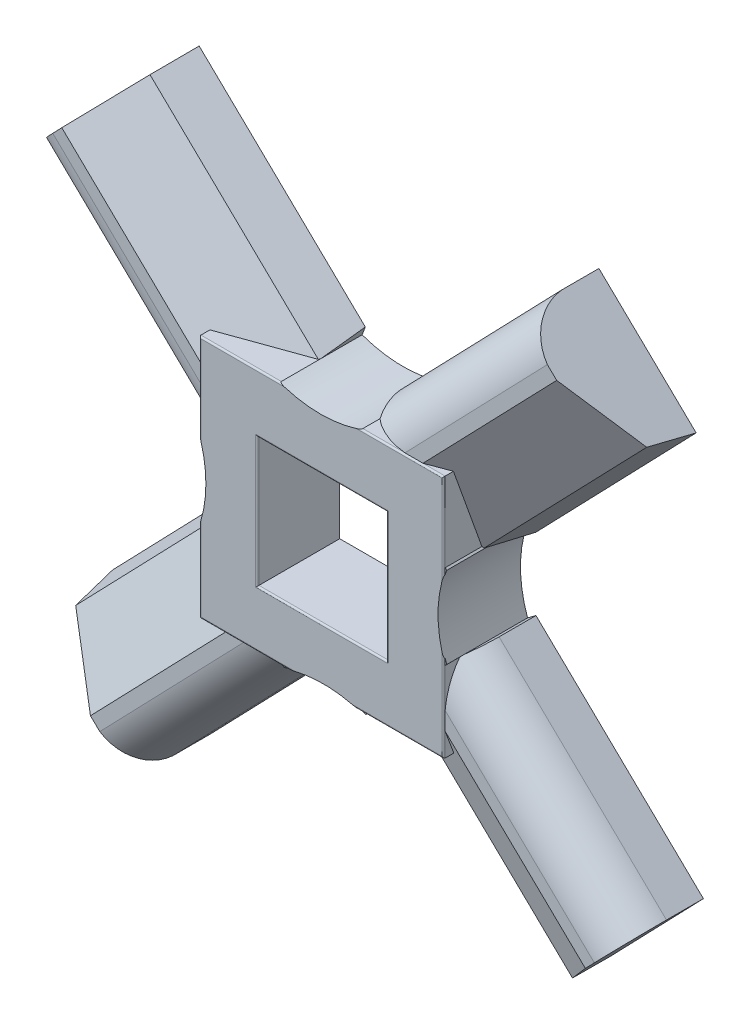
ISO-10303-21;
HEADER;
FILE_DESCRIPTION(('STEP AP214'),'2;1');
FILE_NAME('part.step','',(''),(''),'','','');
FILE_SCHEMA(('AUTOMOTIVE_DESIGN { 1 0 10303 214 1 1 1 1 }'));
ENDSEC;
DATA;
#1=APPLICATION_CONTEXT('core data for automotive mechanical design processes');
#2=APPLICATION_PROTOCOL_DEFINITION('international standard','automotive_design',2000,#1);
#3=PRODUCT_CONTEXT('',#1,'mechanical');
#4=PRODUCT('Part','Part','',(#3));
#5=PRODUCT_RELATED_PRODUCT_CATEGORY('part','',(#4));
#6=PRODUCT_DEFINITION_FORMATION('','',#4);
#7=PRODUCT_DEFINITION_CONTEXT('part definition',#1,'design');
#8=PRODUCT_DEFINITION('design','',#6,#7);
#9=PRODUCT_DEFINITION_SHAPE('','',#8);
#10=(LENGTH_UNIT() NAMED_UNIT(*) SI_UNIT(.MILLI.,.METRE.));
#11=(NAMED_UNIT(*) PLANE_ANGLE_UNIT() SI_UNIT($,.RADIAN.));
#12=(NAMED_UNIT(*) SI_UNIT($,.STERADIAN.) SOLID_ANGLE_UNIT());
#13=UNCERTAINTY_MEASURE_WITH_UNIT(LENGTH_MEASURE(1.E-05),#10,'distance_accuracy_value','');
#14=(GEOMETRIC_REPRESENTATION_CONTEXT(3) GLOBAL_UNCERTAINTY_ASSIGNED_CONTEXT((#13)) GLOBAL_UNIT_ASSIGNED_CONTEXT((#10,
#11,#12)) REPRESENTATION_CONTEXT('',''));
#15=CARTESIAN_POINT('',(0.,0.,0.));
#16=DIRECTION('',(0.,0.,1.));
#17=DIRECTION('',(1.,0.,0.));
#18=AXIS2_PLACEMENT_3D('',#15,#16,#17);
#19=CARTESIAN_POINT('',(-7.48670446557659,0.,4.99999999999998));
#20=DIRECTION('',(0.,-1.,0.));
#21=DIRECTION('',(0.,0.,-1.));
#22=AXIS2_PLACEMENT_3D('',#19,#20,#21);
#23=CYLINDRICAL_SURFACE('',#22,0.1);
#24=CARTESIAN_POINT('',(-7.48670446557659,2.02546926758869,4.90000000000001));
#25=CARTESIAN_POINT('',(-7.47724083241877,1.99333999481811,4.89999803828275));
#26=CARTESIAN_POINT('',(-7.46799222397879,1.96114530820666,4.90132528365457));
#27=CARTESIAN_POINT('',(-7.44998815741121,1.89685565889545,4.90650897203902));
#28=CARTESIAN_POINT('',(-7.44123205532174,1.86476062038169,4.9103620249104));
#29=CARTESIAN_POINT('',(-7.42851531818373,1.81691221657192,4.91852137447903));
#30=CARTESIAN_POINT('',(-7.42434544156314,1.80100965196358,4.92163836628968));
#31=CARTESIAN_POINT('',(-7.41617311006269,1.76942386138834,4.92889543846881));
#32=CARTESIAN_POINT('',(-7.41217026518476,1.75374018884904,4.93303295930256));
#33=CARTESIAN_POINT('',(-7.40660165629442,1.73163040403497,4.94007822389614));
#34=CARTESIAN_POINT('',(-7.40494701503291,1.72502203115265,4.94234309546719));
#35=CARTESIAN_POINT('',(-7.40168120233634,1.71190426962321,4.94727486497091));
#36=CARTESIAN_POINT('',(-7.40007025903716,1.70539545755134,4.94994351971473));
#37=CARTESIAN_POINT('',(-7.39690705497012,1.69254351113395,4.95586579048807));
#38=CARTESIAN_POINT('',(-7.39535568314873,1.68620314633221,4.95912578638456));
#39=CARTESIAN_POINT('',(-7.39238932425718,1.6740136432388,4.9665176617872));
#40=CARTESIAN_POINT('',(-7.39097329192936,1.66816079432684,4.97064191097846));
#41=CARTESIAN_POINT('',(-7.38935939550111,1.66146128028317,4.97706219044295));
#42=CARTESIAN_POINT('',(-7.38900087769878,1.65997070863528,4.97862635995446));
#43=CARTESIAN_POINT('',(-7.38833418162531,1.65719560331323,4.9819396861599));
#44=CARTESIAN_POINT('',(-7.38802593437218,1.65591078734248,4.98368858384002));
#45=CARTESIAN_POINT('',(-7.38755960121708,1.65396525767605,4.98688050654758));
#46=CARTESIAN_POINT('',(-7.38738354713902,1.6532301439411,4.98827488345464));
#47=CARTESIAN_POINT('',(-7.38708489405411,1.65198252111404,4.99116589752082));
#48=CARTESIAN_POINT('',(-7.38696220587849,1.65146964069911,4.99266235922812));
#49=CARTESIAN_POINT('',(-7.38679763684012,1.65078152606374,4.99549291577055));
#50=CARTESIAN_POINT('',(-7.3867462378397,1.65056652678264,4.99681663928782));
#51=CARTESIAN_POINT('',(-7.38669694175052,1.6503603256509,4.99948225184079));
#52=CARTESIAN_POINT('',(-7.38669901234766,1.65036898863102,5.00082412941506));
#53=CARTESIAN_POINT('',(-7.38675632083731,1.65060870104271,5.00348384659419));
#54=CARTESIAN_POINT('',(-7.386811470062,1.65083937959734,5.00480172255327));
#55=CARTESIAN_POINT('',(-7.38696903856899,1.65149819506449,5.00738404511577));
#56=CARTESIAN_POINT('',(-7.38707150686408,1.65192653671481,5.00864843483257));
#57=CARTESIAN_POINT('',(-7.38737588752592,1.65319821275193,5.01171537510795));
#58=CARTESIAN_POINT('',(-7.38760191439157,1.65414200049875,5.01347349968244));
#59=CARTESIAN_POINT('',(-7.38811453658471,1.65628011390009,5.01681978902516));
#60=CARTESIAN_POINT('',(-7.38840130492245,1.65747515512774,5.01840744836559));
#61=CARTESIAN_POINT('',(-7.38928870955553,1.66116848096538,5.02277567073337));
#62=CARTESIAN_POINT('',(-7.38994171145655,1.66388078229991,5.02536176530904));
#63=CARTESIAN_POINT('',(-7.39132409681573,1.66960671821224,5.03014517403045));
#64=CARTESIAN_POINT('',(-7.39205371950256,1.67262129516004,5.03234120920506));
#65=CARTESIAN_POINT('',(-7.39407137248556,1.68093337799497,5.03785199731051));
#66=CARTESIAN_POINT('',(-7.3954015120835,1.68638837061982,5.04091104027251));
#67=CARTESIAN_POINT('',(-7.39813402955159,1.69753730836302,5.04652786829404));
#68=CARTESIAN_POINT('',(-7.39953658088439,1.70323182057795,5.04908437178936));
#69=CARTESIAN_POINT('',(-7.40382837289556,1.7205665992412,5.05624001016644));
#70=CARTESIAN_POINT('',(-7.40679002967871,1.73240971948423,5.06029802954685));
#71=CARTESIAN_POINT('',(-7.41573909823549,1.76781681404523,5.07106518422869));
#72=CARTESIAN_POINT('',(-7.4218940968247,1.79168640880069,5.07656470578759));
#73=CARTESIAN_POINT('',(-7.43454083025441,1.83973244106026,5.08566066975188));
#74=CARTESIAN_POINT('',(-7.44103338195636,1.86390950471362,5.0892522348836));
#75=CARTESIAN_POINT('',(-7.45430820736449,1.91236437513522,5.09488220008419));
#76=CARTESIAN_POINT('',(-7.46109048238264,1.93664218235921,5.09692059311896));
#77=CARTESIAN_POINT('',(-7.47491228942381,1.98516853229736,5.09955021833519));
#78=CARTESIAN_POINT('',(-7.48195148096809,2.00941707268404,5.10014329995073));
#79=CARTESIAN_POINT('',(-7.49680133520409,2.05962236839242,5.09978600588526));
#80=CARTESIAN_POINT('',(-7.50463056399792,2.08557291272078,5.09871831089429));
#81=CARTESIAN_POINT('',(-7.52049153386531,2.13713361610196,5.09448039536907));
#82=CARTESIAN_POINT('',(-7.52852213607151,2.16274480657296,5.09132018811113));
#83=CARTESIAN_POINT('',(-7.54027678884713,2.19954992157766,5.08454286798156));
#84=CARTESIAN_POINT('',(-7.54395739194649,2.21097821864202,5.08211801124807));
#85=CARTESIAN_POINT('',(-7.55134195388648,2.23372193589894,5.07644658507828));
#86=CARTESIAN_POINT('',(-7.55504590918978,2.24503614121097,5.07319478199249));
#87=CARTESIAN_POINT('',(-7.56244337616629,2.26745721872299,5.06551663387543));
#88=CARTESIAN_POINT('',(-7.56613590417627,2.2785584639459,5.06107345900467));
#89=CARTESIAN_POINT('',(-7.57330763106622,2.29995682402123,5.05042747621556));
#90=CARTESIAN_POINT('',(-7.57678887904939,2.31026208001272,5.04424673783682));
#91=CARTESIAN_POINT('',(-7.5806389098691,2.32159235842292,5.03435962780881));
#92=CARTESIAN_POINT('',(-7.58139669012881,2.32381847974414,5.03223254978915));
#93=CARTESIAN_POINT('',(-7.58282226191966,2.32800068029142,5.02769687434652));
#94=CARTESIAN_POINT('',(-7.58349014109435,2.32995702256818,5.0252885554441));
#95=CARTESIAN_POINT('',(-7.58452908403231,2.3329969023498,5.02083450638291));
#96=CARTESIAN_POINT('',(-7.58493193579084,2.33417444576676,5.0188612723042));
#97=CARTESIAN_POINT('',(-7.58563355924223,2.3362240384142,5.01474362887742));
#98=CARTESIAN_POINT('',(-7.5859325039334,2.33709659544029,5.01259951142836));
#99=CARTESIAN_POINT('',(-7.58635119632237,2.33831824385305,5.00859015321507));
#100=CARTESIAN_POINT('',(-7.58649405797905,2.33873488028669,5.00674819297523));
#101=CARTESIAN_POINT('',(-7.58667635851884,2.33926649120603,5.00301648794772));
#102=CARTESIAN_POINT('',(-7.58671589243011,2.3393817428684,5.00112678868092));
#103=CARTESIAN_POINT('',(-7.58668726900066,2.33929828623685,4.99735404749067));
#104=CARTESIAN_POINT('',(-7.58661903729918,2.33909936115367,4.99547101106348));
#105=CARTESIAN_POINT('',(-7.58638223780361,2.33840874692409,4.99176590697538));
#106=CARTESIAN_POINT('',(-7.58621357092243,2.33791676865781,4.98994390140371));
#107=CARTESIAN_POINT('',(-7.58572012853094,2.33647670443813,4.98580166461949));
#108=CARTESIAN_POINT('',(-7.58536194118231,2.3354309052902,4.98351974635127));
#109=CARTESIAN_POINT('',(-7.58453412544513,2.33301159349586,4.97915994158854));
#110=CARTESIAN_POINT('',(-7.58406424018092,2.33163732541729,4.97708254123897));
#111=CARTESIAN_POINT('',(-7.58268782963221,2.32760712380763,4.97172593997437));
#112=CARTESIAN_POINT('',(-7.58170721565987,2.32473123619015,4.96863350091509));
#113=CARTESIAN_POINT('',(-7.57962061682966,2.31859778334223,4.96290858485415));
#114=CARTESIAN_POINT('',(-7.57851427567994,2.31533913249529,4.96027747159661));
#115=CARTESIAN_POINT('',(-7.57420121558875,2.30260332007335,4.95098741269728));
#116=CARTESIAN_POINT('',(-7.57075952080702,2.29237713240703,4.94549059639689));
#117=CARTESIAN_POINT('',(-7.56372663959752,2.27131919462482,4.93595938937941));
#118=CARTESIAN_POINT('',(-7.56013462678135,2.26048393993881,4.93193473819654));
#119=CARTESIAN_POINT('',(-7.55062709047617,2.23157620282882,4.92265145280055));
#120=CARTESIAN_POINT('',(-7.54467522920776,2.21325003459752,4.91821593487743));
#121=CARTESIAN_POINT('',(-7.53281887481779,2.17624839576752,4.91100271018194));
#122=CARTESIAN_POINT('',(-7.52691453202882,2.15757218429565,4.90822905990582));
#123=CARTESIAN_POINT('',(-7.51521309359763,2.12004373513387,4.9039472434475));
#124=CARTESIAN_POINT('',(-7.5094159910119,2.1011915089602,4.90243899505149));
#125=CARTESIAN_POINT('',(-7.49795572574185,2.063390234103,4.900465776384));
#126=CARTESIAN_POINT('',(-7.49229260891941,2.04444115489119,4.90000115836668));
#127=CARTESIAN_POINT('',(-7.48670446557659,2.02546926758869,4.90000000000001));
#128=B_SPLINE_CURVE_WITH_KNOTS('',3,(#24,#25,#26,#27,#28,#29,#30,#31,#32,#33,#34,#35,#36,#37,
#38,#39,#40,#41,#42,#43,#44,#45,#46,#47,#48,#49,#50,#51,#52,#53,#54,#55,#56,#57,#58,#59,#60,#61,
#62,#63,#64,#65,#66,#67,#68,#69,#70,#71,#72,#73,#74,#75,#76,#77,#78,#79,#80,#81,#82,#83,#84,#85,
#86,#87,#88,#89,#90,#91,#92,#93,#94,#95,#96,#97,#98,#99,#100,#101,#102,#103,#104,#105,#106,#107,
#108,#109,#110,#111,#112,#113,#114,#115,#116,#117,#118,#119,#120,#121,#122,#123,#124,#125,#126,
#127),.UNSPECIFIED.,.T.,.F.,(4,2,2,2,2,2,2,2,2,2,2,2,2,2,2,2,2,2,2,2,2,2,2,2,2,2,2,2,2,2,2,2,2,
2,2,2,2,2,2,2,2,2,2,2,2,2,2,2,2,2,2,4),(0.,0.100469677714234,0.200804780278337,
0.250985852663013,0.301042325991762,0.322572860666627,0.344199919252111,0.366075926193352,
0.387766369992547,0.394324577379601,0.400873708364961,0.405616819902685,0.410351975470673,
0.414359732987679,0.418365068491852,0.42236372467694,0.426366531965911,0.432356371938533,
0.438363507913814,0.449711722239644,0.461096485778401,0.480228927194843,0.499409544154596,
0.537939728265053,0.613569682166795,0.689392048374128,0.765214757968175,0.840940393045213,
0.922263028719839,1.00319929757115,1.03993033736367,1.07689989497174,1.11442205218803,
1.15148763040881,1.16098214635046,1.17046733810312,1.17744458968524,1.18441016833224,
1.19006717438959,1.195718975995,1.20137467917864,1.20703597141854,1.21459961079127,
1.22218081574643,1.23511339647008,1.24808358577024,1.28412917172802,1.32040908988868,
1.3795750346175,1.43888481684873,1.49819074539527,1.55751668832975),.UNSPECIFIED.);
#129=CARTESIAN_POINT('',(-7.48670446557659,2.02546926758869,5.1));
#130=VERTEX_POINT('',#129);
#131=CARTESIAN_POINT('',(-7.58670446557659,2.33934842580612,5.));
#132=VERTEX_POINT('',#131);
#133=EDGE_CURVE('E11',#130,#132,#128,.T.);
#134=ORIENTED_EDGE('',*,*,#133,.F.);
#135=DIRECTION('',(0.,-1.,0.));
#136=VECTOR('',#135,1.);
#137=CARTESIAN_POINT('',(-7.48670446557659,0.,5.10000000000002));
#138=LINE('',#137,#136);
#139=CARTESIAN_POINT('',(-7.48670446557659,7.51871587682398,5.10000000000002));
#140=VERTEX_POINT('',#139);
#141=EDGE_CURVE('E703',#140,#130,#138,.T.);
#142=ORIENTED_EDGE('',*,*,#141,.F.);
#143=CARTESIAN_POINT('',(-7.48670446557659,7.51871587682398,4.99999999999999));
#144=DIRECTION('',(-0.707106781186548,-0.707106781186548,0.));
#145=DIRECTION('',(-0.707106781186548,0.707106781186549,0.));
#146=AXIS2_PLACEMENT_3D('',#143,#144,#145);
#147=ELLIPSE('',#146,0.14142135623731,0.1);
#148=CARTESIAN_POINT('',(-7.58670446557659,7.61871587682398,4.99999999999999));
#149=VERTEX_POINT('',#148);
#150=EDGE_CURVE('E1035',#140,#149,#147,.T.);
#151=ORIENTED_EDGE('',*,*,#150,.T.);
#152=DIRECTION('',(0.,-1.,0.));
#153=VECTOR('',#152,1.);
#154=CARTESIAN_POINT('',(-7.58670446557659,7.61871587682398,4.99999999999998));
#155=LINE('',#154,#153);
#156=CARTESIAN_POINT('',(-7.58670446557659,6.11900772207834,5.));
#157=VERTEX_POINT('',#156);
#158=EDGE_CURVE('E705',#157,#149,#155,.F.);
#159=ORIENTED_EDGE('',*,*,#158,.F.);
#160=DIRECTION('',(0.,1.,0.));
#161=VECTOR('',#160,1.);
#162=CARTESIAN_POINT('',(-7.58670446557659,-7.50000000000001,5.));
#163=LINE('',#162,#161);
#164=CARTESIAN_POINT('',(-7.58670446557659,5.00351389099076,5.));
#165=VERTEX_POINT('',#164);
#166=EDGE_CURVE('E1165',#165,#157,#163,.T.);
#167=ORIENTED_EDGE('',*,*,#166,.F.);
#168=DIRECTION('',(0.,-1.,0.));
#169=VECTOR('',#168,1.);
#170=CARTESIAN_POINT('',(-7.58670446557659,7.61871587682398,4.99999999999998));
#171=LINE('',#170,#169);
#172=CARTESIAN_POINT('',(-7.58670446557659,2.46394569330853,5.));
#173=VERTEX_POINT('',#172);
#174=EDGE_CURVE('E437',#173,#165,#171,.F.);
#175=ORIENTED_EDGE('',*,*,#174,.F.);
#176=DIRECTION('',(0.,1.,0.));
#177=VECTOR('',#176,1.);
#178=CARTESIAN_POINT('',(-7.58670446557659,-7.50000000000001,5.));
#179=LINE('',#178,#177);
#180=EDGE_CURVE('E429',#132,#173,#179,.T.);
#181=ORIENTED_EDGE('',*,*,#180,.F.);
#182=EDGE_LOOP('',(#134,#142,#151,#159,#167,#175,#181));
#183=FACE_BOUND('',#182,.T.);
#184=ADVANCED_FACE('F29',(#183),#23,.T.);
#185=CARTESIAN_POINT('',(7.42268164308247,0.,4.99999999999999));
#186=DIRECTION('',(0.,1.,0.));
#187=DIRECTION('',(0.,0.,1.));
#188=AXIS2_PLACEMENT_3D('',#185,#186,#187);
#189=CYLINDRICAL_SURFACE('',#188,0.1);
#190=CARTESIAN_POINT('',(7.42268164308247,-1.79455404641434,5.1));
#191=CARTESIAN_POINT('',(7.43110615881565,-1.82694111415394,5.10000375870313));
#192=CARTESIAN_POINT('',(7.43975087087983,-1.85928293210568,5.09895965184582));
#193=CARTESIAN_POINT('',(7.45300523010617,-1.90757643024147,5.09539957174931));
#194=CARTESIAN_POINT('',(7.45747282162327,-1.92364322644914,5.0938796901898));
#195=CARTESIAN_POINT('',(7.46648874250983,-1.95565455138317,5.09002874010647));
#196=CARTESIAN_POINT('',(7.47103703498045,-1.97159913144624,5.08769803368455));
#197=CARTESIAN_POINT('',(7.48019381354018,-2.00330404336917,5.08198419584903));
#198=CARTESIAN_POINT('',(7.48480237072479,-2.0190641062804,5.07859968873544));
#199=CARTESIAN_POINT('',(7.49402384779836,-2.05022296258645,5.07035548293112));
#200=CARTESIAN_POINT('',(7.49863675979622,-2.06562207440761,5.06549714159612));
#201=CARTESIAN_POINT('',(7.50542256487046,-2.0880254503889,5.05628538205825));
#202=CARTESIAN_POINT('',(7.50766783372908,-2.09539539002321,5.05288284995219));
#203=CARTESIAN_POINT('',(7.51204562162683,-2.10968931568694,5.04510703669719));
#204=CARTESIAN_POINT('',(7.51417819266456,-2.11661350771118,5.04073420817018));
#205=CARTESIAN_POINT('',(7.51713680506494,-2.12617689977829,5.03295262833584));
#206=CARTESIAN_POINT('',(7.51808863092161,-2.129245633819,5.03013146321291));
#207=CARTESIAN_POINT('',(7.51982390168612,-2.13482934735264,5.02394985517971));
#208=CARTESIAN_POINT('',(7.52060882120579,-2.13734918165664,5.02059463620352));
#209=CARTESIAN_POINT('',(7.52151414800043,-2.14025194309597,5.01532241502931));
#210=CARTESIAN_POINT('',(7.52176044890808,-2.14104105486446,5.01365309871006));
#211=CARTESIAN_POINT('',(7.52217455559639,-2.14236725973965,5.01020633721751));
#212=CARTESIAN_POINT('',(7.52234240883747,-2.14290450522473,5.00842895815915));
#213=CARTESIAN_POINT('',(7.52258384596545,-2.14367713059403,5.00478548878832));
#214=CARTESIAN_POINT('',(7.52265660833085,-2.14390987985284,5.00291876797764));
#215=CARTESIAN_POINT('',(7.52269573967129,-2.14403506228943,4.9991729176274));
#216=CARTESIAN_POINT('',(7.52266214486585,-2.14392761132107,4.99729379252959));
#217=CARTESIAN_POINT('',(7.52250102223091,-2.14341209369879,4.99376001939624));
#218=CARTESIAN_POINT('',(7.5223824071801,-2.14303255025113,4.99210060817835));
#219=CARTESIAN_POINT('',(7.5220726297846,-2.14204086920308,4.98886062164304));
#220=CARTESIAN_POINT('',(7.52188141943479,-2.14142857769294,4.9872800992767));
#221=CARTESIAN_POINT('',(7.52131392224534,-2.13961023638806,4.98333846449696));
#222=CARTESIAN_POINT('',(7.52089434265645,-2.13826492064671,4.98104828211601));
#223=CARTESIAN_POINT('',(7.51995716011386,-2.1352562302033,4.97671006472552));
#224=CARTESIAN_POINT('',(7.51943925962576,-2.13359188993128,4.97466279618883));
#225=CARTESIAN_POINT('',(7.51785821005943,-2.12850370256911,4.96908343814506));
#226=CARTESIAN_POINT('',(7.51671449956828,-2.12481459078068,4.96581964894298));
#227=CARTESIAN_POINT('',(7.51431729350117,-2.11705846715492,4.95983517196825));
#228=CARTESIAN_POINT('',(7.51306347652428,-2.11299034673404,4.9571161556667));
#229=CARTESIAN_POINT('',(7.50976332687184,-2.10224802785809,4.9506373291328));
#230=CARTESIAN_POINT('',(7.50767339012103,-2.09541253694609,4.94717014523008));
#231=CARTESIAN_POINT('',(7.50343039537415,-2.08146042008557,4.94089198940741));
#232=CARTESIAN_POINT('',(7.50127720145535,-2.07434317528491,4.93808256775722));
#233=CARTESIAN_POINT('',(7.49476246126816,-2.05268957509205,4.93035518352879));
#234=CARTESIAN_POINT('',(7.49036303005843,-2.03790747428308,4.9261669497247));
#235=CARTESIAN_POINT('',(7.47823079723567,-1.99666611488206,4.91624789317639));
#236=CARTESIAN_POINT('',(7.47052001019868,-1.96991626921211,4.91178430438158));
#237=CARTESIAN_POINT('',(7.45531799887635,-1.91603807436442,4.90512060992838));
#238=CARTESIAN_POINT('',(7.44782736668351,-1.88890895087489,4.90292614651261));
#239=CARTESIAN_POINT('',(7.43313011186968,-1.83448162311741,4.90026670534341));
#240=CARTESIAN_POINT('',(7.42592360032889,-1.80718335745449,4.89980239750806));
#241=CARTESIAN_POINT('',(7.41182280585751,-1.75251989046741,4.90034269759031));
#242=CARTESIAN_POINT('',(7.40492860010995,-1.72515467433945,4.901347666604));
#243=CARTESIAN_POINT('',(7.38957978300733,-1.66274649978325,4.90521507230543));
#244=CARTESIAN_POINT('',(7.38122973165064,-1.62770242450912,4.90851935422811));
#245=CARTESIAN_POINT('',(7.36915601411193,-1.57537322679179,4.91540726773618));
#246=CARTESIAN_POINT('',(7.36521459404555,-1.55800642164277,4.91801754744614));
#247=CARTESIAN_POINT('',(7.35748404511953,-1.52337569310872,4.9240160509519));
#248=CARTESIAN_POINT('',(7.35369484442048,-1.50611172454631,4.92740390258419));
#249=CARTESIAN_POINT('',(7.34785223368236,-1.47904076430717,4.93359134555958));
#250=CARTESIAN_POINT('',(7.34574164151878,-1.46916392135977,4.9360350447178));
#251=CARTESIAN_POINT('',(7.34157489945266,-1.449471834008,4.94140383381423));
#252=CARTESIAN_POINT('',(7.33951903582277,-1.43965706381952,4.94433103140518));
#253=CARTESIAN_POINT('',(7.33547731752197,-1.42017184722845,4.95090683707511));
#254=CARTESIAN_POINT('',(7.33349224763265,-1.41050345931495,4.95456162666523));
#255=CARTESIAN_POINT('',(7.32965081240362,-1.39160652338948,4.9630019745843));
#256=CARTESIAN_POINT('',(7.3277936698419,-1.38237545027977,4.96777974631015));
#257=CARTESIAN_POINT('',(7.32568382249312,-1.37180021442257,4.97562495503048));
#258=CARTESIAN_POINT('',(7.32524392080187,-1.36958941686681,4.97742173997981));
#259=CARTESIAN_POINT('',(7.3244213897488,-1.36544693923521,4.98131930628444));
#260=CARTESIAN_POINT('',(7.32403843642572,-1.36351368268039,4.98341822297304));
#261=CARTESIAN_POINT('',(7.32355445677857,-1.36106645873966,4.98677419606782));
#262=CARTESIAN_POINT('',(7.32341272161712,-1.36034911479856,4.98787530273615));
#263=CARTESIAN_POINT('',(7.32315942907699,-1.35906637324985,4.9901682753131));
#264=CARTESIAN_POINT('',(7.32304787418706,-1.35850098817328,4.99136014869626));
#265=CARTESIAN_POINT('',(7.32286358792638,-1.35756660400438,4.99384221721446));
#266=CARTESIAN_POINT('',(7.32279139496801,-1.35720032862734,4.99513351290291));
#267=CARTESIAN_POINT('',(7.32269804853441,-1.35672667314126,4.99776387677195));
#268=CARTESIAN_POINT('',(7.32267678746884,-1.35661874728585,4.99910283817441));
#269=CARTESIAN_POINT('',(7.32268765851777,-1.3566739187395,5.00159897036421));
#270=CARTESIAN_POINT('',(7.32271318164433,-1.35680346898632,5.00275705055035));
#271=CARTESIAN_POINT('',(7.32280191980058,-1.3572537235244,5.00503416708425));
#272=CARTESIAN_POINT('',(7.32286518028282,-1.35757465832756,5.00615315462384));
#273=CARTESIAN_POINT('',(7.32305083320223,-1.35851601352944,5.00871067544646));
#274=CARTESIAN_POINT('',(7.32318617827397,-1.35920196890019,5.01012379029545));
#275=CARTESIAN_POINT('',(7.32349793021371,-1.36078044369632,5.01282363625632));
#276=CARTESIAN_POINT('',(7.32367443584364,-1.36167345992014,5.01411005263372));
#277=CARTESIAN_POINT('',(7.3242148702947,-1.36440459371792,5.01759402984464));
#278=CARTESIAN_POINT('',(7.32461212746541,-1.3664086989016,5.01965425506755));
#279=CARTESIAN_POINT('',(7.325458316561,-1.37066720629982,5.02348163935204));
#280=CARTESIAN_POINT('',(7.32590741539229,-1.37292241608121,5.02524780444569));
#281=CARTESIAN_POINT('',(7.32791505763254,-1.38297721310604,5.03245526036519));
#282=CARTESIAN_POINT('',(7.32962122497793,-1.39145558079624,5.03687464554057));
#283=CARTESIAN_POINT('',(7.33314974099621,-1.408823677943,5.04473432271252));
#284=CARTESIAN_POINT('',(7.33497282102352,-1.41771587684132,5.04816752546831));
#285=CARTESIAN_POINT('',(7.33893489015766,-1.43685978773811,5.05480463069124));
#286=CARTESIAN_POINT('',(7.34108448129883,-1.44714004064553,5.05792319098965));
#287=CARTESIAN_POINT('',(7.34545738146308,-1.46783232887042,5.06363237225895));
#288=CARTESIAN_POINT('',(7.34768075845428,-1.47824447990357,5.0662224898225));
#289=CARTESIAN_POINT('',(7.35445531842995,-1.50963876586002,5.07341055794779));
#290=CARTESIAN_POINT('',(7.35910234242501,-1.53073717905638,5.07741337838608));
#291=CARTESIAN_POINT('',(7.36861127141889,-1.57302974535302,5.0843226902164));
#292=CARTESIAN_POINT('',(7.37347294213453,-1.59422377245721,5.08723034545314));
#293=CARTESIAN_POINT('',(7.38339885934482,-1.63664262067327,5.09212755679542));
#294=CARTESIAN_POINT('',(7.38846285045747,-1.65786737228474,5.09411823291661));
#295=CARTESIAN_POINT('',(7.39831012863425,-1.69835361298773,5.09710790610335));
#296=CARTESIAN_POINT('',(7.40307566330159,-1.7176139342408,5.09818196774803));
#297=CARTESIAN_POINT('',(7.41276224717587,-1.75610615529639,5.09962665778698));
#298=CARTESIAN_POINT('',(7.41768318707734,-1.77533806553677,5.0999977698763));
#299=CARTESIAN_POINT('',(7.42268164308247,-1.79455404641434,5.1));
#300=B_SPLINE_CURVE_WITH_KNOTS('',3,(#190,#191,#192,#193,#194,#195,#196,#197,#198,#199,#200,
#201,#202,#203,#204,#205,#206,#207,#208,#209,#210,#211,#212,#213,#214,#215,#216,#217,#218,#219,
#220,#221,#222,#223,#224,#225,#226,#227,#228,#229,#230,#231,#232,#233,#234,#235,#236,#237,#238,
#239,#240,#241,#242,#243,#244,#245,#246,#247,#248,#249,#250,#251,#252,#253,#254,#255,#256,#257,
#258,#259,#260,#261,#262,#263,#264,#265,#266,#267,#268,#269,#270,#271,#272,#273,#274,#275,#276,
#277,#278,#279,#280,#281,#282,#283,#284,#285,#286,#287,#288,#289,#290,#291,#292,#293,#294,#295,
#296,#297,#298,#299),.UNSPECIFIED.,.T.,.F.,(4,2,2,2,2,2,2,2,2,2,2,2,2,2,2,2,2,2,2,2,2,2,2,2,2,2,
2,2,2,2,2,2,2,2,2,2,2,2,2,2,2,2,2,2,2,2,2,2,2,2,2,2,2,2,4),(0.,0.100377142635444,
0.150600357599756,0.200801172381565,0.251067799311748,0.301288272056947,0.326528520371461,
0.35175701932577,0.364547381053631,0.377219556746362,0.382790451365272,0.388357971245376,
0.393973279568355,0.399586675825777,0.404684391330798,0.409785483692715,0.417805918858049,
0.425851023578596,0.44093589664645,0.456066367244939,0.479839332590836,0.503667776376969,
0.551519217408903,0.635940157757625,0.720570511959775,0.805233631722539,0.889917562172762,
0.998348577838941,1.05233438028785,1.10629439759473,1.13746391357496,1.16877307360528,
1.20036054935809,1.23173514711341,1.24036720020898,1.24894809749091,1.25290429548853,
1.25686081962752,1.26087018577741,1.26487107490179,1.26834957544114,1.27183227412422,
1.27653529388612,1.28124971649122,1.28990532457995,1.2985896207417,1.32750187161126,
1.35661703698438,1.38945216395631,1.42231842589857,1.48818359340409,1.5539785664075,
1.61969296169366,1.67929001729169,1.73884604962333),.UNSPECIFIED.);
#301=CARTESIAN_POINT('',(7.42268164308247,-1.79455404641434,5.1));
#302=VERTEX_POINT('',#301);
#303=CARTESIAN_POINT('',(7.52268164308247,-2.14398996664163,5.));
#304=VERTEX_POINT('',#303);
#305=EDGE_CURVE('E783',#302,#304,#300,.T.);
#306=ORIENTED_EDGE('',*,*,#305,.F.);
#307=DIRECTION('',(0.,1.,0.));
#308=VECTOR('',#307,1.);
#309=CARTESIAN_POINT('',(7.42268164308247,0.,5.1));
#310=LINE('',#309,#308);
#311=CARTESIAN_POINT('',(7.42268164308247,-7.39067023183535,5.1));
#312=VERTEX_POINT('',#311);
#313=EDGE_CURVE('E695',#312,#302,#310,.T.);
#314=ORIENTED_EDGE('',*,*,#313,.F.);
#315=CARTESIAN_POINT('',(7.42268164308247,-7.39067023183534,4.99999999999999));
#316=DIRECTION('',(0.707106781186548,0.707106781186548,0.));
#317=DIRECTION('',(0.707106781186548,-0.707106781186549,0.));
#318=AXIS2_PLACEMENT_3D('',#315,#316,#317);
#319=ELLIPSE('',#318,0.14142135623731,0.1);
#320=CARTESIAN_POINT('',(7.52268164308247,-7.49067023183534,4.99999999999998));
#321=VERTEX_POINT('',#320);
#322=EDGE_CURVE('E433',#312,#321,#319,.T.);
#323=ORIENTED_EDGE('',*,*,#322,.T.);
#324=DIRECTION('',(0.,1.,0.));
#325=VECTOR('',#324,1.);
#326=CARTESIAN_POINT('',(7.52268164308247,-7.49067023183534,4.99999999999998));
#327=LINE('',#326,#325);
#328=CARTESIAN_POINT('',(7.52268164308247,-6.05726205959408,5.));
#329=VERTEX_POINT('',#328);
#330=EDGE_CURVE('E718',#329,#321,#327,.F.);
#331=ORIENTED_EDGE('',*,*,#330,.F.);
#332=DIRECTION('',(0.,-1.,0.));
#333=VECTOR('',#332,1.);
#334=CARTESIAN_POINT('',(7.52268164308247,-7.50000000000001,5.00000000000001));
#335=LINE('',#334,#333);
#336=CARTESIAN_POINT('',(7.52268164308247,-4.94176822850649,4.99999999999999));
#337=VERTEX_POINT('',#336);
#338=EDGE_CURVE('E438',#337,#329,#335,.T.);
#339=ORIENTED_EDGE('',*,*,#338,.F.);
#340=DIRECTION('',(0.,1.,0.));
#341=VECTOR('',#340,1.);
#342=CARTESIAN_POINT('',(7.52268164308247,-7.49067023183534,4.99999999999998));
#343=LINE('',#342,#341);
#344=CARTESIAN_POINT('',(7.52268164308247,-2.53032965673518,5.));
#345=VERTEX_POINT('',#344);
#346=EDGE_CURVE('E720',#345,#337,#343,.F.);
#347=ORIENTED_EDGE('',*,*,#346,.F.);
#348=DIRECTION('',(0.,-1.,0.));
#349=VECTOR('',#348,1.);
#350=CARTESIAN_POINT('',(7.52268164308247,-7.50000000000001,5.00000000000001));
#351=LINE('',#350,#349);
#352=EDGE_CURVE('E451',#304,#345,#351,.T.);
#353=ORIENTED_EDGE('',*,*,#352,.F.);
#354=EDGE_LOOP('',(#306,#314,#323,#331,#339,#347,#353));
#355=FACE_BOUND('',#354,.T.);
#356=ADVANCED_FACE('F804',(#355),#189,.T.);
#357=CARTESIAN_POINT('',(-7.58670446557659,7.51871587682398,5.00000000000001));
#358=DIRECTION('',(-1.,0.,0.));
#359=DIRECTION('',(0.,-1.,0.));
#360=AXIS2_PLACEMENT_3D('',#357,#358,#359);
#361=CYLINDRICAL_SURFACE('',#360,0.1);
#362=CARTESIAN_POINT('',(1.77924161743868,7.41871587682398,4.99999999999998));
#363=CARTESIAN_POINT('',(1.77924204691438,7.4187159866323,5.00172884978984));
#364=CARTESIAN_POINT('',(1.77941840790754,7.41876145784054,5.00345988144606));
#365=CARTESIAN_POINT('',(1.78009657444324,7.41893638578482,5.00685347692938));
#366=CARTESIAN_POINT('',(1.78059929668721,7.41906607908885,5.00851583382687));
#367=CARTESIAN_POINT('',(1.7820124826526,7.41943090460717,5.01210214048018));
#368=CARTESIAN_POINT('',(1.78299057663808,7.41968354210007,5.01399703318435));
#369=CARTESIAN_POINT('',(1.78522150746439,7.42026041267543,5.01760311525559));
#370=CARTESIAN_POINT('',(1.78647491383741,7.4205847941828,5.01931391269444));
#371=CARTESIAN_POINT('',(1.79028078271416,7.42157100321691,5.02392112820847));
#372=CARTESIAN_POINT('',(1.79304864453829,7.42228961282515,5.0266244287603));
#373=CARTESIAN_POINT('',(1.79890174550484,7.42381329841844,5.03162738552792));
#374=CARTESIAN_POINT('',(1.80198795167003,7.42461863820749,5.03392575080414));
#375=CARTESIAN_POINT('',(1.81033952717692,7.42680409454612,5.03957819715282));
#376=CARTESIAN_POINT('',(1.8157564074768,7.42822759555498,5.04268898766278));
#377=CARTESIAN_POINT('',(1.82683531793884,7.43115301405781,5.04840321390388));
#378=CARTESIAN_POINT('',(1.83249791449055,7.43265511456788,5.05100539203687));
#379=CARTESIAN_POINT('',(1.84974603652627,7.43725283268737,5.05828541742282));
#380=CARTESIAN_POINT('',(1.86154228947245,7.44042691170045,5.06240808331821));
#381=CARTESIAN_POINT('',(1.89529847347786,7.4496011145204,5.07282855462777));
#382=CARTESIAN_POINT('',(1.9175265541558,7.45574952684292,5.07807119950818));
#383=CARTESIAN_POINT('',(1.96228283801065,7.46835614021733,5.08672318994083));
#384=CARTESIAN_POINT('',(1.98481164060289,7.47481505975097,5.09012803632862));
#385=CARTESIAN_POINT('',(2.02994878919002,7.48798703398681,5.0954263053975));
#386=CARTESIAN_POINT('',(2.05255704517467,7.49469985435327,5.09732108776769));
#387=CARTESIAN_POINT('',(2.09777705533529,7.5083601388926,5.09970323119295));
#388=CARTESIAN_POINT('',(2.12038880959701,7.51530761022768,5.10019054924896));
#389=CARTESIAN_POINT('',(2.167768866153,7.53011104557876,5.09965115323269));
#390=CARTESIAN_POINT('',(2.19252876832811,7.5379888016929,5.0984695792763));
#391=CARTESIAN_POINT('',(2.24172262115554,7.55392220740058,5.09396743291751));
#392=CARTESIAN_POINT('',(2.26615745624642,7.56197706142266,5.09065505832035));
#393=CARTESIAN_POINT('',(2.30028573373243,7.57341900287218,5.08380006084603));
#394=CARTESIAN_POINT('',(2.31024261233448,7.57678082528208,5.08152513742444));
#395=CARTESIAN_POINT('',(2.33002169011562,7.58350478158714,5.0762941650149));
#396=CARTESIAN_POINT('',(2.33984335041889,7.58686688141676,5.07333593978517));
#397=CARTESIAN_POINT('',(2.35927773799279,7.59356354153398,5.06649031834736));
#398=CARTESIAN_POINT('',(2.36888773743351,7.59689756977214,5.06259468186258));
#399=CARTESIAN_POINT('',(2.3875279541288,7.60340563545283,5.05347805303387));
#400=CARTESIAN_POINT('',(2.39656099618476,7.6065804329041,5.04826425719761));
#401=CARTESIAN_POINT('',(2.40783628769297,7.61056443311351,5.03962255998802));
#402=CARTESIAN_POINT('',(2.41073800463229,7.61159195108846,5.03717360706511));
#403=CARTESIAN_POINT('',(2.41621656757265,7.61353537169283,5.03189427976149));
#404=CARTESIAN_POINT('',(2.41879410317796,7.61445151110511,5.02906474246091));
#405=CARTESIAN_POINT('',(2.4225673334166,7.61579455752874,5.02407691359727));
#406=CARTESIAN_POINT('',(2.42392223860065,7.61627734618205,5.02205546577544));
#407=CARTESIAN_POINT('',(2.42633768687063,7.61713866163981,5.01782149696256));
#408=CARTESIAN_POINT('',(2.42739864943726,7.61751733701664,5.01560925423));
#409=CARTESIAN_POINT('',(2.42896416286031,7.61807635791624,5.01144692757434));
#410=CARTESIAN_POINT('',(2.42953580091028,7.61828059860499,5.00952567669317));
#411=CARTESIAN_POINT('',(2.43036723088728,7.61857771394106,5.0056086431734));
#412=CARTESIAN_POINT('',(2.43062737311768,7.6186707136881,5.00361294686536));
#413=CARTESIAN_POINT('',(2.43080796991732,7.61873527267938,4.99959739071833));
#414=CARTESIAN_POINT('',(2.43072734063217,7.61870644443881,4.99757747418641));
#415=CARTESIAN_POINT('',(2.43023345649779,7.61852991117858,4.99358391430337));
#416=CARTESIAN_POINT('',(2.42981992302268,7.61838210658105,4.99161031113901));
#417=CARTESIAN_POINT('',(2.42857914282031,7.61793884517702,4.98733571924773));
#418=CARTESIAN_POINT('',(2.42768086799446,7.61761804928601,4.98505828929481));
#419=CARTESIAN_POINT('',(2.42555190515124,7.61685838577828,4.98068687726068));
#420=CARTESIAN_POINT('',(2.42432055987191,7.61641928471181,4.97859326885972));
#421=CARTESIAN_POINT('',(2.42077106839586,7.61515482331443,4.97333965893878));
#422=CARTESIAN_POINT('',(2.41825495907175,7.61425968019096,4.97033198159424));
#423=CARTESIAN_POINT('',(2.41284176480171,7.61233765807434,4.96473435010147));
#424=CARTESIAN_POINT('',(2.40994361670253,7.61131041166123,4.96214560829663));
#425=CARTESIAN_POINT('',(2.39913681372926,7.6074883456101,4.95344658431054));
#426=CARTESIAN_POINT('',(2.3905730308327,7.60447463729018,4.94826458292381));
#427=CARTESIAN_POINT('',(2.37285532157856,7.5982787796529,4.93917993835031));
#428=CARTESIAN_POINT('',(2.36369813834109,7.5950957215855,4.93528522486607));
#429=CARTESIAN_POINT('',(2.34018391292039,7.58697526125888,4.92656251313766));
#430=CARTESIAN_POINT('',(2.3256241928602,7.58199534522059,4.92232037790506));
#431=CARTESIAN_POINT('',(2.29617391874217,7.57202603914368,4.91517776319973));
#432=CARTESIAN_POINT('',(2.28128269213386,7.56703665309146,4.91228033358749));
#433=CARTESIAN_POINT('',(2.23630992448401,7.55212747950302,4.90509477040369));
#434=CARTESIAN_POINT('',(2.20596468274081,7.54227891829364,4.90232403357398));
#435=CARTESIAN_POINT('',(2.13567181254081,7.51996450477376,4.89919898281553));
#436=CARTESIAN_POINT('',(2.0956463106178,7.50762717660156,4.89985221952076));
#437=CARTESIAN_POINT('',(2.03575034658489,7.4897105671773,4.90410702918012));
#438=CARTESIAN_POINT('',(2.01583651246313,7.48384439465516,4.90606610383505));
#439=CARTESIAN_POINT('',(1.97610963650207,7.47231967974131,4.91118936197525));
#440=CARTESIAN_POINT('',(1.95629655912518,7.46666105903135,4.91435308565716));
#441=CARTESIAN_POINT('',(1.91793349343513,7.45587411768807,4.92194346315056));
#442=CARTESIAN_POINT('',(1.89937290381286,7.45073364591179,4.9262930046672));
#443=CARTESIAN_POINT('',(1.86829324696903,7.44225142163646,4.9353576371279));
#444=CARTESIAN_POINT('',(1.85564347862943,7.43883554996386,4.93956503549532));
#445=CARTESIAN_POINT('',(1.83134765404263,7.43234186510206,4.94926232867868));
#446=CARTESIAN_POINT('',(1.81968197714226,7.42925577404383,4.95468689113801));
#447=CARTESIAN_POINT('',(1.80583627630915,7.42562501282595,4.96342285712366));
#448=CARTESIAN_POINT('',(1.80290640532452,7.42485876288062,4.96541851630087));
#449=CARTESIAN_POINT('',(1.79725717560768,7.42338473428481,4.96971389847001));
#450=CARTESIAN_POINT('',(1.79453767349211,7.42267691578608,4.97201341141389));
#451=CARTESIAN_POINT('',(1.79034798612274,7.42158867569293,4.97614379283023));
#452=CARTESIAN_POINT('',(1.78877247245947,7.42118006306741,4.97785910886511));
#453=CARTESIAN_POINT('',(1.7858589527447,7.42042531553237,4.98149570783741));
#454=CARTESIAN_POINT('',(1.78452052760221,7.42007907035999,4.98341661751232));
#455=CARTESIAN_POINT('',(1.78256623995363,7.41957394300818,4.98685157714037));
#456=CARTESIAN_POINT('',(1.78185501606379,7.41939025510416,4.98830707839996));
#457=CARTESIAN_POINT('',(1.78066246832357,7.41908238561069,4.99131471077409));
#458=CARTESIAN_POINT('',(1.78018056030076,7.41895805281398,4.9928665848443));
#459=CARTESIAN_POINT('',(1.77964297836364,7.41881938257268,4.99536046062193));
#460=CARTESIAN_POINT('',(1.77949319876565,7.41878075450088,4.99628131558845));
#461=CARTESIAN_POINT('',(1.77929239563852,7.41872897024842,4.99813456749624));
#462=CARTESIAN_POINT('',(1.77924138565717,7.41871581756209,4.99906696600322));
#463=CARTESIAN_POINT('',(1.77924161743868,7.41871587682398,4.99999999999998));
#464=B_SPLINE_CURVE_WITH_KNOTS('',3,(#362,#363,#364,#365,#366,#367,#368,#369,#370,#371,#372,
#373,#374,#375,#376,#377,#378,#379,#380,#381,#382,#383,#384,#385,#386,#387,#388,#389,#390,#391,
#392,#393,#394,#395,#396,#397,#398,#399,#400,#401,#402,#403,#404,#405,#406,#407,#408,#409,#410,
#411,#412,#413,#414,#415,#416,#417,#418,#419,#420,#421,#422,#423,#424,#425,#426,#427,#428,#429,
#430,#431,#432,#433,#434,#435,#436,#437,#438,#439,#440,#441,#442,#443,#444,#445,#446,#447,#448,
#449,#450,#451,#452,#453,#454,#455,#456,#457,#458,#459,#460,#461,#462,#463),.UNSPECIFIED.,.T.,
.F.,(4,2,2,2,2,2,2,2,2,2,2,2,2,2,2,2,2,2,2,2,2,2,2,2,2,2,2,2,2,2,2,2,2,2,2,2,2,2,2,2,2,2,2,2,2,
2,2,2,2,2,4),(0.,0.00518169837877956,0.01037801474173,0.0167826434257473,0.0232006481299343,
0.0349402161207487,0.0467165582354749,0.0658874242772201,0.0851051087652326,0.123715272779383,
0.194540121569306,0.265537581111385,0.336471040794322,0.407406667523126,0.485373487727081,
0.563042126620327,0.595285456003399,0.627632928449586,0.660275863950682,0.692744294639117,
0.704523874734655,0.716277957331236,0.723700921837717,0.731113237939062,0.737132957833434,
0.743145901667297,0.749177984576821,0.755215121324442,0.762581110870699,0.769961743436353,
0.781960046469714,0.793992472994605,0.825112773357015,0.856421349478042,0.904190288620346,
0.952067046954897,1.04793638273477,1.17334391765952,1.23587289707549,1.29837803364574,
1.35752002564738,1.39878926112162,1.43822377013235,1.44909227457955,1.45995330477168,
1.46703315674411,1.47410036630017,1.47897605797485,1.48383926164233,1.48663536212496,
1.48943184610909),.UNSPECIFIED.);
#465=CARTESIAN_POINT('',(2.13126380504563,7.51871587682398,5.10000000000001));
#466=VERTEX_POINT('',#465);
#467=CARTESIAN_POINT('',(2.4307537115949,7.61871587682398,4.99999999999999));
#468=VERTEX_POINT('',#467);
#469=EDGE_CURVE('E744',#466,#468,#464,.T.);
#470=ORIENTED_EDGE('',*,*,#469,.F.);
#471=DIRECTION('',(1.,0.,0.));
#472=VECTOR('',#471,1.);
#473=CARTESIAN_POINT('',(-7.58670446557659,7.51871587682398,5.09999999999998));
#474=LINE('',#473,#472);
#475=CARTESIAN_POINT('',(7.42268164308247,7.51871587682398,5.09999999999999));
#476=VERTEX_POINT('',#475);
#477=EDGE_CURVE('E699',#476,#466,#474,.F.);
#478=ORIENTED_EDGE('',*,*,#477,.F.);
#479=CARTESIAN_POINT('',(7.42268164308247,7.51871587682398,5.));
#480=DIRECTION('',(-0.707106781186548,0.707106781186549,0.));
#481=DIRECTION('',(0.707106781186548,0.707106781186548,0.));
#482=AXIS2_PLACEMENT_3D('',#479,#480,#481);
#483=ELLIPSE('',#482,0.14142135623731,0.1);
#484=CARTESIAN_POINT('',(7.52268164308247,7.61871587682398,5.));
#485=VERTEX_POINT('',#484);
#486=EDGE_CURVE('E1032',#476,#485,#483,.T.);
#487=ORIENTED_EDGE('',*,*,#486,.T.);
#488=DIRECTION('',(1.,0.,0.));
#489=VECTOR('',#488,1.);
#490=CARTESIAN_POINT('',(-7.58670446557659,7.61871587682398,4.99999999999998));
#491=LINE('',#490,#489);
#492=CARTESIAN_POINT('',(6.14988055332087,7.61871587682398,5.));
#493=VERTEX_POINT('',#492);
#494=EDGE_CURVE('E711',#493,#485,#491,.T.);
#495=ORIENTED_EDGE('',*,*,#494,.F.);
#496=DIRECTION('',(-1.,0.,0.));
#497=VECTOR('',#496,1.);
#498=CARTESIAN_POINT('',(-7.50000000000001,7.61871587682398,4.99999999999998));
#499=LINE('',#498,#497);
#500=CARTESIAN_POINT('',(5.03438672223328,7.61871587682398,5.));
#501=VERTEX_POINT('',#500);
#502=EDGE_CURVE('E462',#493,#501,#499,.T.);
#503=ORIENTED_EDGE('',*,*,#502,.T.);
#504=DIRECTION('',(1.,0.,0.));
#505=VECTOR('',#504,1.);
#506=CARTESIAN_POINT('',(-7.58670446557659,7.61871587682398,4.99999999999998));
#507=LINE('',#506,#505);
#508=EDGE_CURVE('E713',#468,#501,#507,.T.);
#509=ORIENTED_EDGE('',*,*,#508,.F.);
#510=EDGE_LOOP('',(#470,#478,#487,#495,#503,#509));
#511=FACE_BOUND('',#510,.T.);
#512=ADVANCED_FACE('F1010',(#511),#361,.T.);
#513=CARTESIAN_POINT('',(7.52268164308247,-7.49067023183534,1.1));
#514=DIRECTION('',(0.,1.,0.));
#515=DIRECTION('',(-1.,0.,0.));
#516=AXIS2_PLACEMENT_3D('',#513,#514,#515);
#517=PLANE('',#516);
#518=DIRECTION('',(0.,0.,1.));
#519=VECTOR('',#518,1.);
#520=CARTESIAN_POINT('',(-2.56352163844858,-7.49067023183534,2.10653776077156));
#521=LINE('',#520,#519);
#522=CARTESIAN_POINT('',(-2.56352163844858,-7.49067023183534,4.14631047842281));
#523=VERTEX_POINT('',#522);
#524=CARTESIAN_POINT('',(-2.56352163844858,-7.49067023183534,5.));
#525=VERTEX_POINT('',#524);
#526=EDGE_CURVE('E661',#523,#525,#521,.T.);
#527=ORIENTED_EDGE('',*,*,#526,.T.);
#528=DIRECTION('',(-1.,0.,0.));
#529=VECTOR('',#528,1.);
#530=CARTESIAN_POINT('',(7.52268164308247,-7.49067023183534,4.99999999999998));
#531=LINE('',#530,#529);
#532=CARTESIAN_POINT('',(-4.91089539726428,-7.49067023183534,5.));
#533=VERTEX_POINT('',#532);
#534=EDGE_CURVE('E728',#525,#533,#531,.T.);
#535=ORIENTED_EDGE('',*,*,#534,.T.);
#536=CARTESIAN_POINT('',(-5.46864231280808,-7.49067023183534,2.10653776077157));
#537=DIRECTION('',(0.,1.,0.));
#538=DIRECTION('',(-1.,0.,0.));
#539=AXIS2_PLACEMENT_3D('',#536,#537,#538);
#540=ELLIPSE('',#539,4.05836938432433,2.92118043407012);
#541=EDGE_CURVE('E1138',#533,#523,#540,.T.);
#542=ORIENTED_EDGE('',*,*,#541,.T.);
#543=EDGE_LOOP('',(#527,#535,#542));
#544=FACE_BOUND('',#543,.T.);
#545=ADVANCED_FACE('F865',(#544),#517,.F.);
#546=CARTESIAN_POINT('',(7.52268164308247,-7.49067023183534,1.1));
#547=DIRECTION('',(1.,0.,0.));
#548=DIRECTION('',(0.,0.,-1.));
#549=AXIS2_PLACEMENT_3D('',#546,#547,#548);
#550=PLANE('',#549);
#551=DIRECTION('',(0.,0.,1.));
#552=VECTOR('',#551,1.);
#553=CARTESIAN_POINT('',(7.52268164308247,7.61871587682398,1.09999999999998));
#554=LINE('',#553,#552);
#555=CARTESIAN_POINT('',(7.52268164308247,7.61871587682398,4.48906834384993));
#556=VERTEX_POINT('',#555);
#557=EDGE_CURVE('E1132',#556,#485,#554,.T.);
#558=ORIENTED_EDGE('',*,*,#557,.T.);
#559=DIRECTION('',(0.,1.,0.));
#560=VECTOR('',#559,1.);
#561=CARTESIAN_POINT('',(7.52268164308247,-7.49067023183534,4.99999999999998));
#562=LINE('',#561,#560);
#563=CARTESIAN_POINT('',(7.52268164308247,2.70789734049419,5.));
#564=VERTEX_POINT('',#563);
#565=EDGE_CURVE('E722',#485,#564,#562,.F.);
#566=ORIENTED_EDGE('',*,*,#565,.T.);
#567=DIRECTION('',(0.,0.,1.));
#568=VECTOR('',#567,1.);
#569=CARTESIAN_POINT('',(7.52268164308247,2.70789734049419,2.10653776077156));
#570=LINE('',#569,#568);
#571=CARTESIAN_POINT('',(7.52268164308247,2.70789734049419,2.72635894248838));
#572=VERTEX_POINT('',#571);
#573=EDGE_CURVE('E456',#572,#564,#570,.T.);
#574=ORIENTED_EDGE('',*,*,#573,.F.);
#575=DIRECTION('',(0.,0.941203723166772,0.337839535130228));
#576=VECTOR('',#575,1.);
#577=CARTESIAN_POINT('',(7.52268164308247,6.13493838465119,3.95647514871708));
#578=LINE('',#577,#576);
#579=EDGE_CURVE('E453',#572,#556,#578,.T.);
#580=ORIENTED_EDGE('',*,*,#579,.T.);
#581=EDGE_LOOP('',(#558,#566,#574,#580));
#582=FACE_BOUND('',#581,.T.);
#583=ADVANCED_FACE('F870',(#582),#550,.T.);
#584=DIRECTION('',(0.,0.,-1.));
#585=VECTOR('',#584,1.);
#586=CARTESIAN_POINT('',(7.52268164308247,-2.53032965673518,2.10653776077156));
#587=LINE('',#586,#585);
#588=CARTESIAN_POINT('',(7.52268164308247,-2.53032965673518,4.09794251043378));
#589=VERTEX_POINT('',#588);
#590=EDGE_CURVE('E449',#345,#589,#587,.T.);
#591=ORIENTED_EDGE('',*,*,#590,.F.);
#592=ORIENTED_EDGE('',*,*,#346,.T.);
#593=CARTESIAN_POINT('',(7.52268164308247,-5.49951514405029,2.10653776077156));
#594=DIRECTION('',(1.,0.,0.));
#595=DIRECTION('',(0.,-1.,0.));
#596=AXIS2_PLACEMENT_3D('',#593,#594,#595);
#597=ELLIPSE('',#596,4.05836938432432,2.92118043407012);
#598=EDGE_CURVE('E441',#589,#337,#597,.T.);
#599=ORIENTED_EDGE('',*,*,#598,.F.);
#600=EDGE_LOOP('',(#591,#592,#599));
#601=FACE_BOUND('',#600,.T.);
#602=ADVANCED_FACE('F871',(#601),#550,.T.);
#603=CARTESIAN_POINT('',(-7.58670446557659,7.61871587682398,1.09999999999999));
#604=DIRECTION('',(0.,-1.,0.));
#605=DIRECTION('',(1.,0.,0.));
#606=AXIS2_PLACEMENT_3D('',#603,#604,#605);
#607=PLANE('',#606);
#608=DIRECTION('',(0.,0.,1.));
#609=VECTOR('',#608,1.);
#610=CARTESIAN_POINT('',(-7.58670446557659,7.61871587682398,1.09999999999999));
#611=LINE('',#610,#609);
#612=CARTESIAN_POINT('',(-7.58670446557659,7.61871587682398,4.44183583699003));
#613=VERTEX_POINT('',#612);
#614=EDGE_CURVE('E1135',#613,#149,#611,.T.);
#615=ORIENTED_EDGE('',*,*,#614,.T.);
#616=DIRECTION('',(1.,0.,0.));
#617=VECTOR('',#616,1.);
#618=CARTESIAN_POINT('',(-7.58670446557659,7.61871587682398,4.99999999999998));
#619=LINE('',#618,#617);
#620=CARTESIAN_POINT('',(-2.61527884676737,7.61871587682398,4.99999999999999));
#621=VERTEX_POINT('',#620);
#622=EDGE_CURVE('E715',#149,#621,#619,.T.);
#623=ORIENTED_EDGE('',*,*,#622,.T.);
#624=DIRECTION('',(0.,0.,-1.));
#625=VECTOR('',#624,1.);
#626=CARTESIAN_POINT('',(-2.61527884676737,7.61871587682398,2.10653776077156));
#627=LINE('',#626,#625);
#628=CARTESIAN_POINT('',(-2.61527884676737,7.61871587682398,2.54180501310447));
#629=VERTEX_POINT('',#628);
#630=EDGE_CURVE('E476',#621,#629,#627,.T.);
#631=ORIENTED_EDGE('',*,*,#630,.T.);
#632=DIRECTION('',(0.278182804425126,0.,-0.960528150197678));
#633=VECTOR('',#632,1.);
#634=CARTESIAN_POINT('',(-2.65113410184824,7.61871587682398,2.66560843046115));
#635=LINE('',#634,#633);
#636=CARTESIAN_POINT('',(-2.65263170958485,7.61871587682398,2.67077947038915));
#637=VERTEX_POINT('',#636);
#638=EDGE_CURVE('E471',#637,#629,#635,.T.);
#639=ORIENTED_EDGE('',*,*,#638,.F.);
#640=DIRECTION('',(0.941203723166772,0.,-0.337839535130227));
#641=VECTOR('',#640,1.);
#642=CARTESIAN_POINT('',(-6.14630354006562,7.61871587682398,3.92481240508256));
#643=LINE('',#642,#641);
#644=EDGE_CURVE('E474',#613,#637,#643,.T.);
#645=ORIENTED_EDGE('',*,*,#644,.F.);
#646=EDGE_LOOP('',(#615,#623,#631,#639,#645));
#647=FACE_BOUND('',#646,.T.);
#648=ADVANCED_FACE('F875',(#647),#607,.F.);
#649=DIRECTION('',(0.,0.,1.));
#650=VECTOR('',#649,1.);
#651=CARTESIAN_POINT('',(2.4307537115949,7.61871587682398,2.10653776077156));
#652=LINE('',#651,#650);
#653=CARTESIAN_POINT('',(2.4307537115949,7.61871587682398,3.93826809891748));
#654=VERTEX_POINT('',#653);
#655=EDGE_CURVE('E468',#654,#468,#652,.T.);
#656=ORIENTED_EDGE('',*,*,#655,.T.);
#657=ORIENTED_EDGE('',*,*,#508,.T.);
#658=CARTESIAN_POINT('',(5.59213363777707,7.61871587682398,2.10653776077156));
#659=DIRECTION('',(0.,-1.,0.));
#660=DIRECTION('',(1.,0.,0.));
#661=AXIS2_PLACEMENT_3D('',#658,#659,#660);
#662=ELLIPSE('',#661,4.0583693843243,2.92118043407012);
#663=EDGE_CURVE('E465',#501,#654,#662,.T.);
#664=ORIENTED_EDGE('',*,*,#663,.T.);
#665=EDGE_LOOP('',(#656,#657,#664));
#666=FACE_BOUND('',#665,.T.);
#667=ADVANCED_FACE('F876',(#666),#607,.F.);
#668=CARTESIAN_POINT('',(-7.58670446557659,7.61871587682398,1.09999999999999));
#669=DIRECTION('',(-1.,0.,0.));
#670=DIRECTION('',(0.,0.,1.));
#671=AXIS2_PLACEMENT_3D('',#668,#669,#670);
#672=PLANE('',#671);
#673=DIRECTION('',(0.,0.,1.));
#674=VECTOR('',#673,1.);
#675=CARTESIAN_POINT('',(-7.58670446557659,-7.49067023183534,1.1));
#676=LINE('',#675,#674);
#677=CARTESIAN_POINT('',(-7.58670446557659,-7.49067023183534,4.41927898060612));
#678=VERTEX_POINT('',#677);
#679=CARTESIAN_POINT('',(-7.58670446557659,-7.49067023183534,4.99999999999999));
#680=VERTEX_POINT('',#679);
#681=EDGE_CURVE('E1126',#678,#680,#676,.T.);
#682=ORIENTED_EDGE('',*,*,#681,.T.);
#683=DIRECTION('',(0.,-1.,0.));
#684=VECTOR('',#683,1.);
#685=CARTESIAN_POINT('',(-7.58670446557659,7.61871587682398,4.99999999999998));
#686=LINE('',#685,#684);
#687=CARTESIAN_POINT('',(-7.58670446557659,-2.6461516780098,5.));
#688=VERTEX_POINT('',#687);
#689=EDGE_CURVE('E708',#680,#688,#686,.F.);
#690=ORIENTED_EDGE('',*,*,#689,.T.);
#691=DIRECTION('',(0.,0.,1.));
#692=VECTOR('',#691,1.);
#693=CARTESIAN_POINT('',(-7.58670446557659,-2.6461516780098,2.10653776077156));
#694=LINE('',#693,#692);
#695=CARTESIAN_POINT('',(-7.58670446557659,-2.6461516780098,2.68036756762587));
#696=VERTEX_POINT('',#695);
#697=EDGE_CURVE('E664',#696,#688,#694,.T.);
#698=ORIENTED_EDGE('',*,*,#697,.F.);
#699=DIRECTION('',(0.,-0.941203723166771,0.33783953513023));
#700=VECTOR('',#699,1.);
#701=CARTESIAN_POINT('',(-7.58670446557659,-6.14251515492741,3.93536665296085));
#702=LINE('',#701,#700);
#703=EDGE_CURVE('E1156',#696,#678,#702,.T.);
#704=ORIENTED_EDGE('',*,*,#703,.T.);
#705=EDGE_LOOP('',(#682,#690,#698,#704));
#706=FACE_BOUND('',#705,.T.);
#707=ADVANCED_FACE('F859',(#706),#672,.T.);
#708=DIRECTION('',(0.,0.,-1.));
#709=VECTOR('',#708,1.);
#710=CARTESIAN_POINT('',(-7.58670446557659,2.46394569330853,2.10653776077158));
#711=LINE('',#710,#709);
#712=CARTESIAN_POINT('',(-7.58670446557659,2.46394569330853,3.99412206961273));
#713=VERTEX_POINT('',#712);
#714=EDGE_CURVE('E439',#173,#713,#711,.T.);
#715=ORIENTED_EDGE('',*,*,#714,.F.);
#716=ORIENTED_EDGE('',*,*,#174,.T.);
#717=CARTESIAN_POINT('',(-7.58670446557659,5.56126080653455,2.10653776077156));
#718=DIRECTION('',(-1.,0.,0.));
#719=DIRECTION('',(0.,1.,0.));
#720=AXIS2_PLACEMENT_3D('',#717,#718,#719);
#721=ELLIPSE('',#720,4.05836938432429,2.92118043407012);
#722=EDGE_CURVE('E443',#713,#165,#721,.T.);
#723=ORIENTED_EDGE('',*,*,#722,.F.);
#724=EDGE_LOOP('',(#715,#716,#723));
#725=FACE_BOUND('',#724,.T.);
#726=ADVANCED_FACE('F860',(#725),#672,.T.);
#727=CARTESIAN_POINT('',(-7.5,-7.50000000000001,0.));
#728=DIRECTION('',(0.,0.,-1.));
#729=DIRECTION('',(-1.,0.,0.));
#730=AXIS2_PLACEMENT_3D('',#727,#728,#729);
#731=PLANE('',#730);
#732=DIRECTION('',(0.,-1.,0.));
#733=VECTOR('',#732,1.);
#734=CARTESIAN_POINT('',(-4.,4.00000000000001,0.));
#735=LINE('',#734,#733);
#736=CARTESIAN_POINT('',(-4.,4.00000000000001,0.));
#737=VERTEX_POINT('',#736);
#738=CARTESIAN_POINT('',(-4.,-4.,0.));
#739=VERTEX_POINT('',#738);
#740=EDGE_CURVE('E639',#737,#739,#735,.T.);
#741=ORIENTED_EDGE('',*,*,#740,.T.);
#742=DIRECTION('',(-1.,0.,0.));
#743=VECTOR('',#742,1.);
#744=CARTESIAN_POINT('',(4.,-4.00000000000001,0.));
#745=LINE('',#744,#743);
#746=CARTESIAN_POINT('',(4.,-4.00000000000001,0.));
#747=VERTEX_POINT('',#746);
#748=EDGE_CURVE('E642',#747,#739,#745,.T.);
#749=ORIENTED_EDGE('',*,*,#748,.F.);
#750=DIRECTION('',(0.,1.,0.));
#751=VECTOR('',#750,1.);
#752=CARTESIAN_POINT('',(4.,-4.00000000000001,0.));
#753=LINE('',#752,#751);
#754=CARTESIAN_POINT('',(4.,4.,0.));
#755=VERTEX_POINT('',#754);
#756=EDGE_CURVE('E645',#747,#755,#753,.T.);
#757=ORIENTED_EDGE('',*,*,#756,.T.);
#758=DIRECTION('',(1.,0.,0.));
#759=VECTOR('',#758,1.);
#760=CARTESIAN_POINT('',(-4.,4.00000000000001,0.));
#761=LINE('',#760,#759);
#762=EDGE_CURVE('E648',#737,#755,#761,.T.);
#763=ORIENTED_EDGE('',*,*,#762,.F.);
#764=EDGE_LOOP('',(#741,#749,#757,#763));
#765=FACE_BOUND('',#764,.T.);
#766=DIRECTION('',(-0.694190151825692,-0.719791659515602,0.));
#767=VECTOR('',#766,1.);
#768=CARTESIAN_POINT('',(-7.98654632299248,-2.26053137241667,0.));
#769=LINE('',#768,#767);
#770=CARTESIAN_POINT('',(-8.13799048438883,-2.41756074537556,0.));
#771=VERTEX_POINT('',#770);
#772=CARTESIAN_POINT('',(-18.0523035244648,-12.6975104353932,0.));
#773=VERTEX_POINT('',#772);
#774=EDGE_CURVE('E498',#771,#773,#769,.T.);
#775=ORIENTED_EDGE('',*,*,#774,.F.);
#776=DIRECTION('',(0.934548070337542,-0.355836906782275,0.));
#777=VECTOR('',#776,1.);
#778=CARTESIAN_POINT('',(-5.89063391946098,-3.27326034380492,0.));
#779=LINE('',#778,#777);
#780=CARTESIAN_POINT('',(-7.618715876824,-2.61527884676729,0.));
#781=VERTEX_POINT('',#780);
#782=EDGE_CURVE('E1051',#771,#781,#779,.T.);
#783=ORIENTED_EDGE('',*,*,#782,.T.);
#784=CARTESIAN_POINT('',(-14.6764239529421,-0.0922625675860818,0.));
#785=DIRECTION('',(0.,0.,-1.));
#786=DIRECTION('',(-1.,0.,0.));
#787=AXIS2_PLACEMENT_3D('',#784,#785,#786);
#788=CIRCLE('',#787,7.49512204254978);
#789=CARTESIAN_POINT('',(-7.61871587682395,2.43075371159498,0.));
#790=VERTEX_POINT('',#789);
#791=EDGE_CURVE('E1046',#790,#781,#788,.T.);
#792=ORIENTED_EDGE('',*,*,#791,.F.);
#793=DIRECTION('',(-0.804748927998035,-0.593615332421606,0.));
#794=VECTOR('',#793,1.);
#795=CARTESIAN_POINT('',(-12.2858662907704,-1.01192505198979,0.));
#796=LINE('',#795,#794);
#797=CARTESIAN_POINT('',(-8.141277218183,2.04529134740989,0.));
#798=VERTEX_POINT('',#797);
#799=EDGE_CURVE('E1058',#790,#798,#796,.T.);
#800=ORIENTED_EDGE('',*,*,#799,.T.);
#801=DIRECTION('',(-0.71979165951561,0.694190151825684,0.));
#802=VECTOR('',#801,1.);
#803=CARTESIAN_POINT('',(-6.98345553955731,0.928651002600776,0.));
#804=LINE('',#803,#802);
#805=CARTESIAN_POINT('',(-18.5001220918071,12.0356934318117,0.));
#806=VERTEX_POINT('',#805);
#807=EDGE_CURVE('E601',#798,#806,#804,.T.);
#808=ORIENTED_EDGE('',*,*,#807,.T.);
#809=DIRECTION('',(0.694190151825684,0.719791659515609,0.));
#810=VECTOR('',#809,1.);
#811=CARTESIAN_POINT('',(-18.5001220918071,12.0356934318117,0.));
#812=LINE('',#811,#810);
#813=CARTESIAN_POINT('',(-12.6975104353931,18.0523035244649,0.));
#814=VERTEX_POINT('',#813);
#815=EDGE_CURVE('E598',#806,#814,#812,.T.);
#816=ORIENTED_EDGE('',*,*,#815,.T.);
#817=DIRECTION('',(-0.719791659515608,0.694190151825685,0.));
#818=VECTOR('',#817,1.);
#819=CARTESIAN_POINT('',(-2.26053137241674,7.98654632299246,0.));
#820=LINE('',#819,#818);
#821=CARTESIAN_POINT('',(-2.41756074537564,8.13799048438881,0.));
#822=VERTEX_POINT('',#821);
#823=EDGE_CURVE('E585',#822,#814,#820,.T.);
#824=ORIENTED_EDGE('',*,*,#823,.F.);
#825=DIRECTION('',(-0.355836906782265,-0.934548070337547,0.));
#826=VECTOR('',#825,1.);
#827=CARTESIAN_POINT('',(-8.26146076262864,-7.21006751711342,0.));
#828=LINE('',#827,#826);
#829=CARTESIAN_POINT('',(-2.61527884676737,7.61871587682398,0.));
#830=VERTEX_POINT('',#829);
#831=EDGE_CURVE('E1118',#822,#830,#828,.T.);
#832=ORIENTED_EDGE('',*,*,#831,.T.);
#833=CARTESIAN_POINT('',(-0.092262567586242,14.6764239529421,0.));
#834=DIRECTION('',(0.,0.,-1.));
#835=DIRECTION('',(-1.,0.,0.));
#836=AXIS2_PLACEMENT_3D('',#833,#834,#835);
#837=CIRCLE('',#836,7.49512204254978);
#838=CARTESIAN_POINT('',(2.4307537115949,7.61871587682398,0.));
#839=VERTEX_POINT('',#838);
#840=EDGE_CURVE('E1124',#839,#830,#837,.T.);
#841=ORIENTED_EDGE('',*,*,#840,.F.);
#842=DIRECTION('',(-0.593615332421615,0.80474892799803,0.));
#843=VECTOR('',#842,1.);
#844=CARTESIAN_POINT('',(6.1537444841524,2.57155373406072,0.));
#845=LINE('',#844,#843);
#846=CARTESIAN_POINT('',(2.04529134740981,8.14127721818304,0.));
#847=VERTEX_POINT('',#846);
#848=EDGE_CURVE('E1111',#839,#847,#845,.T.);
#849=ORIENTED_EDGE('',*,*,#848,.T.);
#850=DIRECTION('',(0.694190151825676,0.719791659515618,0.));
#851=VECTOR('',#850,1.);
#852=CARTESIAN_POINT('',(0.9286510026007,6.98345553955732,0.));
#853=LINE('',#852,#851);
#854=CARTESIAN_POINT('',(12.0356934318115,18.5001220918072,0.));
#855=VERTEX_POINT('',#854);
#856=EDGE_CURVE('E634',#847,#855,#853,.T.);
#857=ORIENTED_EDGE('',*,*,#856,.T.);
#858=DIRECTION('',(0.719791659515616,-0.694190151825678,0.));
#859=VECTOR('',#858,1.);
#860=CARTESIAN_POINT('',(12.0356934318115,18.5001220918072,0.));
#861=LINE('',#860,#859);
#862=CARTESIAN_POINT('',(18.0523035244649,12.697510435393,0.));
#863=VERTEX_POINT('',#862);
#864=EDGE_CURVE('E631',#855,#863,#861,.T.);
#865=ORIENTED_EDGE('',*,*,#864,.T.);
#866=DIRECTION('',(0.694190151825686,0.719791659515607,0.));
#867=VECTOR('',#866,1.);
#868=CARTESIAN_POINT('',(7.98654632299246,2.26053137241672,0.));
#869=LINE('',#868,#867);
#870=CARTESIAN_POINT('',(8.13799048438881,2.41756074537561,0.));
#871=VERTEX_POINT('',#870);
#872=EDGE_CURVE('E559',#871,#863,#869,.T.);
#873=ORIENTED_EDGE('',*,*,#872,.F.);
#874=DIRECTION('',(-0.934548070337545,0.355836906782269,0.));
#875=VECTOR('',#874,1.);
#876=CARTESIAN_POINT('',(-2.22186709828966,6.36216219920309,0.));
#877=LINE('',#876,#875);
#878=CARTESIAN_POINT('',(7.61871587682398,2.61527884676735,0.));
#879=VERTEX_POINT('',#878);
#880=EDGE_CURVE('E1102',#871,#879,#877,.T.);
#881=ORIENTED_EDGE('',*,*,#880,.T.);
#882=CARTESIAN_POINT('',(14.6764239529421,0.0922625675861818,0.));
#883=DIRECTION('',(0.,0.,-1.));
#884=DIRECTION('',(-1.,0.,0.));
#885=AXIS2_PLACEMENT_3D('',#882,#883,#884);
#886=CIRCLE('',#885,7.49512204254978);
#887=CARTESIAN_POINT('',(7.61871587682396,-2.43075371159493,0.));
#888=VERTEX_POINT('',#887);
#889=EDGE_CURVE('E1093',#888,#879,#886,.T.);
#890=ORIENTED_EDGE('',*,*,#889,.F.);
#891=DIRECTION('',(0.804748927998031,0.593615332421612,0.));
#892=VECTOR('',#891,1.);
#893=CARTESIAN_POINT('',(-4.59411580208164,-11.4394319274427,0.));
#894=LINE('',#893,#892);
#895=CARTESIAN_POINT('',(8.14127721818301,-2.04529134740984,0.));
#896=VERTEX_POINT('',#895);
#897=EDGE_CURVE('E1099',#888,#896,#894,.T.);
#898=ORIENTED_EDGE('',*,*,#897,.T.);
#899=DIRECTION('',(0.719791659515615,-0.694190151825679,0.));
#900=VECTOR('',#899,1.);
#901=CARTESIAN_POINT('',(6.98345553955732,-0.928651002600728,0.));
#902=LINE('',#901,#900);
#903=CARTESIAN_POINT('',(18.5001220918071,-12.0356934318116,0.));
#904=VERTEX_POINT('',#903);
#905=EDGE_CURVE('E623',#896,#904,#902,.T.);
#906=ORIENTED_EDGE('',*,*,#905,.T.);
#907=DIRECTION('',(-0.694190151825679,-0.719791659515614,0.));
#908=VECTOR('',#907,1.);
#909=CARTESIAN_POINT('',(18.5001220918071,-12.0356934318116,0.));
#910=LINE('',#909,#908);
#911=CARTESIAN_POINT('',(12.6975104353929,-18.052303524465,0.));
#912=VERTEX_POINT('',#911);
#913=EDGE_CURVE('E620',#904,#912,#910,.T.);
#914=ORIENTED_EDGE('',*,*,#913,.T.);
#915=DIRECTION('',(0.719791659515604,-0.69419015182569,0.));
#916=VECTOR('',#915,1.);
#917=CARTESIAN_POINT('',(2.26053137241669,-7.98654632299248,0.));
#918=LINE('',#917,#916);
#919=CARTESIAN_POINT('',(2.41756074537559,-8.13799048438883,0.));
#920=VERTEX_POINT('',#919);
#921=EDGE_CURVE('E530',#920,#912,#918,.T.);
#922=ORIENTED_EDGE('',*,*,#921,.F.);
#923=DIRECTION('',(0.355836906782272,0.934548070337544,0.));
#924=VECTOR('',#923,1.);
#925=CARTESIAN_POINT('',(1.3739617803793,-10.8788343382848,0.));
#926=LINE('',#925,#924);
#927=CARTESIAN_POINT('',(2.61527884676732,-7.618715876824,0.));
#928=VERTEX_POINT('',#927);
#929=EDGE_CURVE('E1074',#920,#928,#926,.T.);
#930=ORIENTED_EDGE('',*,*,#929,.T.);
#931=CARTESIAN_POINT('',(0.0922625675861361,-14.6764239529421,0.));
#932=DIRECTION('',(0.,0.,-1.));
#933=DIRECTION('',(-1.,0.,0.));
#934=AXIS2_PLACEMENT_3D('',#931,#932,#933);
#935=CIRCLE('',#934,7.49512204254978);
#936=CARTESIAN_POINT('',(-2.43075371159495,-7.61871587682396,0.));
#937=VERTEX_POINT('',#936);
#938=EDGE_CURVE('E1072',#937,#928,#935,.T.);
#939=ORIENTED_EDGE('',*,*,#938,.F.);
#940=DIRECTION('',(0.593615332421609,-0.804748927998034,0.));
#941=VECTOR('',#940,1.);
#942=CARTESIAN_POINT('',(-4.27376239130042,-5.12019675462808,0.));
#943=LINE('',#942,#941);
#944=CARTESIAN_POINT('',(-2.04529134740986,-8.14127721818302,0.));
#945=VERTEX_POINT('',#944);
#946=EDGE_CURVE('E1079',#937,#945,#943,.T.);
#947=ORIENTED_EDGE('',*,*,#946,.T.);
#948=DIRECTION('',(-0.69419015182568,-0.719791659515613,0.));
#949=VECTOR('',#948,1.);
#950=CARTESIAN_POINT('',(-0.928651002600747,-6.98345553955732,0.));
#951=LINE('',#950,#949);
#952=CARTESIAN_POINT('',(-12.0356934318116,-18.5001220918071,0.));
#953=VERTEX_POINT('',#952);
#954=EDGE_CURVE('E612',#945,#953,#951,.T.);
#955=ORIENTED_EDGE('',*,*,#954,.T.);
#956=DIRECTION('',(-0.719791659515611,0.694190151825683,0.));
#957=VECTOR('',#956,1.);
#958=CARTESIAN_POINT('',(-12.0356934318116,-18.5001220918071,0.));
#959=LINE('',#958,#957);
#960=EDGE_CURVE('E609',#953,#773,#959,.T.);
#961=ORIENTED_EDGE('',*,*,#960,.T.);
#962=EDGE_LOOP('',(#775,#783,#792,#800,#808,#816,#824,#832,#841,#849,#857,#865,#873,#881,#890,
#898,#906,#914,#922,#930,#939,#947,#955,#961));
#963=FACE_BOUND('',#962,.T.);
#964=ADVANCED_FACE('F956',(#765,#963),#731,.T.);
#965=CARTESIAN_POINT('',(-6.98345553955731,0.928651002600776,0.));
#966=DIRECTION('',(0.694190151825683,0.71979165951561,0.));
#967=DIRECTION('',(-0.71979165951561,0.694190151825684,0.));
#968=AXIS2_PLACEMENT_3D('',#965,#966,#967);
#969=PLANE('',#968);
#970=DIRECTION('',(0.,0.,-1.));
#971=VECTOR('',#970,1.);
#972=CARTESIAN_POINT('',(-8.141277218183,2.04529134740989,0.));
#973=LINE('',#972,#971);
#974=CARTESIAN_POINT('',(-8.14127721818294,2.04529134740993,2.28466557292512));
#975=VERTEX_POINT('',#974);
#976=EDGE_CURVE('E1056',#975,#798,#973,.T.);
#977=ORIENTED_EDGE('',*,*,#976,.F.);
#978=DIRECTION('',(-0.719791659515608,0.694190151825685,0.));
#979=VECTOR('',#978,1.);
#980=CARTESIAN_POINT('',(-8.06314302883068,1.96993623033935,2.2846655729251));
#981=LINE('',#980,#979);
#982=CARTESIAN_POINT('',(-18.500122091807,12.0356934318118,2.2846655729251));
#983=VERTEX_POINT('',#982);
#984=EDGE_CURVE('E583',#975,#983,#981,.T.);
#985=ORIENTED_EDGE('',*,*,#984,.T.);
#986=DIRECTION('',(0.,0.,1.));
#987=VECTOR('',#986,1.);
#988=CARTESIAN_POINT('',(-18.5001220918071,12.0356934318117,0.));
#989=LINE('',#988,#987);
#990=EDGE_CURVE('E603',#806,#983,#989,.T.);
#991=ORIENTED_EDGE('',*,*,#990,.F.);
#992=ORIENTED_EDGE('',*,*,#807,.F.);
#993=EDGE_LOOP('',(#977,#985,#991,#992));
#994=FACE_BOUND('',#993,.T.);
#995=ADVANCED_FACE('F940',(#994),#969,.F.);
#996=CARTESIAN_POINT('',(-6.03906195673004,4.06866475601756,2.10653776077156));
#997=DIRECTION('',(-0.719791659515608,0.694190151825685,0.));
#998=DIRECTION('',(-0.694190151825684,-0.719791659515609,0.));
#999=AXIS2_PLACEMENT_3D('',#996,#997,#998);
#1000=CYLINDRICAL_SURFACE('',#999,2.92118043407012);
#1001=CARTESIAN_POINT('',(-5.76134494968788,3.80082557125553,2.10653776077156));
#1002=DIRECTION('',(0.593615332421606,-0.804748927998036,0.));
#1003=DIRECTION('',(-0.804748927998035,-0.593615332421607,0.));
#1004=AXIS2_PLACEMENT_3D('',#1001,#1002,#1003);
#1005=ELLIPSE('',#1004,2.96287355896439,2.92118043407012);
#1006=CARTESIAN_POINT('',(-7.61871587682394,2.43075371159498,3.93826809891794));
#1007=VERTEX_POINT('',#1006);
#1008=EDGE_CURVE('E1054',#1007,#975,#1005,.T.);
#1009=ORIENTED_EDGE('',*,*,#1008,.F.);
#1010=CARTESIAN_POINT('',(-6.03906195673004,4.06866475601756,2.10653776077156));
#1011=DIRECTION('',(0.719791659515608,-0.694190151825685,0.));
#1012=DIRECTION('',(0.694190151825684,0.719791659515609,0.));
#1013=AXIS2_PLACEMENT_3D('',#1010,#1011,#1012);
#1014=CIRCLE('',#1013,2.92118043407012);
#1015=EDGE_CURVE('E580',#713,#1007,#1014,.T.);
#1016=ORIENTED_EDGE('',*,*,#1015,.F.);
#1017=ORIENTED_EDGE('',*,*,#722,.T.);
#1018=DIRECTION('',(-0.719791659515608,0.694190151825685,0.));
#1019=VECTOR('',#1018,1.);
#1020=CARTESIAN_POINT('',(-6.31775263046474,3.77969606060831,5.));
#1021=LINE('',#1020,#1019);
#1022=CARTESIAN_POINT('',(-16.7547316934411,13.8454532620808,5.));
#1023=VERTEX_POINT('',#1022);
#1024=EDGE_CURVE('E592',#1023,#165,#1021,.F.);
#1025=ORIENTED_EDGE('',*,*,#1024,.F.);
#1026=CARTESIAN_POINT('',(-16.4760410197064,14.13442195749,2.10653776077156));
#1027=DIRECTION('',(0.719791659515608,-0.694190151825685,0.));
#1028=DIRECTION('',(0.694190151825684,0.719791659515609,0.));
#1029=AXIS2_PLACEMENT_3D('',#1026,#1027,#1028);
#1030=CIRCLE('',#1029,2.92118043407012);
#1031=EDGE_CURVE('E571',#1023,#983,#1030,.T.);
#1032=ORIENTED_EDGE('',*,*,#1031,.T.);
#1033=ORIENTED_EDGE('',*,*,#984,.F.);
#1034=EDGE_LOOP('',(#1009,#1016,#1017,#1025,#1032,#1033));
#1035=FACE_BOUND('',#1034,.T.);
#1036=ADVANCED_FACE('F936',(#1035),#1000,.T.);
#1037=CARTESIAN_POINT('',(-6.03906195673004,4.06866475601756,2.10653776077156));
#1038=DIRECTION('',(0.719791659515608,-0.694190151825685,0.));
#1039=DIRECTION('',(0.694190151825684,0.719791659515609,0.));
#1040=AXIS2_PLACEMENT_3D('',#1037,#1038,#1039);
#1041=PLANE('',#1040);
#1042=DIRECTION('',(0.,0.,1.));
#1043=VECTOR('',#1042,1.);
#1044=CARTESIAN_POINT('',(-7.61871587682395,2.43075371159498,-1.));
#1045=LINE('',#1044,#1043);
#1046=CARTESIAN_POINT('',(-7.61871587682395,2.43075371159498,5.));
#1047=VERTEX_POINT('',#1046);
#1048=EDGE_CURVE('E1040',#1007,#1047,#1045,.T.);
#1049=ORIENTED_EDGE('',*,*,#1048,.T.);
#1050=DIRECTION('',(-0.694190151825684,-0.719791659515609,0.));
#1051=VECTOR('',#1050,1.);
#1052=CARTESIAN_POINT('',(-12.523629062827,-2.65505108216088,5.00000000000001));
#1053=LINE('',#1052,#1051);
#1054=EDGE_CURVE('E431',#173,#1047,#1053,.T.);
#1055=ORIENTED_EDGE('',*,*,#1054,.F.);
#1056=ORIENTED_EDGE('',*,*,#714,.T.);
#1057=ORIENTED_EDGE('',*,*,#1015,.T.);
#1058=EDGE_LOOP('',(#1049,#1055,#1056,#1057));
#1059=FACE_BOUND('',#1058,.T.);
#1060=ADVANCED_FACE('F890',(#1059),#1041,.F.);
#1061=CARTESIAN_POINT('',(-7.60005168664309,-2.63327919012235,2.67077947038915));
#1062=DIRECTION('',(-0.705671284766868,0.680572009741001,0.197103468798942));
#1063=DIRECTION('',(-0.694190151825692,-0.719791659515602,0.));
#1064=AXIS2_PLACEMENT_3D('',#1061,#1062,#1063);
#1065=PLANE('',#1064);
#1066=DIRECTION('',(-0.141873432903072,0.136827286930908,-0.98038269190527));
#1067=VECTOR('',#1066,1.);
#1068=CARTESIAN_POINT('',(-7.60005168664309,-2.63327919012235,2.67077947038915));
#1069=LINE('',#1068,#1067);
#1070=CARTESIAN_POINT('',(-7.60005168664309,-2.63327919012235,2.67077947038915));
#1071=VERTEX_POINT('',#1070);
#1072=CARTESIAN_POINT('',(-7.618715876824,-2.6152788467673,2.54180501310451));
#1073=VERTEX_POINT('',#1072);
#1074=EDGE_CURVE('E491',#1071,#1073,#1069,.T.);
#1075=ORIENTED_EDGE('',*,*,#1074,.T.);
#1076=DIRECTION('',(-0.199580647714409,0.0759919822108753,-0.976930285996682));
#1077=VECTOR('',#1076,1.);
#1078=CARTESIAN_POINT('',(-7.59255246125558,-2.6252407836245,2.66987270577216));
#1079=LINE('',#1078,#1077);
#1080=EDGE_CURVE('E1048',#1073,#771,#1079,.T.);
#1081=ORIENTED_EDGE('',*,*,#1080,.T.);
#1082=ORIENTED_EDGE('',*,*,#774,.T.);
#1083=DIRECTION('',(-0.141873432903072,0.136827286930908,-0.98038269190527));
#1084=VECTOR('',#1083,1.);
#1085=CARTESIAN_POINT('',(-17.6658088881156,-13.0702582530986,2.67077947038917));
#1086=LINE('',#1085,#1084);
#1087=CARTESIAN_POINT('',(-17.6658088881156,-13.0702582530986,2.67077947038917));
#1088=VERTEX_POINT('',#1087);
#1089=EDGE_CURVE('E482',#1088,#773,#1086,.T.);
#1090=ORIENTED_EDGE('',*,*,#1089,.F.);
#1091=DIRECTION('',(-0.694190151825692,-0.719791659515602,0.));
#1092=VECTOR('',#1091,1.);
#1093=CARTESIAN_POINT('',(-7.60005168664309,-2.63327919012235,2.67077947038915));
#1094=LINE('',#1093,#1092);
#1095=EDGE_CURVE('E500',#1071,#1088,#1094,.T.);
#1096=ORIENTED_EDGE('',*,*,#1095,.F.);
#1097=EDGE_LOOP('',(#1075,#1081,#1082,#1090,#1096));
#1098=FACE_BOUND('',#1097,.T.);
#1099=ADVANCED_FACE('F881',(#1098),#1065,.T.);
#1100=CARTESIAN_POINT('',(-4.06866475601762,-6.03906195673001,2.10653776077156));
#1101=DIRECTION('',(0.694190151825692,0.719791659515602,0.));
#1102=DIRECTION('',(-0.719791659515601,0.694190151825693,0.));
#1103=AXIS2_PLACEMENT_3D('',#1100,#1101,#1102);
#1104=PLANE('',#1103);
#1105=DIRECTION('',(0.,0.,1.));
#1106=VECTOR('',#1105,1.);
#1107=CARTESIAN_POINT('',(-7.618715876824,-2.61527884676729,-1.00000000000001));
#1108=LINE('',#1107,#1106);
#1109=CARTESIAN_POINT('',(-7.618715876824,-2.61527884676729,5.));
#1110=VERTEX_POINT('',#1109);
#1111=EDGE_CURVE('E1043',#1073,#1110,#1108,.T.);
#1112=ORIENTED_EDGE('',*,*,#1111,.F.);
#1113=ORIENTED_EDGE('',*,*,#1074,.F.);
#1114=DIRECTION('',(-0.639376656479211,0.61663534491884,-0.459302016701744));
#1115=VECTOR('',#1114,1.);
#1116=CARTESIAN_POINT('',(-4.35763345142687,-5.76037128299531,5.));
#1117=LINE('',#1116,#1115);
#1118=EDGE_CURVE('E494',#696,#1071,#1117,.T.);
#1119=ORIENTED_EDGE('',*,*,#1118,.F.);
#1120=ORIENTED_EDGE('',*,*,#697,.T.);
#1121=DIRECTION('',(0.719791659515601,-0.694190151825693,0.));
#1122=VECTOR('',#1121,1.);
#1123=CARTESIAN_POINT('',(-5.11644941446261,-5.02854484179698,4.99999999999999));
#1124=LINE('',#1123,#1122);
#1125=EDGE_CURVE('E510',#1110,#688,#1124,.T.);
#1126=ORIENTED_EDGE('',*,*,#1125,.F.);
#1127=EDGE_LOOP('',(#1112,#1113,#1119,#1120,#1126));
#1128=FACE_BOUND('',#1127,.T.);
#1129=ADVANCED_FACE('F877',(#1128),#1104,.F.);
#1130=CARTESIAN_POINT('',(6.03906195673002,-4.0686647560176,2.10653776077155));
#1131=DIRECTION('',(-0.719791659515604,0.69419015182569,0.));
#1132=DIRECTION('',(-0.69419015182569,-0.719791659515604,0.));
#1133=AXIS2_PLACEMENT_3D('',#1130,#1131,#1132);
#1134=PLANE('',#1133);
#1135=DIRECTION('',(0.,0.,1.));
#1136=VECTOR('',#1135,1.);
#1137=CARTESIAN_POINT('',(2.61527884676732,-7.618715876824,-0.999999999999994));
#1138=LINE('',#1137,#1136);
#1139=CARTESIAN_POINT('',(2.61527884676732,-7.618715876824,2.54180501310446));
#1140=VERTEX_POINT('',#1139);
#1141=CARTESIAN_POINT('',(2.61527884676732,-7.61871587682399,4.99999999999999));
#1142=VERTEX_POINT('',#1141);
#1143=EDGE_CURVE('E1069',#1140,#1142,#1138,.T.);
#1144=ORIENTED_EDGE('',*,*,#1143,.F.);
#1145=DIRECTION('',(-0.136827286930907,-0.141873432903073,-0.98038269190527));
#1146=VECTOR('',#1145,1.);
#1147=CARTESIAN_POINT('',(2.63327919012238,-7.60005168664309,2.67077947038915));
#1148=LINE('',#1147,#1146);
#1149=CARTESIAN_POINT('',(2.63327919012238,-7.60005168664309,2.67077947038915));
#1150=VERTEX_POINT('',#1149);
#1151=EDGE_CURVE('E523',#1150,#1140,#1148,.T.);
#1152=ORIENTED_EDGE('',*,*,#1151,.F.);
#1153=DIRECTION('',(-0.616635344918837,-0.639376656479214,-0.459302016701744));
#1154=VECTOR('',#1153,1.);
#1155=CARTESIAN_POINT('',(5.76037128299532,-4.35763345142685,5.00000000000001));
#1156=LINE('',#1155,#1154);
#1157=CARTESIAN_POINT('',(2.73877017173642,-7.49067023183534,2.74935462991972));
#1158=VERTEX_POINT('',#1157);
#1159=EDGE_CURVE('E526',#1158,#1150,#1156,.T.);
#1160=ORIENTED_EDGE('',*,*,#1159,.F.);
#1161=DIRECTION('',(0.,0.,-1.));
#1162=VECTOR('',#1161,1.);
#1163=CARTESIAN_POINT('',(2.73877017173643,-7.49067023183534,2.10653776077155));
#1164=LINE('',#1163,#1162);
#1165=CARTESIAN_POINT('',(2.73877017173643,-7.49067023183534,5.));
#1166=VERTEX_POINT('',#1165);
#1167=EDGE_CURVE('E1151',#1166,#1158,#1164,.T.);
#1168=ORIENTED_EDGE('',*,*,#1167,.F.);
#1169=DIRECTION('',(0.69419015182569,0.719791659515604,0.));
#1170=VECTOR('',#1169,1.);
#1171=CARTESIAN_POINT('',(-2.19995466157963,-12.6115336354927,5.));
#1172=LINE('',#1171,#1170);
#1173=EDGE_CURVE('E536',#1142,#1166,#1172,.T.);
#1174=ORIENTED_EDGE('',*,*,#1173,.F.);
#1175=EDGE_LOOP('',(#1144,#1152,#1160,#1168,#1174));
#1176=FACE_BOUND('',#1175,.T.);
#1177=ADVANCED_FACE('F880',(#1176),#1134,.F.);
#1178=CARTESIAN_POINT('',(-4.06866475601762,-6.03906195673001,2.10653776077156));
#1179=DIRECTION('',(-0.694190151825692,-0.719791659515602,0.));
#1180=DIRECTION('',(0.719791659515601,-0.694190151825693,0.));
#1181=AXIS2_PLACEMENT_3D('',#1178,#1179,#1180);
#1182=CYLINDRICAL_SURFACE('',#1181,2.92118043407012);
#1183=CARTESIAN_POINT('',(-3.80082557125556,-5.76134494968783,2.10653776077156));
#1184=DIRECTION('',(0.804748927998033,0.59361533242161,0.));
#1185=DIRECTION('',(0.593615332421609,-0.804748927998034,0.));
#1186=AXIS2_PLACEMENT_3D('',#1183,#1184,#1185);
#1187=ELLIPSE('',#1186,2.96287355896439,2.92118043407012);
#1188=CARTESIAN_POINT('',(-2.43075371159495,-7.61871587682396,3.93826809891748));
#1189=VERTEX_POINT('',#1188);
#1190=CARTESIAN_POINT('',(-2.04529134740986,-8.14127721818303,2.28466557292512));
#1191=VERTEX_POINT('',#1190);
#1192=EDGE_CURVE('E1077',#1189,#1191,#1187,.T.);
#1193=ORIENTED_EDGE('',*,*,#1192,.F.);
#1194=CARTESIAN_POINT('',(-4.06866475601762,-6.03906195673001,2.10653776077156));
#1195=DIRECTION('',(0.694190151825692,0.719791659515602,0.));
#1196=DIRECTION('',(-0.719791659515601,0.694190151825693,0.));
#1197=AXIS2_PLACEMENT_3D('',#1194,#1195,#1196);
#1198=CIRCLE('',#1197,2.92118043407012);
#1199=EDGE_CURVE('E488',#523,#1189,#1198,.T.);
#1200=ORIENTED_EDGE('',*,*,#1199,.F.);
#1201=ORIENTED_EDGE('',*,*,#541,.F.);
#1202=DIRECTION('',(-0.694190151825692,-0.719791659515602,0.));
#1203=VECTOR('',#1202,1.);
#1204=CARTESIAN_POINT('',(-3.77969606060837,-6.3177526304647,5.00000000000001));
#1205=LINE('',#1204,#1203);
#1206=CARTESIAN_POINT('',(-13.8454532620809,-16.7547316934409,4.99999999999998));
#1207=VERTEX_POINT('',#1206);
#1208=EDGE_CURVE('E504',#1207,#533,#1205,.F.);
#1209=ORIENTED_EDGE('',*,*,#1208,.F.);
#1210=CARTESIAN_POINT('',(-14.1344219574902,-16.4760410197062,2.10653776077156));
#1211=DIRECTION('',(0.694190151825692,0.719791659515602,0.));
#1212=DIRECTION('',(-0.719791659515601,0.694190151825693,0.));
#1213=AXIS2_PLACEMENT_3D('',#1210,#1211,#1212);
#1214=CIRCLE('',#1213,2.92118043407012);
#1215=CARTESIAN_POINT('',(-12.035693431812,-18.5001220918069,2.28466557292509));
#1216=VERTEX_POINT('',#1215);
#1217=EDGE_CURVE('E479',#1207,#1216,#1214,.T.);
#1218=ORIENTED_EDGE('',*,*,#1217,.T.);
#1219=DIRECTION('',(-0.694190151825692,-0.719791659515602,0.));
#1220=VECTOR('',#1219,1.);
#1221=CARTESIAN_POINT('',(-1.96993623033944,-8.06314302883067,2.28466557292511));
#1222=LINE('',#1221,#1220);
#1223=EDGE_CURVE('E496',#1191,#1216,#1222,.T.);
#1224=ORIENTED_EDGE('',*,*,#1223,.F.);
#1225=EDGE_LOOP('',(#1193,#1200,#1201,#1209,#1218,#1224));
#1226=FACE_BOUND('',#1225,.T.);
#1227=ADVANCED_FACE('F884',(#1226),#1182,.T.);
#1228=DIRECTION('',(0.,0.,1.));
#1229=VECTOR('',#1228,1.);
#1230=CARTESIAN_POINT('',(-2.43075371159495,-7.61871587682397,-1.));
#1231=LINE('',#1230,#1229);
#1232=CARTESIAN_POINT('',(-2.43075371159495,-7.61871587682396,4.99999999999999));
#1233=VERTEX_POINT('',#1232);
#1234=EDGE_CURVE('E1065',#1189,#1233,#1231,.T.);
#1235=ORIENTED_EDGE('',*,*,#1234,.T.);
#1236=EDGE_CURVE('E507',#525,#1233,#1124,.T.);
#1237=ORIENTED_EDGE('',*,*,#1236,.F.);
#1238=ORIENTED_EDGE('',*,*,#526,.F.);
#1239=ORIENTED_EDGE('',*,*,#1199,.T.);
#1240=EDGE_LOOP('',(#1235,#1237,#1238,#1239));
#1241=FACE_BOUND('',#1240,.T.);
#1242=ADVANCED_FACE('F883',(#1241),#1104,.F.);
#1243=CARTESIAN_POINT('',(-0.928651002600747,-6.98345553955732,0.));
#1244=DIRECTION('',(-0.719791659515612,0.694190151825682,0.));
#1245=DIRECTION('',(-0.694190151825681,-0.719791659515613,0.));
#1246=AXIS2_PLACEMENT_3D('',#1243,#1244,#1245);
#1247=PLANE('',#1246);
#1248=DIRECTION('',(0.,0.,-1.));
#1249=VECTOR('',#1248,1.);
#1250=CARTESIAN_POINT('',(-2.04529134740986,-8.14127721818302,0.));
#1251=LINE('',#1250,#1249);
#1252=EDGE_CURVE('E678',#1191,#945,#1251,.T.);
#1253=ORIENTED_EDGE('',*,*,#1252,.F.);
#1254=ORIENTED_EDGE('',*,*,#1223,.T.);
#1255=DIRECTION('',(0.,0.,1.));
#1256=VECTOR('',#1255,1.);
#1257=CARTESIAN_POINT('',(-12.0356934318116,-18.5001220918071,0.));
#1258=LINE('',#1257,#1256);
#1259=EDGE_CURVE('E614',#953,#1216,#1258,.T.);
#1260=ORIENTED_EDGE('',*,*,#1259,.F.);
#1261=ORIENTED_EDGE('',*,*,#954,.F.);
#1262=EDGE_LOOP('',(#1253,#1254,#1260,#1261));
#1263=FACE_BOUND('',#1262,.T.);
#1264=ADVANCED_FACE('F910',(#1263),#1247,.F.);
#1265=CARTESIAN_POINT('',(2.63327919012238,-7.60005168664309,2.67077947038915));
#1266=DIRECTION('',(-0.680572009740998,-0.70567128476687,0.197103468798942));
#1267=DIRECTION('',(0.719791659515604,-0.69419015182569,0.));
#1268=AXIS2_PLACEMENT_3D('',#1265,#1266,#1267);
#1269=PLANE('',#1268);
#1270=ORIENTED_EDGE('',*,*,#1151,.T.);
#1271=DIRECTION('',(-0.0759919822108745,-0.19958064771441,-0.976930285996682));
#1272=VECTOR('',#1271,1.);
#1273=CARTESIAN_POINT('',(2.62524078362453,-7.59255246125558,2.66987270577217));
#1274=LINE('',#1273,#1272);
#1275=EDGE_CURVE('E675',#1140,#920,#1274,.T.);
#1276=ORIENTED_EDGE('',*,*,#1275,.T.);
#1277=ORIENTED_EDGE('',*,*,#921,.T.);
#1278=DIRECTION('',(-0.136827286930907,-0.141873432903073,-0.98038269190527));
#1279=VECTOR('',#1278,1.);
#1280=CARTESIAN_POINT('',(13.0702582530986,-17.6658088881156,2.67077947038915));
#1281=LINE('',#1280,#1279);
#1282=CARTESIAN_POINT('',(13.0702582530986,-17.6658088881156,2.67077947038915));
#1283=VERTEX_POINT('',#1282);
#1284=EDGE_CURVE('E514',#1283,#912,#1281,.T.);
#1285=ORIENTED_EDGE('',*,*,#1284,.F.);
#1286=DIRECTION('',(0.719791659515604,-0.69419015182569,0.));
#1287=VECTOR('',#1286,1.);
#1288=CARTESIAN_POINT('',(2.63327919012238,-7.60005168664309,2.67077947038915));
#1289=LINE('',#1288,#1287);
#1290=EDGE_CURVE('E532',#1150,#1283,#1289,.T.);
#1291=ORIENTED_EDGE('',*,*,#1290,.F.);
#1292=EDGE_LOOP('',(#1270,#1276,#1277,#1285,#1291));
#1293=FACE_BOUND('',#1292,.T.);
#1294=ADVANCED_FACE('F906',(#1293),#1269,.T.);
#1295=CARTESIAN_POINT('',(6.98345553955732,-0.928651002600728,0.));
#1296=DIRECTION('',(-0.694190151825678,-0.719791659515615,0.));
#1297=DIRECTION('',(0.719791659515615,-0.694190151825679,0.));
#1298=AXIS2_PLACEMENT_3D('',#1295,#1296,#1297);
#1299=PLANE('',#1298);
#1300=DIRECTION('',(0.,0.,-1.));
#1301=VECTOR('',#1300,1.);
#1302=CARTESIAN_POINT('',(8.14127721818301,-2.04529134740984,0.));
#1303=LINE('',#1302,#1301);
#1304=CARTESIAN_POINT('',(8.14127721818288,-2.04529134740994,2.28466557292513));
#1305=VERTEX_POINT('',#1304);
#1306=EDGE_CURVE('E1097',#1305,#896,#1303,.T.);
#1307=ORIENTED_EDGE('',*,*,#1306,.F.);
#1308=DIRECTION('',(0.719791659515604,-0.69419015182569,0.));
#1309=VECTOR('',#1308,1.);
#1310=CARTESIAN_POINT('',(8.06314302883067,-1.96993623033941,2.28466557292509));
#1311=LINE('',#1310,#1309);
#1312=CARTESIAN_POINT('',(18.5001220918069,-12.0356934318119,2.28466557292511));
#1313=VERTEX_POINT('',#1312);
#1314=EDGE_CURVE('E528',#1305,#1313,#1311,.T.);
#1315=ORIENTED_EDGE('',*,*,#1314,.T.);
#1316=DIRECTION('',(0.,0.,1.));
#1317=VECTOR('',#1316,1.);
#1318=CARTESIAN_POINT('',(18.5001220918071,-12.0356934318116,0.));
#1319=LINE('',#1318,#1317);
#1320=EDGE_CURVE('E625',#904,#1313,#1319,.T.);
#1321=ORIENTED_EDGE('',*,*,#1320,.F.);
#1322=ORIENTED_EDGE('',*,*,#905,.F.);
#1323=EDGE_LOOP('',(#1307,#1315,#1321,#1322));
#1324=FACE_BOUND('',#1323,.T.);
#1325=ADVANCED_FACE('F909',(#1324),#1299,.F.);
#1326=CARTESIAN_POINT('',(4.06866475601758,6.03906195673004,2.10653776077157));
#1327=DIRECTION('',(-0.694190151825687,-0.719791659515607,0.));
#1328=DIRECTION('',(0.719791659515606,-0.694190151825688,0.));
#1329=AXIS2_PLACEMENT_3D('',#1326,#1327,#1328);
#1330=PLANE('',#1329);
#1331=DIRECTION('',(0.,0.,1.));
#1332=VECTOR('',#1331,1.);
#1333=CARTESIAN_POINT('',(7.61871587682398,2.61527884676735,-1.00000000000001));
#1334=LINE('',#1333,#1332);
#1335=CARTESIAN_POINT('',(7.61871587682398,2.61527884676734,2.54180501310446));
#1336=VERTEX_POINT('',#1335);
#1337=CARTESIAN_POINT('',(7.61871587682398,2.61527884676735,5.00000000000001));
#1338=VERTEX_POINT('',#1337);
#1339=EDGE_CURVE('E1090',#1336,#1338,#1334,.T.);
#1340=ORIENTED_EDGE('',*,*,#1339,.F.);
#1341=DIRECTION('',(0.141873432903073,-0.136827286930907,-0.98038269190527));
#1342=VECTOR('',#1341,1.);
#1343=CARTESIAN_POINT('',(7.60005168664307,2.6332791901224,2.67077947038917));
#1344=LINE('',#1343,#1342);
#1345=CARTESIAN_POINT('',(7.60005168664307,2.6332791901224,2.67077947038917));
#1346=VERTEX_POINT('',#1345);
#1347=EDGE_CURVE('E552',#1346,#1336,#1344,.T.);
#1348=ORIENTED_EDGE('',*,*,#1347,.F.);
#1349=DIRECTION('',(0.639376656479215,-0.616635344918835,-0.459302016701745));
#1350=VECTOR('',#1349,1.);
#1351=CARTESIAN_POINT('',(4.35763345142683,5.76037128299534,4.99999999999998));
#1352=LINE('',#1351,#1350);
#1353=EDGE_CURVE('E555',#572,#1346,#1352,.T.);
#1354=ORIENTED_EDGE('',*,*,#1353,.F.);
#1355=ORIENTED_EDGE('',*,*,#573,.T.);
#1356=DIRECTION('',(-0.719791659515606,0.694190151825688,0.));
#1357=VECTOR('',#1356,1.);
#1358=CARTESIAN_POINT('',(4.8400331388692,5.29512955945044,5.));
#1359=LINE('',#1358,#1357);
#1360=EDGE_CURVE('E565',#1338,#564,#1359,.T.);
#1361=ORIENTED_EDGE('',*,*,#1360,.F.);
#1362=EDGE_LOOP('',(#1340,#1348,#1354,#1355,#1361));
#1363=FACE_BOUND('',#1362,.T.);
#1364=ADVANCED_FACE('F916',(#1363),#1330,.F.);
#1365=CARTESIAN_POINT('',(7.60005168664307,2.6332791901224,2.67077947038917));
#1366=DIRECTION('',(0.705671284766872,-0.680572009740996,0.197103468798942));
#1367=DIRECTION('',(0.694190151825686,0.719791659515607,0.));
#1368=AXIS2_PLACEMENT_3D('',#1365,#1366,#1367);
#1369=PLANE('',#1368);
#1370=ORIENTED_EDGE('',*,*,#1347,.T.);
#1371=DIRECTION('',(0.19958064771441,-0.0759919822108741,-0.976930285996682));
#1372=VECTOR('',#1371,1.);
#1373=CARTESIAN_POINT('',(7.59255246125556,2.62524078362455,2.66987270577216));
#1374=LINE('',#1373,#1372);
#1375=EDGE_CURVE('E672',#1336,#871,#1374,.T.);
#1376=ORIENTED_EDGE('',*,*,#1375,.T.);
#1377=ORIENTED_EDGE('',*,*,#872,.T.);
#1378=DIRECTION('',(0.141873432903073,-0.136827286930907,-0.98038269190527));
#1379=VECTOR('',#1378,1.);
#1380=CARTESIAN_POINT('',(17.6658088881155,13.0702582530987,2.67077947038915));
#1381=LINE('',#1380,#1379);
#1382=CARTESIAN_POINT('',(17.6658088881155,13.0702582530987,2.67077947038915));
#1383=VERTEX_POINT('',#1382);
#1384=EDGE_CURVE('E546',#1383,#863,#1381,.T.);
#1385=ORIENTED_EDGE('',*,*,#1384,.F.);
#1386=DIRECTION('',(0.694190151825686,0.719791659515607,0.));
#1387=VECTOR('',#1386,1.);
#1388=CARTESIAN_POINT('',(7.60005168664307,2.6332791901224,2.67077947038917));
#1389=LINE('',#1388,#1387);
#1390=EDGE_CURVE('E561',#1346,#1383,#1389,.T.);
#1391=ORIENTED_EDGE('',*,*,#1390,.F.);
#1392=EDGE_LOOP('',(#1370,#1376,#1377,#1385,#1391));
#1393=FACE_BOUND('',#1392,.T.);
#1394=ADVANCED_FACE('F904',(#1393),#1369,.T.);
#1395=CARTESIAN_POINT('',(6.03906195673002,-4.0686647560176,2.10653776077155));
#1396=DIRECTION('',(0.719791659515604,-0.69419015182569,0.));
#1397=DIRECTION('',(0.69419015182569,0.719791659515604,0.));
#1398=AXIS2_PLACEMENT_3D('',#1395,#1396,#1397);
#1399=CYLINDRICAL_SURFACE('',#1398,2.92118043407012);
#1400=CARTESIAN_POINT('',(5.76134494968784,-3.80082557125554,2.10653776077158));
#1401=DIRECTION('',(-0.593615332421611,0.804748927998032,0.));
#1402=DIRECTION('',(0.804748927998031,0.593615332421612,0.));
#1403=AXIS2_PLACEMENT_3D('',#1400,#1401,#1402);
#1404=ELLIPSE('',#1403,2.96287355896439,2.92118043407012);
#1405=CARTESIAN_POINT('',(7.61871587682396,-2.43075371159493,3.93826809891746));
#1406=VERTEX_POINT('',#1405);
#1407=EDGE_CURVE('E1095',#1406,#1305,#1404,.T.);
#1408=ORIENTED_EDGE('',*,*,#1407,.F.);
#1409=CARTESIAN_POINT('',(6.03906195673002,-4.0686647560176,2.10653776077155));
#1410=DIRECTION('',(-0.719791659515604,0.69419015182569,0.));
#1411=DIRECTION('',(-0.69419015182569,-0.719791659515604,0.));
#1412=AXIS2_PLACEMENT_3D('',#1409,#1410,#1411);
#1413=CIRCLE('',#1412,2.92118043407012);
#1414=EDGE_CURVE('E520',#589,#1406,#1413,.T.);
#1415=ORIENTED_EDGE('',*,*,#1414,.F.);
#1416=ORIENTED_EDGE('',*,*,#598,.T.);
#1417=DIRECTION('',(0.719791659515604,-0.69419015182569,0.));
#1418=VECTOR('',#1417,1.);
#1419=CARTESIAN_POINT('',(6.31775263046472,-3.77969606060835,5.));
#1420=LINE('',#1419,#1418);
#1421=CARTESIAN_POINT('',(16.754731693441,-13.8454532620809,5.00000000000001));
#1422=VERTEX_POINT('',#1421);
#1423=EDGE_CURVE('E540',#1422,#337,#1420,.F.);
#1424=ORIENTED_EDGE('',*,*,#1423,.F.);
#1425=CARTESIAN_POINT('',(16.4760410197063,-14.1344219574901,2.10653776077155));
#1426=DIRECTION('',(-0.719791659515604,0.69419015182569,0.));
#1427=DIRECTION('',(-0.69419015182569,-0.719791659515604,0.));
#1428=AXIS2_PLACEMENT_3D('',#1425,#1426,#1427);
#1429=CIRCLE('',#1428,2.92118043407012);
#1430=EDGE_CURVE('E511',#1422,#1313,#1429,.T.);
#1431=ORIENTED_EDGE('',*,*,#1430,.T.);
#1432=ORIENTED_EDGE('',*,*,#1314,.F.);
#1433=EDGE_LOOP('',(#1408,#1415,#1416,#1424,#1431,#1432));
#1434=FACE_BOUND('',#1433,.T.);
#1435=ADVANCED_FACE('F900',(#1434),#1399,.T.);
#1436=DIRECTION('',(0.,0.,1.));
#1437=VECTOR('',#1436,1.);
#1438=CARTESIAN_POINT('',(7.61871587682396,-2.43075371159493,-0.999999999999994));
#1439=LINE('',#1438,#1437);
#1440=CARTESIAN_POINT('',(7.61871587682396,-2.43075371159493,4.99999999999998));
#1441=VERTEX_POINT('',#1440);
#1442=EDGE_CURVE('E1086',#1406,#1441,#1439,.T.);
#1443=ORIENTED_EDGE('',*,*,#1442,.T.);
#1444=EDGE_CURVE('E539',#345,#1441,#1172,.T.);
#1445=ORIENTED_EDGE('',*,*,#1444,.F.);
#1446=ORIENTED_EDGE('',*,*,#590,.T.);
#1447=ORIENTED_EDGE('',*,*,#1414,.T.);
#1448=EDGE_LOOP('',(#1443,#1445,#1446,#1447));
#1449=FACE_BOUND('',#1448,.T.);
#1450=ADVANCED_FACE('F896',(#1449),#1134,.F.);
#1451=CARTESIAN_POINT('',(0.9286510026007,6.98345553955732,0.));
#1452=DIRECTION('',(0.719791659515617,-0.694190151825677,0.));
#1453=DIRECTION('',(0.694190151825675,0.719791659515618,0.));
#1454=AXIS2_PLACEMENT_3D('',#1451,#1452,#1453);
#1455=PLANE('',#1454);
#1456=DIRECTION('',(0.,0.,-1.));
#1457=VECTOR('',#1456,1.);
#1458=CARTESIAN_POINT('',(2.04529134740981,8.14127721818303,0.));
#1459=LINE('',#1458,#1457);
#1460=CARTESIAN_POINT('',(2.04529134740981,8.14127721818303,2.28466557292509));
#1461=VERTEX_POINT('',#1460);
#1462=EDGE_CURVE('E1114',#1461,#847,#1459,.T.);
#1463=ORIENTED_EDGE('',*,*,#1462,.F.);
#1464=DIRECTION('',(0.694190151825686,0.719791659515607,0.));
#1465=VECTOR('',#1464,1.);
#1466=CARTESIAN_POINT('',(1.96993623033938,8.06314302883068,2.28466557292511));
#1467=LINE('',#1466,#1465);
#1468=CARTESIAN_POINT('',(12.0356934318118,18.500122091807,2.2846655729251));
#1469=VERTEX_POINT('',#1468);
#1470=EDGE_CURVE('E557',#1461,#1469,#1467,.T.);
#1471=ORIENTED_EDGE('',*,*,#1470,.T.);
#1472=DIRECTION('',(0.,0.,1.));
#1473=VECTOR('',#1472,1.);
#1474=CARTESIAN_POINT('',(12.0356934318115,18.5001220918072,0.));
#1475=LINE('',#1474,#1473);
#1476=EDGE_CURVE('E636',#855,#1469,#1475,.T.);
#1477=ORIENTED_EDGE('',*,*,#1476,.F.);
#1478=ORIENTED_EDGE('',*,*,#856,.F.);
#1479=EDGE_LOOP('',(#1463,#1471,#1477,#1478));
#1480=FACE_BOUND('',#1479,.T.);
#1481=ADVANCED_FACE('F899',(#1480),#1455,.F.);
#1482=CARTESIAN_POINT('',(-2.63327919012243,7.60005168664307,2.67077947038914));
#1483=DIRECTION('',(0.680572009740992,0.705671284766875,0.197103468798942));
#1484=DIRECTION('',(-0.719791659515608,0.694190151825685,0.));
#1485=AXIS2_PLACEMENT_3D('',#1482,#1483,#1484);
#1486=PLANE('',#1485);
#1487=ORIENTED_EDGE('',*,*,#638,.T.);
#1488=DIRECTION('',(0.075991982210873,0.19958064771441,-0.976930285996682));
#1489=VECTOR('',#1488,1.);
#1490=CARTESIAN_POINT('',(-2.62524078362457,7.59255246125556,2.66987270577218));
#1491=LINE('',#1490,#1489);
#1492=EDGE_CURVE('E1121',#629,#822,#1491,.T.);
#1493=ORIENTED_EDGE('',*,*,#1492,.T.);
#1494=ORIENTED_EDGE('',*,*,#823,.T.);
#1495=DIRECTION('',(0.136827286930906,0.141873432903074,-0.98038269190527));
#1496=VECTOR('',#1495,1.);
#1497=CARTESIAN_POINT('',(-13.0702582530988,17.6658088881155,2.67077947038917));
#1498=LINE('',#1497,#1496);
#1499=CARTESIAN_POINT('',(-13.0702582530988,17.6658088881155,2.67077947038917));
#1500=VERTEX_POINT('',#1499);
#1501=EDGE_CURVE('E574',#1500,#814,#1498,.T.);
#1502=ORIENTED_EDGE('',*,*,#1501,.F.);
#1503=DIRECTION('',(-0.719791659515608,0.694190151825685,0.));
#1504=VECTOR('',#1503,1.);
#1505=CARTESIAN_POINT('',(-2.63327919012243,7.60005168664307,2.67077947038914));
#1506=LINE('',#1505,#1504);
#1507=EDGE_CURVE('E587',#637,#1500,#1506,.T.);
#1508=ORIENTED_EDGE('',*,*,#1507,.F.);
#1509=EDGE_LOOP('',(#1487,#1493,#1494,#1502,#1508));
#1510=FACE_BOUND('',#1509,.T.);
#1511=ADVANCED_FACE('F923',(#1510),#1486,.T.);
#1512=CARTESIAN_POINT('',(4.06866475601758,6.03906195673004,2.10653776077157));
#1513=DIRECTION('',(0.694190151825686,0.719791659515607,0.));
#1514=DIRECTION('',(-0.719791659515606,0.694190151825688,0.));
#1515=AXIS2_PLACEMENT_3D('',#1512,#1513,#1514);
#1516=CYLINDRICAL_SURFACE('',#1515,2.92118043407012);
#1517=CARTESIAN_POINT('',(3.80082557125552,5.76134494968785,2.10653776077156));
#1518=DIRECTION('',(-0.804748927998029,-0.593615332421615,0.));
#1519=DIRECTION('',(-0.593615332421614,0.80474892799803,0.));
#1520=AXIS2_PLACEMENT_3D('',#1517,#1518,#1519);
#1521=ELLIPSE('',#1520,2.96287355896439,2.92118043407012);
#1522=EDGE_CURVE('E1116',#654,#1461,#1521,.T.);
#1523=ORIENTED_EDGE('',*,*,#1522,.F.);
#1524=ORIENTED_EDGE('',*,*,#663,.F.);
#1525=DIRECTION('',(0.694190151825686,0.719791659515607,0.));
#1526=VECTOR('',#1525,1.);
#1527=CARTESIAN_POINT('',(3.77969606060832,6.31775263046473,5.));
#1528=LINE('',#1527,#1526);
#1529=CARTESIAN_POINT('',(13.8454532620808,16.754731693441,5.));
#1530=VERTEX_POINT('',#1529);
#1531=EDGE_CURVE('E568',#1530,#501,#1528,.F.);
#1532=ORIENTED_EDGE('',*,*,#1531,.F.);
#1533=CARTESIAN_POINT('',(14.13442195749,16.4760410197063,2.10653776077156));
#1534=DIRECTION('',(-0.694190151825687,-0.719791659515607,0.));
#1535=DIRECTION('',(0.719791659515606,-0.694190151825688,0.));
#1536=AXIS2_PLACEMENT_3D('',#1533,#1534,#1535);
#1537=CIRCLE('',#1536,2.92118043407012);
#1538=EDGE_CURVE('E543',#1530,#1469,#1537,.T.);
#1539=ORIENTED_EDGE('',*,*,#1538,.T.);
#1540=ORIENTED_EDGE('',*,*,#1470,.F.);
#1541=EDGE_LOOP('',(#1523,#1524,#1532,#1539,#1540));
#1542=FACE_BOUND('',#1541,.T.);
#1543=ADVANCED_FACE('F920',(#1542),#1516,.T.);
#1544=CARTESIAN_POINT('',(-7.50000000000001,-7.50000000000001,5.));
#1545=DIRECTION('',(0.,0.,-1.));
#1546=DIRECTION('',(-1.,0.,0.));
#1547=AXIS2_PLACEMENT_3D('',#1544,#1545,#1546);
#1548=PLANE('',#1547);
#1549=DIRECTION('',(1.,0.,0.));
#1550=VECTOR('',#1549,1.);
#1551=CARTESIAN_POINT('',(-7.50000000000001,-7.49067023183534,5.));
#1552=LINE('',#1551,#1550);
#1553=CARTESIAN_POINT('',(-6.02638922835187,-7.49067023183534,5.00000000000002));
#1554=VERTEX_POINT('',#1553);
#1555=EDGE_CURVE('E1144',#1554,#533,#1552,.T.);
#1556=ORIENTED_EDGE('',*,*,#1555,.F.);
#1557=DIRECTION('',(-0.694190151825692,-0.719791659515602,0.));
#1558=VECTOR('',#1557,1.);
#1559=CARTESIAN_POINT('',(-4.35763345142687,-5.76037128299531,5.));
#1560=LINE('',#1559,#1558);
#1561=CARTESIAN_POINT('',(-14.4233906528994,-16.1973503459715,4.99999999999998));
#1562=VERTEX_POINT('',#1561);
#1563=EDGE_CURVE('E502',#1554,#1562,#1560,.T.);
#1564=ORIENTED_EDGE('',*,*,#1563,.T.);
#1565=DIRECTION('',(-0.719791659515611,0.694190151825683,0.));
#1566=VECTOR('',#1565,1.);
#1567=CARTESIAN_POINT('',(-12.0356934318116,-18.5001220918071,5.));
#1568=LINE('',#1567,#1566);
#1569=EDGE_CURVE('E606',#1207,#1562,#1568,.T.);
#1570=ORIENTED_EDGE('',*,*,#1569,.F.);
#1571=ORIENTED_EDGE('',*,*,#1208,.T.);
#1572=EDGE_LOOP('',(#1556,#1564,#1570,#1571));
#1573=FACE_BOUND('',#1572,.T.);
#1574=ADVANCED_FACE('F31',(#1573),#1548,.F.);
#1575=DIRECTION('',(1.,0.,0.));
#1576=VECTOR('',#1575,1.);
#1577=CARTESIAN_POINT('',(-7.50000000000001,-7.49067023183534,5.));
#1578=LINE('',#1577,#1576);
#1579=CARTESIAN_POINT('',(2.22341199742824,-7.49067023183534,4.99999999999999));
#1580=VERTEX_POINT('',#1579);
#1581=EDGE_CURVE('E1154',#1580,#1166,#1578,.T.);
#1582=ORIENTED_EDGE('',*,*,#1581,.F.);
#1583=CARTESIAN_POINT('',(0.0922625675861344,-14.6764239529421,5.));
#1584=DIRECTION('',(0.,0.,1.));
#1585=DIRECTION('',(-1.,0.,0.));
#1586=AXIS2_PLACEMENT_3D('',#1583,#1584,#1585);
#1587=CIRCLE('',#1586,7.49512204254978);
#1588=EDGE_CURVE('E1062',#1142,#1580,#1587,.T.);
#1589=ORIENTED_EDGE('',*,*,#1588,.F.);
#1590=ORIENTED_EDGE('',*,*,#1173,.T.);
#1591=EDGE_LOOP('',(#1582,#1589,#1590));
#1592=FACE_BOUND('',#1591,.T.);
#1593=ADVANCED_FACE('F1264',(#1592),#1548,.F.);
#1594=ORIENTED_EDGE('',*,*,#502,.F.);
#1595=DIRECTION('',(0.694190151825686,0.719791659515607,0.));
#1596=VECTOR('',#1595,1.);
#1597=CARTESIAN_POINT('',(4.35763345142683,5.76037128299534,4.99999999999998));
#1598=LINE('',#1597,#1596);
#1599=CARTESIAN_POINT('',(14.4233906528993,16.1973503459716,5.00000000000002));
#1600=VERTEX_POINT('',#1599);
#1601=EDGE_CURVE('E563',#493,#1600,#1598,.T.);
#1602=ORIENTED_EDGE('',*,*,#1601,.T.);
#1603=DIRECTION('',(0.719791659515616,-0.694190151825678,0.));
#1604=VECTOR('',#1603,1.);
#1605=CARTESIAN_POINT('',(12.0356934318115,18.5001220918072,5.));
#1606=LINE('',#1605,#1604);
#1607=EDGE_CURVE('E628',#1530,#1600,#1606,.T.);
#1608=ORIENTED_EDGE('',*,*,#1607,.F.);
#1609=ORIENTED_EDGE('',*,*,#1531,.T.);
#1610=EDGE_LOOP('',(#1594,#1602,#1608,#1609));
#1611=FACE_BOUND('',#1610,.T.);
#1612=ADVANCED_FACE('F1306',(#1611),#1548,.F.);
#1613=ORIENTED_EDGE('',*,*,#1236,.T.);
#1614=CARTESIAN_POINT('',(-2.03888686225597,-7.49067023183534,4.99999999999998));
#1615=VERTEX_POINT('',#1614);
#1616=EDGE_CURVE('E1061',#1615,#1233,#1587,.T.);
#1617=ORIENTED_EDGE('',*,*,#1616,.F.);
#1618=DIRECTION('',(1.,0.,0.));
#1619=VECTOR('',#1618,1.);
#1620=CARTESIAN_POINT('',(-7.50000000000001,-7.49067023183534,5.));
#1621=LINE('',#1620,#1619);
#1622=EDGE_CURVE('E1141',#525,#1615,#1621,.T.);
#1623=ORIENTED_EDGE('',*,*,#1622,.F.);
#1624=EDGE_LOOP('',(#1613,#1617,#1623));
#1625=FACE_BOUND('',#1624,.T.);
#1626=ADVANCED_FACE('F989',(#1625),#1548,.F.);
#1627=CARTESIAN_POINT('',(-4.,4.00000000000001,0.));
#1628=DIRECTION('',(-1.,0.,0.));
#1629=DIRECTION('',(0.,-1.,0.));
#1630=AXIS2_PLACEMENT_3D('',#1627,#1628,#1629);
#1631=PLANE('',#1630);
#1632=DIRECTION('',(0.,0.,1.));
#1633=VECTOR('',#1632,1.);
#1634=CARTESIAN_POINT('',(-4.,4.00000000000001,0.));
#1635=LINE('',#1634,#1633);
#1636=CARTESIAN_POINT('',(-4.,4.00000000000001,5.));
#1637=VERTEX_POINT('',#1636);
#1638=EDGE_CURVE('E658',#737,#1637,#1635,.T.);
#1639=ORIENTED_EDGE('',*,*,#1638,.T.);
#1640=DIRECTION('',(0.,-1.,0.));
#1641=VECTOR('',#1640,1.);
#1642=CARTESIAN_POINT('',(-4.,4.00000000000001,5.));
#1643=LINE('',#1642,#1641);
#1644=CARTESIAN_POINT('',(-4.,-4.,4.99999999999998));
#1645=VERTEX_POINT('',#1644);
#1646=EDGE_CURVE('E733',#1637,#1645,#1643,.T.);
#1647=ORIENTED_EDGE('',*,*,#1646,.T.);
#1648=DIRECTION('',(0.,0.,1.));
#1649=VECTOR('',#1648,1.);
#1650=CARTESIAN_POINT('',(-4.,-4.,0.));
#1651=LINE('',#1650,#1649);
#1652=EDGE_CURVE('E651',#739,#1645,#1651,.T.);
#1653=ORIENTED_EDGE('',*,*,#1652,.F.);
#1654=ORIENTED_EDGE('',*,*,#740,.F.);
#1655=EDGE_LOOP('',(#1639,#1647,#1653,#1654));
#1656=FACE_BOUND('',#1655,.T.);
#1657=ADVANCED_FACE('F985',(#1656),#1631,.F.);
#1658=CARTESIAN_POINT('',(-4.,4.00000000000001,0.));
#1659=DIRECTION('',(0.,-1.,0.));
#1660=DIRECTION('',(1.,0.,0.));
#1661=AXIS2_PLACEMENT_3D('',#1658,#1659,#1660);
#1662=PLANE('',#1661);
#1663=DIRECTION('',(0.,0.,1.));
#1664=VECTOR('',#1663,1.);
#1665=CARTESIAN_POINT('',(4.,4.,0.));
#1666=LINE('',#1665,#1664);
#1667=CARTESIAN_POINT('',(4.,4.,5.00000000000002));
#1668=VERTEX_POINT('',#1667);
#1669=EDGE_CURVE('E655',#755,#1668,#1666,.T.);
#1670=ORIENTED_EDGE('',*,*,#1669,.T.);
#1671=DIRECTION('',(-1.,0.,0.));
#1672=VECTOR('',#1671,1.);
#1673=CARTESIAN_POINT('',(-4.,4.00000000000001,5.));
#1674=LINE('',#1673,#1672);
#1675=EDGE_CURVE('E730',#1668,#1637,#1674,.T.);
#1676=ORIENTED_EDGE('',*,*,#1675,.T.);
#1677=ORIENTED_EDGE('',*,*,#1638,.F.);
#1678=ORIENTED_EDGE('',*,*,#762,.T.);
#1679=EDGE_LOOP('',(#1670,#1676,#1677,#1678));
#1680=FACE_BOUND('',#1679,.T.);
#1681=ADVANCED_FACE('F988',(#1680),#1662,.T.);
#1682=CARTESIAN_POINT('',(4.,-4.00000000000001,0.));
#1683=DIRECTION('',(1.,0.,0.));
#1684=DIRECTION('',(0.,1.,0.));
#1685=AXIS2_PLACEMENT_3D('',#1682,#1683,#1684);
#1686=PLANE('',#1685);
#1687=DIRECTION('',(0.,0.,1.));
#1688=VECTOR('',#1687,1.);
#1689=CARTESIAN_POINT('',(4.,-4.00000000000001,0.));
#1690=LINE('',#1689,#1688);
#1691=CARTESIAN_POINT('',(4.,-4.,4.99999999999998));
#1692=VERTEX_POINT('',#1691);
#1693=EDGE_CURVE('E653',#747,#1692,#1690,.T.);
#1694=ORIENTED_EDGE('',*,*,#1693,.T.);
#1695=DIRECTION('',(0.,1.,0.));
#1696=VECTOR('',#1695,1.);
#1697=CARTESIAN_POINT('',(4.,-4.,4.99999999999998));
#1698=LINE('',#1697,#1696);
#1699=EDGE_CURVE('E736',#1692,#1668,#1698,.T.);
#1700=ORIENTED_EDGE('',*,*,#1699,.T.);
#1701=ORIENTED_EDGE('',*,*,#1669,.F.);
#1702=ORIENTED_EDGE('',*,*,#756,.F.);
#1703=EDGE_LOOP('',(#1694,#1700,#1701,#1702));
#1704=FACE_BOUND('',#1703,.T.);
#1705=ADVANCED_FACE('F993',(#1704),#1686,.F.);
#1706=CARTESIAN_POINT('',(4.,-4.00000000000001,0.));
#1707=DIRECTION('',(0.,1.,0.));
#1708=DIRECTION('',(-1.,0.,0.));
#1709=AXIS2_PLACEMENT_3D('',#1706,#1707,#1708);
#1710=PLANE('',#1709);
#1711=ORIENTED_EDGE('',*,*,#1652,.T.);
#1712=DIRECTION('',(1.,0.,0.));
#1713=VECTOR('',#1712,1.);
#1714=CARTESIAN_POINT('',(4.,-4.,4.99999999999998));
#1715=LINE('',#1714,#1713);
#1716=EDGE_CURVE('E56',#1645,#1692,#1715,.T.);
#1717=ORIENTED_EDGE('',*,*,#1716,.T.);
#1718=ORIENTED_EDGE('',*,*,#1693,.F.);
#1719=ORIENTED_EDGE('',*,*,#748,.T.);
#1720=EDGE_LOOP('',(#1711,#1717,#1718,#1719));
#1721=FACE_BOUND('',#1720,.T.);
#1722=ADVANCED_FACE('F932',(#1721),#1710,.T.);
#1723=CARTESIAN_POINT('',(4.35763345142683,5.76037128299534,4.99999999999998));
#1724=DIRECTION('',(0.330601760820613,-0.318842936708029,0.888280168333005));
#1725=DIRECTION('',(0.937194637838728,0.,-0.348806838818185));
#1726=AXIS2_PLACEMENT_3D('',#1723,#1724,#1725);
#1727=PLANE('',#1726);
#1728=ORIENTED_EDGE('',*,*,#1601,.F.);
#1729=DIRECTION('',(0.937194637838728,0.,-0.348806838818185));
#1730=VECTOR('',#1729,1.);
#1731=CARTESIAN_POINT('',(4.57568936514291,7.61871587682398,5.58588539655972));
#1732=LINE('',#1731,#1730);
#1733=EDGE_CURVE('E670',#493,#556,#1732,.T.);
#1734=ORIENTED_EDGE('',*,*,#1733,.T.);
#1735=ORIENTED_EDGE('',*,*,#579,.F.);
#1736=ORIENTED_EDGE('',*,*,#1353,.T.);
#1737=ORIENTED_EDGE('',*,*,#1390,.T.);
#1738=DIRECTION('',(0.639376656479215,-0.616635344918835,-0.459302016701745));
#1739=VECTOR('',#1738,1.);
#1740=CARTESIAN_POINT('',(14.4233906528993,16.1973503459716,5.00000000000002));
#1741=LINE('',#1740,#1739);
#1742=EDGE_CURVE('E549',#1600,#1383,#1741,.T.);
#1743=ORIENTED_EDGE('',*,*,#1742,.F.);
#1744=EDGE_LOOP('',(#1728,#1734,#1735,#1736,#1737,#1743));
#1745=FACE_BOUND('',#1744,.T.);
#1746=ADVANCED_FACE('F928',(#1745),#1727,.T.);
#1747=DIRECTION('',(0.,1.,0.));
#1748=VECTOR('',#1747,1.);
#1749=CARTESIAN_POINT('',(-7.58670446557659,-7.50000000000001,5.));
#1750=LINE('',#1749,#1748);
#1751=CARTESIAN_POINT('',(-7.58670446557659,-2.52387356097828,5.));
#1752=VERTEX_POINT('',#1751);
#1753=EDGE_CURVE('E1159',#688,#1752,#1750,.T.);
#1754=ORIENTED_EDGE('',*,*,#1753,.T.);
#1755=CARTESIAN_POINT('',(-14.6764239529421,-0.0922625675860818,5.));
#1756=DIRECTION('',(0.,0.,1.));
#1757=DIRECTION('',(0.,1.,0.));
#1758=AXIS2_PLACEMENT_3D('',#1755,#1756,#1757);
#1759=CIRCLE('',#1758,7.49512204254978);
#1760=EDGE_CURVE('E432',#1110,#1752,#1759,.T.);
#1761=ORIENTED_EDGE('',*,*,#1760,.F.);
#1762=ORIENTED_EDGE('',*,*,#1125,.T.);
#1763=EDGE_LOOP('',(#1754,#1761,#1762));
#1764=FACE_BOUND('',#1763,.T.);
#1765=ADVANCED_FACE('F931',(#1764),#1548,.F.);
#1766=CARTESIAN_POINT('',(-12.0356934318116,-18.5001220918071,0.));
#1767=DIRECTION('',(0.694190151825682,0.719791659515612,0.));
#1768=DIRECTION('',(-0.719791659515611,0.694190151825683,0.));
#1769=AXIS2_PLACEMENT_3D('',#1766,#1767,#1768);
#1770=PLANE('',#1769);
#1771=ORIENTED_EDGE('',*,*,#1259,.T.);
#1772=ORIENTED_EDGE('',*,*,#1217,.F.);
#1773=ORIENTED_EDGE('',*,*,#1569,.T.);
#1774=DIRECTION('',(-0.639376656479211,0.61663534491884,-0.459302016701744));
#1775=VECTOR('',#1774,1.);
#1776=CARTESIAN_POINT('',(-14.4233906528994,-16.1973503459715,4.99999999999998));
#1777=LINE('',#1776,#1775);
#1778=EDGE_CURVE('E485',#1562,#1088,#1777,.T.);
#1779=ORIENTED_EDGE('',*,*,#1778,.T.);
#1780=ORIENTED_EDGE('',*,*,#1089,.T.);
#1781=ORIENTED_EDGE('',*,*,#960,.F.);
#1782=EDGE_LOOP('',(#1771,#1772,#1773,#1779,#1780,#1781));
#1783=FACE_BOUND('',#1782,.T.);
#1784=ADVANCED_FACE('F958',(#1783),#1770,.F.);
#1785=ORIENTED_EDGE('',*,*,#1423,.T.);
#1786=ORIENTED_EDGE('',*,*,#338,.T.);
#1787=DIRECTION('',(0.719791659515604,-0.69419015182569,0.));
#1788=VECTOR('',#1787,1.);
#1789=CARTESIAN_POINT('',(5.76037128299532,-4.35763345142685,5.00000000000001));
#1790=LINE('',#1789,#1788);
#1791=CARTESIAN_POINT('',(16.1973503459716,-14.4233906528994,5.));
#1792=VERTEX_POINT('',#1791);
#1793=EDGE_CURVE('E534',#329,#1792,#1790,.T.);
#1794=ORIENTED_EDGE('',*,*,#1793,.T.);
#1795=DIRECTION('',(-0.694190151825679,-0.719791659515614,0.));
#1796=VECTOR('',#1795,1.);
#1797=CARTESIAN_POINT('',(18.5001220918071,-12.0356934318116,5.00000000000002));
#1798=LINE('',#1797,#1796);
#1799=EDGE_CURVE('E617',#1422,#1792,#1798,.T.);
#1800=ORIENTED_EDGE('',*,*,#1799,.F.);
#1801=EDGE_LOOP('',(#1785,#1786,#1794,#1800));
#1802=FACE_BOUND('',#1801,.T.);
#1803=ADVANCED_FACE('F961',(#1802),#1548,.F.);
#1804=CARTESIAN_POINT('',(18.5001220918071,-12.0356934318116,0.));
#1805=DIRECTION('',(-0.719791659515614,0.69419015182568,0.));
#1806=DIRECTION('',(-0.694190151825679,-0.719791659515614,0.));
#1807=AXIS2_PLACEMENT_3D('',#1804,#1805,#1806);
#1808=PLANE('',#1807);
#1809=ORIENTED_EDGE('',*,*,#1320,.T.);
#1810=ORIENTED_EDGE('',*,*,#1430,.F.);
#1811=ORIENTED_EDGE('',*,*,#1799,.T.);
#1812=DIRECTION('',(-0.616635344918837,-0.639376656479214,-0.459302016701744));
#1813=VECTOR('',#1812,1.);
#1814=CARTESIAN_POINT('',(16.1973503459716,-14.4233906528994,5.));
#1815=LINE('',#1814,#1813);
#1816=EDGE_CURVE('E517',#1792,#1283,#1815,.T.);
#1817=ORIENTED_EDGE('',*,*,#1816,.T.);
#1818=ORIENTED_EDGE('',*,*,#1284,.T.);
#1819=ORIENTED_EDGE('',*,*,#913,.F.);
#1820=EDGE_LOOP('',(#1809,#1810,#1811,#1817,#1818,#1819));
#1821=FACE_BOUND('',#1820,.T.);
#1822=ADVANCED_FACE('F966',(#1821),#1808,.F.);
#1823=DIRECTION('',(0.,-1.,0.));
#1824=VECTOR('',#1823,1.);
#1825=CARTESIAN_POINT('',(7.52268164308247,-7.50000000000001,5.00000000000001));
#1826=LINE('',#1825,#1824);
#1827=CARTESIAN_POINT('',(7.52268164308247,2.32851510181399,4.99999999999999));
#1828=VERTEX_POINT('',#1827);
#1829=EDGE_CURVE('E459',#564,#1828,#1826,.T.);
#1830=ORIENTED_EDGE('',*,*,#1829,.T.);
#1831=CARTESIAN_POINT('',(14.6764239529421,0.0922625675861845,4.99999999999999));
#1832=DIRECTION('',(0.,0.,1.));
#1833=DIRECTION('',(0.,-1.,0.));
#1834=AXIS2_PLACEMENT_3D('',#1831,#1832,#1833);
#1835=CIRCLE('',#1834,7.49512204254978);
#1836=EDGE_CURVE('E1083',#1338,#1828,#1835,.T.);
#1837=ORIENTED_EDGE('',*,*,#1836,.F.);
#1838=ORIENTED_EDGE('',*,*,#1360,.T.);
#1839=EDGE_LOOP('',(#1830,#1837,#1838));
#1840=FACE_BOUND('',#1839,.T.);
#1841=ADVANCED_FACE('F969',(#1840),#1548,.F.);
#1842=CARTESIAN_POINT('',(12.0356934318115,18.5001220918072,0.));
#1843=DIRECTION('',(-0.694190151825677,-0.719791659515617,0.));
#1844=DIRECTION('',(0.719791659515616,-0.694190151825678,0.));
#1845=AXIS2_PLACEMENT_3D('',#1842,#1843,#1844);
#1846=PLANE('',#1845);
#1847=ORIENTED_EDGE('',*,*,#1476,.T.);
#1848=ORIENTED_EDGE('',*,*,#1538,.F.);
#1849=ORIENTED_EDGE('',*,*,#1607,.T.);
#1850=ORIENTED_EDGE('',*,*,#1742,.T.);
#1851=ORIENTED_EDGE('',*,*,#1384,.T.);
#1852=ORIENTED_EDGE('',*,*,#864,.F.);
#1853=EDGE_LOOP('',(#1847,#1848,#1849,#1850,#1851,#1852));
#1854=FACE_BOUND('',#1853,.T.);
#1855=ADVANCED_FACE('F978',(#1854),#1846,.F.);
#1856=ORIENTED_EDGE('',*,*,#1024,.T.);
#1857=ORIENTED_EDGE('',*,*,#166,.T.);
#1858=DIRECTION('',(-0.719791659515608,0.694190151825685,0.));
#1859=VECTOR('',#1858,1.);
#1860=CARTESIAN_POINT('',(-5.76037128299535,4.35763345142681,4.99999999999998));
#1861=LINE('',#1860,#1859);
#1862=CARTESIAN_POINT('',(-16.1973503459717,14.4233906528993,4.99999999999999));
#1863=VERTEX_POINT('',#1862);
#1864=EDGE_CURVE('E589',#157,#1863,#1861,.T.);
#1865=ORIENTED_EDGE('',*,*,#1864,.T.);
#1866=DIRECTION('',(0.694190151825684,0.719791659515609,0.));
#1867=VECTOR('',#1866,1.);
#1868=CARTESIAN_POINT('',(-18.5001220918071,12.0356934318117,5.00000000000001));
#1869=LINE('',#1868,#1867);
#1870=EDGE_CURVE('E595',#1023,#1863,#1869,.T.);
#1871=ORIENTED_EDGE('',*,*,#1870,.F.);
#1872=EDGE_LOOP('',(#1856,#1857,#1865,#1871));
#1873=FACE_BOUND('',#1872,.T.);
#1874=ADVANCED_FACE('F952',(#1873),#1548,.F.);
#1875=CARTESIAN_POINT('',(-18.5001220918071,12.0356934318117,0.));
#1876=DIRECTION('',(0.719791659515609,-0.694190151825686,0.));
#1877=DIRECTION('',(0.694190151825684,0.719791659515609,0.));
#1878=AXIS2_PLACEMENT_3D('',#1875,#1876,#1877);
#1879=PLANE('',#1878);
#1880=ORIENTED_EDGE('',*,*,#990,.T.);
#1881=ORIENTED_EDGE('',*,*,#1031,.F.);
#1882=ORIENTED_EDGE('',*,*,#1870,.T.);
#1883=DIRECTION('',(0.616635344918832,0.639376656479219,-0.459302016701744));
#1884=VECTOR('',#1883,1.);
#1885=CARTESIAN_POINT('',(-16.1973503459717,14.4233906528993,4.99999999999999));
#1886=LINE('',#1885,#1884);
#1887=EDGE_CURVE('E577',#1863,#1500,#1886,.T.);
#1888=ORIENTED_EDGE('',*,*,#1887,.T.);
#1889=ORIENTED_EDGE('',*,*,#1501,.T.);
#1890=ORIENTED_EDGE('',*,*,#815,.F.);
#1891=EDGE_LOOP('',(#1880,#1881,#1882,#1888,#1889,#1890));
#1892=FACE_BOUND('',#1891,.T.);
#1893=ADVANCED_FACE('F949',(#1892),#1879,.F.);
#1894=ORIENTED_EDGE('',*,*,#1054,.T.);
#1895=EDGE_CURVE('E418',#132,#1047,#1759,.T.);
#1896=ORIENTED_EDGE('',*,*,#1895,.F.);
#1897=ORIENTED_EDGE('',*,*,#180,.T.);
#1898=EDGE_LOOP('',(#1894,#1896,#1897));
#1899=FACE_BOUND('',#1898,.T.);
#1900=ADVANCED_FACE('F428',(#1899),#1548,.F.);
#1901=ORIENTED_EDGE('',*,*,#1444,.T.);
#1902=EDGE_CURVE('E1082',#304,#1441,#1835,.T.);
#1903=ORIENTED_EDGE('',*,*,#1902,.F.);
#1904=ORIENTED_EDGE('',*,*,#352,.T.);
#1905=EDGE_LOOP('',(#1901,#1903,#1904));
#1906=FACE_BOUND('',#1905,.T.);
#1907=ADVANCED_FACE('F976',(#1906),#1548,.F.);
#1908=CARTESIAN_POINT('',(0.,0.,5.09999999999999));
#1909=DIRECTION('',(0.,0.,1.));
#1910=DIRECTION('',(1.,0.,0.));
#1911=AXIS2_PLACEMENT_3D('',#1908,#1909,#1910);
#1912=PLANE('',#1911);
#1913=CARTESIAN_POINT('',(-14.6764239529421,-0.0922625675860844,5.10000000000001));
#1914=DIRECTION('',(0.,0.,1.));
#1915=DIRECTION('',(1.,0.,0.));
#1916=AXIS2_PLACEMENT_3D('',#1913,#1914,#1915);
#1917=CIRCLE('',#1916,7.49512204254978);
#1918=CARTESIAN_POINT('',(-7.48670446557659,-2.20999440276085,5.1));
#1919=VERTEX_POINT('',#1918);
#1920=EDGE_CURVE('E421',#1919,#130,#1917,.T.);
#1921=ORIENTED_EDGE('',*,*,#1920,.F.);
#1922=CARTESIAN_POINT('',(-7.48670446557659,-7.39067023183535,5.1));
#1923=VERTEX_POINT('',#1922);
#1924=EDGE_CURVE('E702',#1919,#1923,#138,.T.);
#1925=ORIENTED_EDGE('',*,*,#1924,.T.);
#1926=DIRECTION('',(-1.,0.,0.));
#1927=VECTOR('',#1926,1.);
#1928=CARTESIAN_POINT('',(7.52268164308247,-7.39067023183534,5.09999999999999));
#1929=LINE('',#1928,#1927);
#1930=CARTESIAN_POINT('',(-1.66689835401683,-7.39067023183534,5.10000000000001));
#1931=VERTEX_POINT('',#1930);
#1932=EDGE_CURVE('E689',#1923,#1931,#1929,.F.);
#1933=ORIENTED_EDGE('',*,*,#1932,.T.);
#1934=CARTESIAN_POINT('',(0.0922625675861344,-14.6764239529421,5.09999999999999));
#1935=DIRECTION('',(0.,0.,1.));
#1936=DIRECTION('',(1.,0.,0.));
#1937=AXIS2_PLACEMENT_3D('',#1934,#1935,#1936);
#1938=CIRCLE('',#1937,7.49512204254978);
#1939=CARTESIAN_POINT('',(1.8514234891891,-7.39067023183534,5.09999999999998));
#1940=VERTEX_POINT('',#1939);
#1941=EDGE_CURVE('E48',#1940,#1931,#1938,.T.);
#1942=ORIENTED_EDGE('',*,*,#1941,.F.);
#1943=DIRECTION('',(-1.,0.,0.));
#1944=VECTOR('',#1943,1.);
#1945=CARTESIAN_POINT('',(7.52268164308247,-7.39067023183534,5.09999999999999));
#1946=LINE('',#1945,#1944);
#1947=EDGE_CURVE('E692',#1940,#312,#1946,.F.);
#1948=ORIENTED_EDGE('',*,*,#1947,.T.);
#1949=ORIENTED_EDGE('',*,*,#313,.T.);
#1950=CARTESIAN_POINT('',(14.6764239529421,0.0922625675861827,5.1));
#1951=DIRECTION('',(0.,0.,1.));
#1952=DIRECTION('',(1.,0.,0.));
#1953=AXIS2_PLACEMENT_3D('',#1950,#1951,#1952);
#1954=CIRCLE('',#1953,7.49512204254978);
#1955=CARTESIAN_POINT('',(7.42268164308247,1.9790791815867,5.10000000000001));
#1956=VERTEX_POINT('',#1955);
#1957=EDGE_CURVE('E1024',#1956,#302,#1954,.T.);
#1958=ORIENTED_EDGE('',*,*,#1957,.F.);
#1959=EDGE_CURVE('E694',#1956,#476,#310,.T.);
#1960=ORIENTED_EDGE('',*,*,#1959,.T.);
#1961=ORIENTED_EDGE('',*,*,#477,.T.);
#1962=CARTESIAN_POINT('',(-0.0922625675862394,14.6764239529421,5.09999999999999));
#1963=DIRECTION('',(0.,0.,1.));
#1964=DIRECTION('',(1.,0.,0.));
#1965=AXIS2_PLACEMENT_3D('',#1962,#1963,#1964);
#1966=CIRCLE('',#1965,7.49512204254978);
#1967=CARTESIAN_POINT('',(-2.31578894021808,7.51871587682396,5.10000000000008));
#1968=VERTEX_POINT('',#1967);
#1969=EDGE_CURVE('E1187',#1968,#466,#1966,.T.);
#1970=ORIENTED_EDGE('',*,*,#1969,.F.);
#1971=EDGE_CURVE('E698',#1968,#140,#474,.F.);
#1972=ORIENTED_EDGE('',*,*,#1971,.T.);
#1973=ORIENTED_EDGE('',*,*,#141,.T.);
#1974=EDGE_LOOP('',(#1921,#1925,#1933,#1942,#1948,#1949,#1958,#1960,#1961,#1970,#1972,#1973));
#1975=FACE_BOUND('',#1974,.T.);
#1976=DIRECTION('',(0.,-1.,0.));
#1977=VECTOR('',#1976,1.);
#1978=CARTESIAN_POINT('',(-4.1,4.,5.10000000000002));
#1979=LINE('',#1978,#1977);
#1980=CARTESIAN_POINT('',(-4.1,-4.10000000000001,5.09999999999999));
#1981=VERTEX_POINT('',#1980);
#1982=CARTESIAN_POINT('',(-4.1,4.10000000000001,5.10000000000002));
#1983=VERTEX_POINT('',#1982);
#1984=EDGE_CURVE('E684',#1981,#1983,#1979,.F.);
#1985=ORIENTED_EDGE('',*,*,#1984,.T.);
#1986=DIRECTION('',(-1.,0.,0.));
#1987=VECTOR('',#1986,1.);
#1988=CARTESIAN_POINT('',(0.,4.10000000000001,5.1));
#1989=LINE('',#1988,#1987);
#1990=CARTESIAN_POINT('',(4.1,4.10000000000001,5.10000000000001));
#1991=VERTEX_POINT('',#1990);
#1992=EDGE_CURVE('E686',#1983,#1991,#1989,.F.);
#1993=ORIENTED_EDGE('',*,*,#1992,.T.);
#1994=DIRECTION('',(0.,1.,0.));
#1995=VECTOR('',#1994,1.);
#1996=CARTESIAN_POINT('',(4.10000000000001,-4.,5.09999999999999));
#1997=LINE('',#1996,#1995);
#1998=CARTESIAN_POINT('',(4.10000000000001,-4.10000000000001,5.10000000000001));
#1999=VERTEX_POINT('',#1998);
#2000=EDGE_CURVE('E680',#1991,#1999,#1997,.F.);
#2001=ORIENTED_EDGE('',*,*,#2000,.T.);
#2002=DIRECTION('',(1.,0.,0.));
#2003=VECTOR('',#2002,1.);
#2004=CARTESIAN_POINT('',(0.,-4.10000000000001,5.1));
#2005=LINE('',#2004,#2003);
#2006=EDGE_CURVE('E682',#1999,#1981,#2005,.F.);
#2007=ORIENTED_EDGE('',*,*,#2006,.T.);
#2008=EDGE_LOOP('',(#1985,#1993,#2001,#2007));
#2009=FACE_BOUND('',#2008,.T.);
#2010=ADVANCED_FACE('F947',(#1975,#2009),#1912,.T.);
#2011=CARTESIAN_POINT('',(-5.76037128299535,4.35763345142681,4.99999999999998));
#2012=DIRECTION('',(0.318842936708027,0.330601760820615,0.888280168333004));
#2013=DIRECTION('',(0.,-0.937194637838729,0.348806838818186));
#2014=AXIS2_PLACEMENT_3D('',#2011,#2012,#2013);
#2015=PLANE('',#2014);
#2016=DIRECTION('',(0.,-0.937194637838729,0.348806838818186));
#2017=VECTOR('',#2016,1.);
#2018=CARTESIAN_POINT('',(-7.58670446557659,4.57193318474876,5.57579307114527));
#2019=LINE('',#2018,#2017);
#2020=EDGE_CURVE('E1162',#613,#157,#2019,.T.);
#2021=ORIENTED_EDGE('',*,*,#2020,.F.);
#2022=ORIENTED_EDGE('',*,*,#644,.T.);
#2023=ORIENTED_EDGE('',*,*,#1507,.T.);
#2024=ORIENTED_EDGE('',*,*,#1887,.F.);
#2025=ORIENTED_EDGE('',*,*,#1864,.F.);
#2026=EDGE_LOOP('',(#2021,#2022,#2023,#2024,#2025));
#2027=FACE_BOUND('',#2026,.T.);
#2028=ADVANCED_FACE('F914',(#2027),#2015,.T.);
#2029=CARTESIAN_POINT('',(5.76037128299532,-4.35763345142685,5.00000000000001));
#2030=DIRECTION('',(-0.318842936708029,-0.330601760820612,0.888280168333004));
#2031=DIRECTION('',(0.,-0.93719463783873,-0.348806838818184));
#2032=AXIS2_PLACEMENT_3D('',#2029,#2030,#2031);
#2033=PLANE('',#2032);
#2034=DIRECTION('',(0.,0.93719463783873,0.348806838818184));
#2035=VECTOR('',#2034,1.);
#2036=CARTESIAN_POINT('',(7.52268164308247,-4.5644208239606,5.55560842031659));
#2037=LINE('',#2036,#2035);
#2038=CARTESIAN_POINT('',(7.52268164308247,-7.49067023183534,4.46651148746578));
#2039=VERTEX_POINT('',#2038);
#2040=EDGE_CURVE('E667',#2039,#329,#2037,.T.);
#2041=ORIENTED_EDGE('',*,*,#2040,.F.);
#2042=DIRECTION('',(-0.941203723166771,0.,-0.337839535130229));
#2043=VECTOR('',#2042,1.);
#2044=CARTESIAN_POINT('',(6.13114999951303,-7.49067023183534,3.96702939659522));
#2045=LINE('',#2044,#2043);
#2046=EDGE_CURVE('E1149',#2039,#1158,#2045,.T.);
#2047=ORIENTED_EDGE('',*,*,#2046,.T.);
#2048=ORIENTED_EDGE('',*,*,#1159,.T.);
#2049=ORIENTED_EDGE('',*,*,#1290,.T.);
#2050=ORIENTED_EDGE('',*,*,#1816,.F.);
#2051=ORIENTED_EDGE('',*,*,#1793,.F.);
#2052=EDGE_LOOP('',(#2041,#2047,#2048,#2049,#2050,#2051));
#2053=FACE_BOUND('',#2052,.T.);
#2054=ADVANCED_FACE('F894',(#2053),#2033,.T.);
#2055=CARTESIAN_POINT('',(-4.35763345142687,-5.76037128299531,5.));
#2056=DIRECTION('',(-0.330601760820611,0.318842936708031,0.888280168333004));
#2057=DIRECTION('',(0.93719463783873,0.,0.348806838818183));
#2058=AXIS2_PLACEMENT_3D('',#2055,#2056,#2057);
#2059=PLANE('',#2058);
#2060=ORIENTED_EDGE('',*,*,#703,.F.);
#2061=ORIENTED_EDGE('',*,*,#1118,.T.);
#2062=ORIENTED_EDGE('',*,*,#1095,.T.);
#2063=ORIENTED_EDGE('',*,*,#1778,.F.);
#2064=ORIENTED_EDGE('',*,*,#1563,.F.);
#2065=DIRECTION('',(-0.937194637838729,0.,-0.348806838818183));
#2066=VECTOR('',#2065,1.);
#2067=CARTESIAN_POINT('',(-4.56066464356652,-7.49067023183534,5.54551609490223));
#2068=LINE('',#2067,#2066);
#2069=EDGE_CURVE('E1147',#1554,#678,#2068,.T.);
#2070=ORIENTED_EDGE('',*,*,#2069,.T.);
#2071=EDGE_LOOP('',(#2060,#2061,#2062,#2063,#2064,#2070));
#2072=FACE_BOUND('',#2071,.T.);
#2073=ADVANCED_FACE('F863',(#2072),#2059,.T.);
#2074=ORIENTED_EDGE('',*,*,#2069,.F.);
#2075=DIRECTION('',(-1.,0.,0.));
#2076=VECTOR('',#2075,1.);
#2077=CARTESIAN_POINT('',(7.52268164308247,-7.49067023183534,4.99999999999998));
#2078=LINE('',#2077,#2076);
#2079=EDGE_CURVE('E726',#1554,#680,#2078,.T.);
#2080=ORIENTED_EDGE('',*,*,#2079,.T.);
#2081=ORIENTED_EDGE('',*,*,#681,.F.);
#2082=EDGE_LOOP('',(#2074,#2080,#2081));
#2083=FACE_BOUND('',#2082,.T.);
#2084=ADVANCED_FACE('F857',(#2083),#517,.F.);
#2085=ORIENTED_EDGE('',*,*,#2020,.T.);
#2086=ORIENTED_EDGE('',*,*,#158,.T.);
#2087=ORIENTED_EDGE('',*,*,#614,.F.);
#2088=EDGE_LOOP('',(#2085,#2086,#2087));
#2089=FACE_BOUND('',#2088,.T.);
#2090=ADVANCED_FACE('F853',(#2089),#672,.T.);
#2091=DIRECTION('',(0.,0.,1.));
#2092=VECTOR('',#2091,1.);
#2093=CARTESIAN_POINT('',(7.52268164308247,-7.49067023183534,1.1));
#2094=LINE('',#2093,#2092);
#2095=EDGE_CURVE('E1129',#2039,#321,#2094,.T.);
#2096=ORIENTED_EDGE('',*,*,#2095,.T.);
#2097=DIRECTION('',(-1.,0.,0.));
#2098=VECTOR('',#2097,1.);
#2099=CARTESIAN_POINT('',(7.52268164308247,-7.49067023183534,4.99999999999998));
#2100=LINE('',#2099,#2098);
#2101=EDGE_CURVE('E724',#321,#1166,#2100,.T.);
#2102=ORIENTED_EDGE('',*,*,#2101,.T.);
#2103=ORIENTED_EDGE('',*,*,#1167,.T.);
#2104=ORIENTED_EDGE('',*,*,#2046,.F.);
#2105=EDGE_LOOP('',(#2096,#2102,#2103,#2104));
#2106=FACE_BOUND('',#2105,.T.);
#2107=ADVANCED_FACE('F856',(#2106),#517,.F.);
#2108=ORIENTED_EDGE('',*,*,#2040,.T.);
#2109=ORIENTED_EDGE('',*,*,#330,.T.);
#2110=ORIENTED_EDGE('',*,*,#2095,.F.);
#2111=EDGE_LOOP('',(#2108,#2109,#2110));
#2112=FACE_BOUND('',#2111,.T.);
#2113=ADVANCED_FACE('F866',(#2112),#550,.T.);
#2114=ORIENTED_EDGE('',*,*,#1733,.F.);
#2115=ORIENTED_EDGE('',*,*,#494,.T.);
#2116=ORIENTED_EDGE('',*,*,#557,.F.);
#2117=EDGE_LOOP('',(#2114,#2115,#2116));
#2118=FACE_BOUND('',#2117,.T.);
#2119=ADVANCED_FACE('F848',(#2118),#607,.F.);
#2120=CARTESIAN_POINT('',(-0.897359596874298,12.1305528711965,-1.));
#2121=DIRECTION('',(-0.804748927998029,-0.593615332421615,0.));
#2122=DIRECTION('',(0.593615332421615,-0.80474892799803,0.));
#2123=AXIS2_PLACEMENT_3D('',#2120,#2121,#2122);
#2124=PLANE('',#2123);
#2125=ORIENTED_EDGE('',*,*,#1522,.T.);
#2126=ORIENTED_EDGE('',*,*,#1462,.T.);
#2127=ORIENTED_EDGE('',*,*,#848,.F.);
#2128=DIRECTION('',(0.,0.,1.));
#2129=VECTOR('',#2128,1.);
#2130=CARTESIAN_POINT('',(2.4307537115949,7.61871587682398,-0.99999999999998));
#2131=LINE('',#2130,#2129);
#2132=EDGE_CURVE('E1105',#839,#654,#2131,.T.);
#2133=ORIENTED_EDGE('',*,*,#2132,.T.);
#2134=EDGE_LOOP('',(#2125,#2126,#2127,#2133));
#2135=FACE_BOUND('',#2134,.T.);
#2136=ADVANCED_FACE('F844',(#2135),#2124,.T.);
#2137=CARTESIAN_POINT('',(-0.0922625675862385,14.6764239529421,-1.));
#2138=DIRECTION('',(0.,0.,1.));
#2139=DIRECTION('',(1.,0.,0.));
#2140=AXIS2_PLACEMENT_3D('',#2137,#2138,#2139);
#2141=CYLINDRICAL_SURFACE('',#2140,7.49512204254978);
#2142=ORIENTED_EDGE('',*,*,#840,.T.);
#2143=DIRECTION('',(0.,0.,1.));
#2144=VECTOR('',#2143,1.);
#2145=CARTESIAN_POINT('',(-2.61527884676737,7.61871587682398,-1.00000000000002));
#2146=LINE('',#2145,#2144);
#2147=EDGE_CURVE('E1108',#830,#629,#2146,.T.);
#2148=ORIENTED_EDGE('',*,*,#2147,.T.);
#2149=ORIENTED_EDGE('',*,*,#630,.F.);
#2150=CARTESIAN_POINT('',(-1.96376675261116,7.41871587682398,5.));
#2151=CARTESIAN_POINT('',(-1.96376718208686,7.4187159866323,4.99827115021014));
#2152=CARTESIAN_POINT('',(-1.96394354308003,7.41876145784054,4.99654011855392));
#2153=CARTESIAN_POINT('',(-1.96462170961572,7.41893638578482,4.9931465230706));
#2154=CARTESIAN_POINT('',(-1.96512443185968,7.41906607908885,4.9914841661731));
#2155=CARTESIAN_POINT('',(-1.96653761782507,7.41943090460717,4.9878978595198));
#2156=CARTESIAN_POINT('',(-1.96751571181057,7.41968354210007,4.98600296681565));
#2157=CARTESIAN_POINT('',(-1.96974664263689,7.42026041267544,4.98239688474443));
#2158=CARTESIAN_POINT('',(-1.97100004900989,7.4205847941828,4.98068608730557));
#2159=CARTESIAN_POINT('',(-1.97480591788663,7.42157100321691,4.97607887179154));
#2160=CARTESIAN_POINT('',(-1.97757377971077,7.42228961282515,4.97337557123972));
#2161=CARTESIAN_POINT('',(-1.98342688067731,7.42381329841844,4.96837261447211));
#2162=CARTESIAN_POINT('',(-1.9865130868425,7.42461863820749,4.96607424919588));
#2163=CARTESIAN_POINT('',(-1.99486466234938,7.42680409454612,4.96042180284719));
#2164=CARTESIAN_POINT('',(-2.00028154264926,7.42822759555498,4.95731101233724));
#2165=CARTESIAN_POINT('',(-2.01136045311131,7.4311530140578,4.95159678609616));
#2166=CARTESIAN_POINT('',(-2.01702304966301,7.43265511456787,4.94899460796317));
#2167=CARTESIAN_POINT('',(-2.03427117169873,7.43725283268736,4.94171458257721));
#2168=CARTESIAN_POINT('',(-2.04606742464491,7.44042691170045,4.93759191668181));
#2169=CARTESIAN_POINT('',(-2.07982360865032,7.44960111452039,4.92717144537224));
#2170=CARTESIAN_POINT('',(-2.10205168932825,7.45574952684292,4.92192880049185));
#2171=CARTESIAN_POINT('',(-2.1468079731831,7.46835614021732,4.9132768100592));
#2172=CARTESIAN_POINT('',(-2.16933677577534,7.47481505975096,4.90987196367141));
#2173=CARTESIAN_POINT('',(-2.21447392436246,7.4879870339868,4.90457369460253));
#2174=CARTESIAN_POINT('',(-2.23708218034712,7.49469985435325,4.90267891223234));
#2175=CARTESIAN_POINT('',(-2.28230219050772,7.50836013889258,4.90029676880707));
#2176=CARTESIAN_POINT('',(-2.30491394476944,7.51530761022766,4.89980945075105));
#2177=CARTESIAN_POINT('',(-2.35229400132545,7.53011104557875,4.90034884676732));
#2178=CARTESIAN_POINT('',(-2.37705390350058,7.5379888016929,4.90153042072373));
#2179=CARTESIAN_POINT('',(-2.42624775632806,7.5539222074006,4.90603256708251));
#2180=CARTESIAN_POINT('',(-2.45068259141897,7.5619770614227,4.90934494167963));
#2181=CARTESIAN_POINT('',(-2.48481086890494,7.57341900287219,4.91619993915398));
#2182=CARTESIAN_POINT('',(-2.49476774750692,7.57678082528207,4.91847486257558));
#2183=CARTESIAN_POINT('',(-2.51454682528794,7.58350478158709,4.92370583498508));
#2184=CARTESIAN_POINT('',(-2.52436848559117,7.5868668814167,4.92666406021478));
#2185=CARTESIAN_POINT('',(-2.54380287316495,7.59356354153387,4.93350968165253));
#2186=CARTESIAN_POINT('',(-2.55341287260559,7.59689756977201,4.93740531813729));
#2187=CARTESIAN_POINT('',(-2.5720530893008,7.60340563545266,4.94652194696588));
#2188=CARTESIAN_POINT('',(-2.58108613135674,7.60658043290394,4.95173574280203));
#2189=CARTESIAN_POINT('',(-2.59236142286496,7.61056443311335,4.96037744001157));
#2190=CARTESIAN_POINT('',(-2.59526313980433,7.61159195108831,4.96282639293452));
#2191=CARTESIAN_POINT('',(-2.6007417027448,7.61353537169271,4.96810572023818));
#2192=CARTESIAN_POINT('',(-2.60331923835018,7.61445151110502,4.97093525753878));
#2193=CARTESIAN_POINT('',(-2.60709246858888,7.61579455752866,4.97592308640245));
#2194=CARTESIAN_POINT('',(-2.60844737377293,7.61627734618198,4.97794453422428));
#2195=CARTESIAN_POINT('',(-2.61086282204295,7.61713866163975,4.98217850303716));
#2196=CARTESIAN_POINT('',(-2.61192378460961,7.6175173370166,4.98439074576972));
#2197=CARTESIAN_POINT('',(-2.6134892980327,7.61807635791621,4.98855307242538));
#2198=CARTESIAN_POINT('',(-2.61406093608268,7.61828059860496,4.99047432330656));
#2199=CARTESIAN_POINT('',(-2.61489236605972,7.61857771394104,4.99439135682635));
#2200=CARTESIAN_POINT('',(-2.61515250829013,7.61867071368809,4.99638705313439));
#2201=CARTESIAN_POINT('',(-2.6153331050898,7.61873527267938,5.00040260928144));
#2202=CARTESIAN_POINT('',(-2.61525247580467,7.61870644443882,5.00242252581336));
#2203=CARTESIAN_POINT('',(-2.61475859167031,7.61852991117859,5.00641608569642));
#2204=CARTESIAN_POINT('',(-2.61434505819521,7.61838210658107,5.00838968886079));
#2205=CARTESIAN_POINT('',(-2.61310427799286,7.61793884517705,5.01266428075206));
#2206=CARTESIAN_POINT('',(-2.61220600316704,7.61761804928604,5.01494171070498));
#2207=CARTESIAN_POINT('',(-2.61007704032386,7.61685838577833,5.0193131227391));
#2208=CARTESIAN_POINT('',(-2.60884569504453,7.61641928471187,5.02140673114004));
#2209=CARTESIAN_POINT('',(-2.60529620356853,7.6151548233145,5.02666034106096));
#2210=CARTESIAN_POINT('',(-2.60278009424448,7.61425968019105,5.02966801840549));
#2211=CARTESIAN_POINT('',(-2.59736689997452,7.61233765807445,5.03526564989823));
#2212=CARTESIAN_POINT('',(-2.59446875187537,7.61131041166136,5.03785439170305));
#2213=CARTESIAN_POINT('',(-2.58366194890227,7.6074883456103,5.04655341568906));
#2214=CARTESIAN_POINT('',(-2.57509816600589,7.60447463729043,5.05173541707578));
#2215=CARTESIAN_POINT('',(-2.55738045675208,7.59827877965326,5.06082006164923));
#2216=CARTESIAN_POINT('',(-2.54822327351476,7.59509572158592,5.06471477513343));
#2217=CARTESIAN_POINT('',(-2.52470904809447,7.58697526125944,5.07343748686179));
#2218=CARTESIAN_POINT('',(-2.51014932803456,7.58199534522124,5.07767962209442));
#2219=CARTESIAN_POINT('',(-2.48069905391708,7.5720260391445,5.08482223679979));
#2220=CARTESIAN_POINT('',(-2.46580782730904,7.56703665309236,5.08771966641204));
#2221=CARTESIAN_POINT('',(-2.42083505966,7.55212747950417,5.0949052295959));
#2222=CARTESIAN_POINT('',(-2.39048981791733,7.54227891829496,5.0976759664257));
#2223=CARTESIAN_POINT('',(-2.32019694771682,7.51996450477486,5.10080101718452));
#2224=CARTESIAN_POINT('',(-2.28017144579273,7.5076271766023,5.10014778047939));
#2225=CARTESIAN_POINT('',(-2.2202754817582,7.48971056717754,5.09589297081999));
#2226=CARTESIAN_POINT('',(-2.20036164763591,7.48384439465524,5.09393389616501));
#2227=CARTESIAN_POINT('',(-2.16063477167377,7.47231967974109,5.08881063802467));
#2228=CARTESIAN_POINT('',(-2.14082169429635,7.46666105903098,5.08564691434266));
#2229=CARTESIAN_POINT('',(-2.10245862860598,7.45587411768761,5.07805653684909));
#2230=CARTESIAN_POINT('',(-2.0838980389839,7.4507336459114,5.07370699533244));
#2231=CARTESIAN_POINT('',(-2.05281838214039,7.44225142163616,5.06464236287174));
#2232=CARTESIAN_POINT('',(-2.04016861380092,7.4388355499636,5.06043496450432));
#2233=CARTESIAN_POINT('',(-2.01587278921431,7.43234186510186,5.05073767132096));
#2234=CARTESIAN_POINT('',(-2.00420711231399,7.42925577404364,5.0453131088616));
#2235=CARTESIAN_POINT('',(-1.99036141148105,7.4256250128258,5.03657714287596));
#2236=CARTESIAN_POINT('',(-1.98743154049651,7.42485876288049,5.03458148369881));
#2237=CARTESIAN_POINT('',(-1.98178231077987,7.42338473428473,5.03028610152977));
#2238=CARTESIAN_POINT('',(-1.9790628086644,7.42267691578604,5.02798658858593));
#2239=CARTESIAN_POINT('',(-1.9748731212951,7.42158867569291,5.02385620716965));
#2240=CARTESIAN_POINT('',(-1.97329760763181,7.42118006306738,5.02214089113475));
#2241=CARTESIAN_POINT('',(-1.97038408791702,7.42042531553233,5.01850429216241));
#2242=CARTESIAN_POINT('',(-1.96904566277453,7.42007907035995,5.01658338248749));
#2243=CARTESIAN_POINT('',(-1.96709137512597,7.41957394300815,5.0131484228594));
#2244=CARTESIAN_POINT('',(-1.96638015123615,7.41939025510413,5.0116929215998));
#2245=CARTESIAN_POINT('',(-1.96518760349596,7.41908238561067,5.00868528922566));
#2246=CARTESIAN_POINT('',(-1.96470569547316,7.41895805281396,5.00713341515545));
#2247=CARTESIAN_POINT('',(-1.96416811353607,7.41881938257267,5.00463953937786));
#2248=CARTESIAN_POINT('',(-1.9640183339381,7.41878075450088,5.00371868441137));
#2249=CARTESIAN_POINT('',(-1.96381753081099,7.41872897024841,5.00186543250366));
#2250=CARTESIAN_POINT('',(-1.96376652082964,7.41871581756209,5.00093303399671));
#2251=CARTESIAN_POINT('',(-1.96376675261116,7.41871587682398,5.));
#2252=B_SPLINE_CURVE_WITH_KNOTS('',3,(#2150,#2151,#2152,#2153,#2154,#2155,#2156,#2157,#2158,
#2159,#2160,#2161,#2162,#2163,#2164,#2165,#2166,#2167,#2168,#2169,#2170,#2171,#2172,#2173,#2174,
#2175,#2176,#2177,#2178,#2179,#2180,#2181,#2182,#2183,#2184,#2185,#2186,#2187,#2188,#2189,#2190,
#2191,#2192,#2193,#2194,#2195,#2196,#2197,#2198,#2199,#2200,#2201,#2202,#2203,#2204,#2205,#2206,
#2207,#2208,#2209,#2210,#2211,#2212,#2213,#2214,#2215,#2216,#2217,#2218,#2219,#2220,#2221,#2222,
#2223,#2224,#2225,#2226,#2227,#2228,#2229,#2230,#2231,#2232,#2233,#2234,#2235,#2236,#2237,#2238,
#2239,#2240,#2241,#2242,#2243,#2244,#2245,#2246,#2247,#2248,#2249,#2250,#2251),.UNSPECIFIED.,
.T.,.F.,(4,2,2,2,2,2,2,2,2,2,2,2,2,2,2,2,2,2,2,2,2,2,2,2,2,2,2,2,2,2,2,2,2,2,2,2,2,2,2,2,2,2,2,
2,2,2,2,2,2,2,4),(0.,0.00518169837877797,0.0103780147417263,0.0167826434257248,
0.023200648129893,0.0349402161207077,0.0467165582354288,0.0658874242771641,0.0851051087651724,
0.123715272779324,0.194540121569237,0.265537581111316,0.33647104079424,0.40740666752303,
0.485373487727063,0.563042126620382,0.595285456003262,0.627632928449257,0.660275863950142,
0.69274429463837,0.704523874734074,0.716277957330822,0.723700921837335,0.731113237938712,
0.737132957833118,0.743145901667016,0.749177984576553,0.755215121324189,0.762581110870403,
0.769961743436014,0.781960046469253,0.793992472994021,0.825112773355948,0.856421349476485,
0.904190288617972,0.952067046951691,1.04793638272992,1.17334391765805,1.2358728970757,
1.29837803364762,1.35752002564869,1.39878926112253,1.43822377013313,1.44909227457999,
1.4599533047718,1.4670331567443,1.47410036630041,1.47897605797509,1.48383926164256,
1.48663536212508,1.48943184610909),.UNSPECIFIED.);
#2253=EDGE_CURVE('E738',#621,#1968,#2252,.T.);
#2254=ORIENTED_EDGE('',*,*,#2253,.T.);
#2255=ORIENTED_EDGE('',*,*,#1969,.T.);
#2256=ORIENTED_EDGE('',*,*,#469,.T.);
#2257=ORIENTED_EDGE('',*,*,#655,.F.);
#2258=ORIENTED_EDGE('',*,*,#2132,.F.);
#2259=EDGE_LOOP('',(#2142,#2148,#2149,#2254,#2255,#2256,#2257,#2258));
#2260=FACE_BOUND('',#2259,.T.);
#2261=ADVANCED_FACE('F841',(#2260),#2141,.F.);
#2262=CARTESIAN_POINT('',(-2.61527884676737,7.61871587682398,-1.00000000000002));
#2263=DIRECTION('',(0.934548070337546,-0.355836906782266,0.));
#2264=DIRECTION('',(0.355836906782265,0.934548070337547,0.));
#2265=AXIS2_PLACEMENT_3D('',#2262,#2263,#2264);
#2266=PLANE('',#2265);
#2267=ORIENTED_EDGE('',*,*,#2147,.F.);
#2268=ORIENTED_EDGE('',*,*,#831,.F.);
#2269=ORIENTED_EDGE('',*,*,#1492,.F.);
#2270=EDGE_LOOP('',(#2267,#2268,#2269));
#2271=FACE_BOUND('',#2270,.T.);
#2272=ADVANCED_FACE('F833',(#2271),#2266,.T.);
#2273=CARTESIAN_POINT('',(14.6764239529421,0.0922625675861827,-0.99999999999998));
#2274=DIRECTION('',(0.,0.,1.));
#2275=DIRECTION('',(1.,0.,0.));
#2276=AXIS2_PLACEMENT_3D('',#2273,#2274,#2275);
#2277=CYLINDRICAL_SURFACE('',#2276,7.49512204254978);
#2278=ORIENTED_EDGE('',*,*,#889,.T.);
#2279=EDGE_CURVE('E1092',#879,#1336,#1334,.T.);
#2280=ORIENTED_EDGE('',*,*,#2279,.T.);
#2281=ORIENTED_EDGE('',*,*,#1339,.T.);
#2282=ORIENTED_EDGE('',*,*,#1836,.T.);
#2283=CARTESIAN_POINT('',(7.42268164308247,1.9790791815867,5.10000000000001));
#2284=CARTESIAN_POINT('',(7.41426648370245,1.94672837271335,5.09999398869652));
#2285=CARTESIAN_POINT('',(7.40607101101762,1.91433205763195,5.09894919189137));
#2286=CARTESIAN_POINT('',(7.39014071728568,1.84954510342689,5.09491706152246));
#2287=CARTESIAN_POINT('',(7.38240579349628,1.8171544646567,5.09193016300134));
#2288=CARTESIAN_POINT('',(7.37124337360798,1.76900236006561,5.08585625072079));
#2289=CARTESIAN_POINT('',(7.3676291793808,1.75317674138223,5.08359563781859));
#2290=CARTESIAN_POINT('',(7.36051960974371,1.7215753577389,5.07845608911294));
#2291=CARTESIAN_POINT('',(7.35702437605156,1.70579967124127,5.07557644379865));
#2292=CARTESIAN_POINT('',(7.35020297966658,1.67453779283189,5.0690557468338));
#2293=CARTESIAN_POINT('',(7.34687552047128,1.65905027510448,5.06542223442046));
#2294=CARTESIAN_POINT('',(7.34037961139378,1.62834552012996,5.05705961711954));
#2295=CARTESIAN_POINT('',(7.33721076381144,1.61312767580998,5.0523334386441));
#2296=CARTESIAN_POINT('',(7.33263152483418,1.59080422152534,5.04360423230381));
#2297=CARTESIAN_POINT('',(7.33112538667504,1.58340294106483,5.04039622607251));
#2298=CARTESIAN_POINT('',(7.32822548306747,1.56904446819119,5.03308410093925));
#2299=CARTESIAN_POINT('',(7.32683075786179,1.56208362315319,5.02898910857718));
#2300=CARTESIAN_POINT('',(7.32527887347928,1.55428964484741,5.02267626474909));
#2301=CARTESIAN_POINT('',(7.32497880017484,1.5527798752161,5.02135761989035));
#2302=CARTESIAN_POINT('',(7.32440846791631,1.54990615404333,5.01855979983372));
#2303=CARTESIAN_POINT('',(7.32413821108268,1.54854221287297,5.01708061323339));
#2304=CARTESIAN_POINT('',(7.32370007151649,1.54632822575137,5.01428832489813));
#2305=CARTESIAN_POINT('',(7.32352288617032,1.54543186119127,5.01301399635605));
#2306=CARTESIAN_POINT('',(7.3232085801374,1.54384059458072,5.01033980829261));
#2307=CARTESIAN_POINT('',(7.32307136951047,1.54314524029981,5.00894023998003));
#2308=CARTESIAN_POINT('',(7.3228816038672,1.5421830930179,5.00641151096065));
#2309=CARTESIAN_POINT('',(7.32281626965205,1.54185165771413,5.00530824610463));
#2310=CARTESIAN_POINT('',(7.32272220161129,1.54137438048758,5.00306094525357));
#2311=CARTESIAN_POINT('',(7.32269341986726,1.54122829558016,5.00191696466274));
#2312=CARTESIAN_POINT('',(7.3226757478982,1.54113860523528,4.99961686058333));
#2313=CARTESIAN_POINT('',(7.32268698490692,1.54119564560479,4.9984607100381));
#2314=CARTESIAN_POINT('',(7.32274822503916,1.54150642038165,4.99617604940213));
#2315=CARTESIAN_POINT('',(7.32279826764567,1.5417603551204,4.99504756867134));
#2316=CARTESIAN_POINT('',(7.32294960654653,1.54252794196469,4.99255184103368));
#2317=CARTESIAN_POINT('',(7.32306101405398,1.54309280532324,4.99120120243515));
#2318=CARTESIAN_POINT('',(7.32332398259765,1.54442499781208,4.9886086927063));
#2319=CARTESIAN_POINT('',(7.32347563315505,1.54519277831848,4.98736707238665));
#2320=CARTESIAN_POINT('',(7.32393008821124,1.54749126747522,4.98410892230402));
#2321=CARTESIAN_POINT('',(7.32426166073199,1.54916589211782,4.98219948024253));
#2322=CARTESIAN_POINT('',(7.32497392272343,1.55275575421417,4.9786351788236));
#2323=CARTESIAN_POINT('',(7.32535476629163,1.55467174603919,4.97698115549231));
#2324=CARTESIAN_POINT('',(7.32698261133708,1.56284250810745,4.97054451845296));
#2325=CARTESIAN_POINT('',(7.32835424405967,1.56968445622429,4.96656292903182));
#2326=CARTESIAN_POINT('',(7.33119979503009,1.58376861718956,4.95944444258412));
#2327=CARTESIAN_POINT('',(7.33267435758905,1.59101328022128,4.95631360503));
#2328=CARTESIAN_POINT('',(7.3374241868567,1.61416755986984,4.94726097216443));
#2329=CARTESIAN_POINT('',(7.34081349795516,1.63042734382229,4.94228854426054));
#2330=CARTESIAN_POINT('',(7.34776880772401,1.66323467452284,4.93353531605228));
#2331=CARTESIAN_POINT('',(7.35133529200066,1.67978292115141,4.92975802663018));
#2332=CARTESIAN_POINT('',(7.35862370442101,1.71304739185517,4.92304931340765));
#2333=CARTESIAN_POINT('',(7.3623458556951,1.72976382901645,4.92011915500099));
#2334=CARTESIAN_POINT('',(7.36992095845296,1.76323924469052,4.91492876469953));
#2335=CARTESIAN_POINT('',(7.37377370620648,1.77999812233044,4.91266753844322));
#2336=CARTESIAN_POINT('',(7.38551050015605,1.83025454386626,4.90674982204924));
#2337=CARTESIAN_POINT('',(7.39359018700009,1.86380993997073,4.90394472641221));
#2338=CARTESIAN_POINT('',(7.41025498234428,1.93096963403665,4.90041211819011));
#2339=CARTESIAN_POINT('',(7.4188410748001,1.96457389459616,4.89968879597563));
#2340=CARTESIAN_POINT('',(7.43647926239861,2.03165848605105,4.90055921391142));
#2341=CARTESIAN_POINT('',(7.44553146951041,2.06513878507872,4.90215351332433));
#2342=CARTESIAN_POINT('',(7.45938753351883,2.1150173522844,4.90685485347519));
#2343=CARTESIAN_POINT('',(7.4640459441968,2.13156413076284,4.90880270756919));
#2344=CARTESIAN_POINT('',(7.47343654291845,2.16448840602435,4.91367531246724));
#2345=CARTESIAN_POINT('',(7.47816871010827,2.18086594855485,4.91659979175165));
#2346=CARTESIAN_POINT('',(7.4878307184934,2.2138858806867,4.92387896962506));
#2347=CARTESIAN_POINT('',(7.4927619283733,2.23051916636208,4.92827769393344));
#2348=CARTESIAN_POINT('',(7.50006036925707,2.25483778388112,4.93655352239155));
#2349=CARTESIAN_POINT('',(7.50246526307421,2.26280134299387,4.93957296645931));
#2350=CARTESIAN_POINT('',(7.50720417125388,2.27840246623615,4.94639419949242));
#2351=CARTESIAN_POINT('',(7.50953837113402,2.28604090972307,4.95019369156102));
#2352=CARTESIAN_POINT('',(7.51270411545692,2.29634572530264,4.95641148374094));
#2353=CARTESIAN_POINT('',(7.5136110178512,2.29929095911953,4.95832537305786));
#2354=CARTESIAN_POINT('',(7.51537957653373,2.30502257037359,4.96242178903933));
#2355=CARTESIAN_POINT('',(7.51624107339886,2.30780839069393,4.96460518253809));
#2356=CARTESIAN_POINT('',(7.51789696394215,2.31315286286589,4.96933351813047));
#2357=CARTESIAN_POINT('',(7.51869030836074,2.31570798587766,4.97188289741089));
#2358=CARTESIAN_POINT('',(7.5201369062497,2.32035950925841,4.97740507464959));
#2359=CARTESIAN_POINT('',(7.52079093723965,2.32245845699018,4.98037535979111));
#2360=CARTESIAN_POINT('',(7.52159349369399,2.32503133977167,4.98519696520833));
#2361=CARTESIAN_POINT('',(7.52183216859,2.32579592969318,4.98687667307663));
#2362=CARTESIAN_POINT('',(7.52222923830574,2.32706744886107,4.99034050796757));
#2363=CARTESIAN_POINT('',(7.52238772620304,2.32757467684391,4.99212451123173));
#2364=CARTESIAN_POINT('',(7.52260920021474,2.32828337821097,4.99577549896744));
#2365=CARTESIAN_POINT('',(7.52267137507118,2.32848225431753,4.9976430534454));
#2366=CARTESIAN_POINT('',(7.52268954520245,2.32854038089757,5.00138414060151));
#2367=CARTESIAN_POINT('',(7.52264554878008,2.32839965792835,5.00325767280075));
#2368=CARTESIAN_POINT('',(7.52246599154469,2.32782513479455,5.00677534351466));
#2369=CARTESIAN_POINT('',(7.52233922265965,2.32741947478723,5.00842473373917));
#2370=CARTESIAN_POINT('',(7.52201481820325,2.32638088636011,5.01164214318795));
#2371=CARTESIAN_POINT('',(7.5218171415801,2.32574782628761,5.01321011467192));
#2372=CARTESIAN_POINT('',(7.52122694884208,2.3238565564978,5.01717377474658));
#2373=CARTESIAN_POINT('',(7.52078906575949,2.32245234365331,5.01949258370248));
#2374=CARTESIAN_POINT('',(7.51981471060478,2.31932370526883,5.02387965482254));
#2375=CARTESIAN_POINT('',(7.51927793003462,2.31759827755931,5.02594709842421));
#2376=CARTESIAN_POINT('',(7.51763062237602,2.31229533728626,5.03161909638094));
#2377=CARTESIAN_POINT('',(7.51643716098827,2.30844421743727,5.03493997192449));
#2378=CARTESIAN_POINT('',(7.51394000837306,2.30036049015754,5.04101964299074));
#2379=CARTESIAN_POINT('',(7.51263598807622,2.29612674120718,5.0437766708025));
#2380=CARTESIAN_POINT('',(7.50918237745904,2.28487618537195,5.05038605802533));
#2381=CARTESIAN_POINT('',(7.50698777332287,2.2776909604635,5.05392511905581));
#2382=CARTESIAN_POINT('',(7.50253647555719,2.26303483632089,5.06031662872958));
#2383=CARTESIAN_POINT('',(7.50027964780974,2.25556330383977,5.06316743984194));
#2384=CARTESIAN_POINT('',(7.49345751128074,2.23284593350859,5.07098901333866));
#2385=CARTESIAN_POINT('',(7.48885738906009,2.21735207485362,5.07520161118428));
#2386=CARTESIAN_POINT('',(7.47894480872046,2.18355599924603,5.08294194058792));
#2387=CARTESIAN_POINT('',(7.4736377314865,2.1652056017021,5.08624802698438));
#2388=CARTESIAN_POINT('',(7.4631142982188,2.12828502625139,5.09165109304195));
#2389=CARTESIAN_POINT('',(7.45789805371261,2.1097146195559,5.09374667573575));
#2390=CARTESIAN_POINT('',(7.44246087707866,2.05392450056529,5.09862162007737));
#2391=CARTESIAN_POINT('',(7.43242403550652,2.01653233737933,5.10000695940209));
#2392=CARTESIAN_POINT('',(7.42268164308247,1.9790791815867,5.10000000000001));
#2393=B_SPLINE_CURVE_WITH_KNOTS('',3,(#2283,#2284,#2285,#2286,#2287,#2288,#2289,#2290,#2291,
#2292,#2293,#2294,#2295,#2296,#2297,#2298,#2299,#2300,#2301,#2302,#2303,#2304,#2305,#2306,#2307,
#2308,#2309,#2310,#2311,#2312,#2313,#2314,#2315,#2316,#2317,#2318,#2319,#2320,#2321,#2322,#2323,
#2324,#2325,#2326,#2327,#2328,#2329,#2330,#2331,#2332,#2333,#2334,#2335,#2336,#2337,#2338,#2339,
#2340,#2341,#2342,#2343,#2344,#2345,#2346,#2347,#2348,#2349,#2350,#2351,#2352,#2353,#2354,#2355,
#2356,#2357,#2358,#2359,#2360,#2361,#2362,#2363,#2364,#2365,#2366,#2367,#2368,#2369,#2370,#2371,
#2372,#2373,#2374,#2375,#2376,#2377,#2378,#2379,#2380,#2381,#2382,#2383,#2384,#2385,#2386,#2387,
#2388,#2389,#2390,#2391,#2392),.UNSPECIFIED.,.T.,.F.,(4,2,2,2,2,2,2,2,2,2,2,2,2,2,2,2,2,2,2,2,2,
2,2,2,2,2,2,2,2,2,2,2,2,2,2,2,2,2,2,2,2,2,2,2,2,2,2,2,2,2,2,2,2,2,4),(0.,0.10025178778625,
0.200481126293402,0.249642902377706,0.298861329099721,0.347609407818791,0.396228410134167,
0.420843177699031,0.445215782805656,0.451288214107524,0.457361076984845,0.462052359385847,
0.466733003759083,0.470180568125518,0.473623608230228,0.477077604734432,0.480535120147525,
0.484914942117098,0.489304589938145,0.496945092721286,0.504610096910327,0.528524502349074,
0.552605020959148,0.604478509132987,0.656502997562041,0.708604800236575,0.760628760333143,
0.864433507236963,0.968447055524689,1.07248570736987,1.12436311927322,1.176226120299,
1.2298011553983,1.25633045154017,1.28278272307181,1.29365623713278,1.304565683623,
1.31562075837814,1.32661241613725,1.33217707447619,1.33773525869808,1.34334001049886,
1.34894432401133,1.3540332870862,1.35912520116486,1.36731539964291,1.37553159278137,
1.39111386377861,1.40674426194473,1.43159531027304,1.45650491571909,1.50651288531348,
1.56462559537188,1.62280523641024,1.73886866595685),.UNSPECIFIED.);
#2394=EDGE_CURVE('E792',#1828,#1956,#2393,.T.);
#2395=ORIENTED_EDGE('',*,*,#2394,.T.);
#2396=ORIENTED_EDGE('',*,*,#1957,.T.);
#2397=ORIENTED_EDGE('',*,*,#305,.T.);
#2398=ORIENTED_EDGE('',*,*,#1902,.T.);
#2399=ORIENTED_EDGE('',*,*,#1442,.F.);
#2400=EDGE_CURVE('E1089',#888,#1406,#1439,.T.);
#2401=ORIENTED_EDGE('',*,*,#2400,.F.);
#2402=EDGE_LOOP('',(#2278,#2280,#2281,#2282,#2395,#2396,#2397,#2398,#2399,#2401));
#2403=FACE_BOUND('',#2402,.T.);
#2404=ADVANCED_FACE('F829',(#2403),#2277,.F.);
#2405=CARTESIAN_POINT('',(7.61871587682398,2.61527884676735,-1.00000000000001));
#2406=DIRECTION('',(-0.355836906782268,-0.934548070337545,0.));
#2407=DIRECTION('',(0.934548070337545,-0.355836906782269,0.));
#2408=AXIS2_PLACEMENT_3D('',#2405,#2406,#2407);
#2409=PLANE('',#2408);
#2410=ORIENTED_EDGE('',*,*,#1375,.F.);
#2411=ORIENTED_EDGE('',*,*,#2279,.F.);
#2412=ORIENTED_EDGE('',*,*,#880,.F.);
#2413=EDGE_LOOP('',(#2410,#2411,#2412));
#2414=FACE_BOUND('',#2413,.T.);
#2415=ADVANCED_FACE('F832',(#2414),#2409,.T.);
#2416=CARTESIAN_POINT('',(12.1305528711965,0.897359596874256,-0.999999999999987));
#2417=DIRECTION('',(-0.593615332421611,0.804748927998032,0.));
#2418=DIRECTION('',(-0.804748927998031,-0.593615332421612,0.));
#2419=AXIS2_PLACEMENT_3D('',#2416,#2417,#2418);
#2420=PLANE('',#2419);
#2421=ORIENTED_EDGE('',*,*,#2400,.T.);
#2422=ORIENTED_EDGE('',*,*,#1407,.T.);
#2423=ORIENTED_EDGE('',*,*,#1306,.T.);
#2424=ORIENTED_EDGE('',*,*,#897,.F.);
#2425=EDGE_LOOP('',(#2421,#2422,#2423,#2424));
#2426=FACE_BOUND('',#2425,.T.);
#2427=ADVANCED_FACE('F822',(#2426),#2420,.T.);
#2428=CARTESIAN_POINT('',(0.0922625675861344,-14.6764239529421,-0.999999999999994));
#2429=DIRECTION('',(0.,0.,1.));
#2430=DIRECTION('',(1.,0.,0.));
#2431=AXIS2_PLACEMENT_3D('',#2428,#2429,#2430);
#2432=CYLINDRICAL_SURFACE('',#2431,7.49512204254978);
#2433=ORIENTED_EDGE('',*,*,#938,.T.);
#2434=EDGE_CURVE('E1071',#928,#1140,#1138,.T.);
#2435=ORIENTED_EDGE('',*,*,#2434,.T.);
#2436=ORIENTED_EDGE('',*,*,#1143,.T.);
#2437=ORIENTED_EDGE('',*,*,#1588,.T.);
#2438=CARTESIAN_POINT('',(1.36799624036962,-7.29067023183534,5.));
#2439=CARTESIAN_POINT('',(1.36799643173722,-7.29067026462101,4.9989427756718));
#2440=CARTESIAN_POINT('',(1.36809465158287,-7.29068722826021,4.99788443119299));
#2441=CARTESIAN_POINT('',(1.36847485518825,-7.29075291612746,4.9958019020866));
#2442=CARTESIAN_POINT('',(1.36875722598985,-7.29080170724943,4.99477779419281));
#2443=CARTESIAN_POINT('',(1.36958267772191,-7.29094441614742,4.99248680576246));
#2444=CARTESIAN_POINT('',(1.37017870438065,-7.29104750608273,4.99123986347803));
#2445=CARTESIAN_POINT('',(1.37155506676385,-7.29128579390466,4.98885664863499));
#2446=CARTESIAN_POINT('',(1.37233582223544,-7.29142106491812,4.98772063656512));
#2447=CARTESIAN_POINT('',(1.37472000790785,-7.29183461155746,4.984652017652));
#2448=CARTESIAN_POINT('',(1.37646953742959,-7.29213858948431,4.98283820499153));
#2449=CARTESIAN_POINT('',(1.38019008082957,-7.29278658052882,4.97946521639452));
#2450=CARTESIAN_POINT('',(1.38216181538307,-7.29313072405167,4.97790691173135));
#2451=CARTESIAN_POINT('',(1.39103452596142,-7.29468343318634,4.97148183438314));
#2452=CARTESIAN_POINT('',(1.3985489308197,-7.29600872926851,4.96752114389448));
#2453=CARTESIAN_POINT('',(1.41394324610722,-7.29874963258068,4.96045732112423));
#2454=CARTESIAN_POINT('',(1.42182521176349,-7.30016577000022,4.9573599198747));
#2455=CARTESIAN_POINT('',(1.44853627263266,-7.30501057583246,4.94783889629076));
#2456=CARTESIAN_POINT('',(1.46776065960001,-7.30857201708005,4.94257887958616));
#2457=CARTESIAN_POINT('',(1.50648515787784,-7.31590611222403,4.93334778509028));
#2458=CARTESIAN_POINT('',(1.52598592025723,-7.3196793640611,4.92938059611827));
#2459=CARTESIAN_POINT('',(1.56521848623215,-7.3274338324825,4.92235259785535));
#2460=CARTESIAN_POINT('',(1.58495095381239,-7.33141597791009,4.91929632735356));
#2461=CARTESIAN_POINT('',(1.62443749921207,-7.33955127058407,4.91391711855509));
#2462=CARTESIAN_POINT('',(1.644191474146,-7.34370409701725,4.91159286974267));
#2463=CARTESIAN_POINT('',(1.70380634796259,-7.3564894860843,4.905544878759));
#2464=CARTESIAN_POINT('',(1.74371232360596,-7.36538818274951,4.90279720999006));
#2465=CARTESIAN_POINT('',(1.82361044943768,-7.38389516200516,4.89978865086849));
#2466=CARTESIAN_POINT('',(1.8636023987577,-7.39350586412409,4.8995366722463));
#2467=CARTESIAN_POINT('',(1.92310434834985,-7.40832357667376,4.90144892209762));
#2468=CARTESIAN_POINT('',(1.94271271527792,-7.41329121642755,4.9024522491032));
#2469=CARTESIAN_POINT('',(1.98182497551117,-7.42336835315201,4.90535046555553));
#2470=CARTESIAN_POINT('',(2.0013289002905,-7.42847780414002,4.90724506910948));
#2471=CARTESIAN_POINT('',(2.04006479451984,-7.43879166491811,4.91215535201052));
#2472=CARTESIAN_POINT('',(2.05929763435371,-7.44399547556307,4.91516540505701));
#2473=CARTESIAN_POINT('',(2.09743108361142,-7.45447536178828,4.92272207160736));
#2474=CARTESIAN_POINT('',(2.11633229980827,-7.45975126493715,4.92726548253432));
#2475=CARTESIAN_POINT('',(2.14144748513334,-7.46686479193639,4.93517823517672));
#2476=CARTESIAN_POINT('',(2.1480043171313,-7.46873181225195,4.9374238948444));
#2477=CARTESIAN_POINT('',(2.16099018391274,-7.47244824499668,4.94236252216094));
#2478=CARTESIAN_POINT('',(2.16741860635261,-7.47429755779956,4.94505723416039));
#2479=CARTESIAN_POINT('',(2.18007531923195,-7.47795631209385,4.95107453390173));
#2480=CARTESIAN_POINT('',(2.18630078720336,-7.47976512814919,4.95440343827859));
#2481=CARTESIAN_POINT('',(2.19823288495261,-7.48324796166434,4.96196013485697));
#2482=CARTESIAN_POINT('',(2.20394242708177,-7.48492272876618,4.96618236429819));
#2483=CARTESIAN_POINT('',(2.21093482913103,-7.48698123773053,4.97302021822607));
#2484=CARTESIAN_POINT('',(2.21276953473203,-7.48752224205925,4.97501171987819));
#2485=CARTESIAN_POINT('',(2.21614321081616,-7.48851824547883,4.97925098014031));
#2486=CARTESIAN_POINT('',(2.21768298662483,-7.48897347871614,4.98149801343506));
#2487=CARTESIAN_POINT('',(2.21987160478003,-7.48962111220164,4.98546442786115));
#2488=CARTESIAN_POINT('',(2.22064599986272,-7.48985044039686,4.9871076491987));
#2489=CARTESIAN_POINT('',(2.22193644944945,-7.4902327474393,4.99050195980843));
#2490=CARTESIAN_POINT('',(2.22245277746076,-7.49038580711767,4.99225293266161));
#2491=CARTESIAN_POINT('',(2.2231753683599,-7.49060004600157,4.99584250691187));
#2492=CARTESIAN_POINT('',(2.22337867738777,-7.49066034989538,4.9976817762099));
#2493=CARTESIAN_POINT('',(2.22343767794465,-7.49067784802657,5.00136622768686));
#2494=CARTESIAN_POINT('',(2.22329347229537,-7.49063507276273,5.00321140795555));
#2495=CARTESIAN_POINT('',(2.22271543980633,-7.49046367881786,5.00662070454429));
#2496=CARTESIAN_POINT('',(2.22231851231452,-7.49034599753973,5.00819194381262));
#2497=CARTESIAN_POINT('',(2.22130836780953,-7.49004665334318,5.01125610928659));
#2498=CARTESIAN_POINT('',(2.22069502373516,-7.48986495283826,5.01274898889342));
#2499=CARTESIAN_POINT('',(2.21885586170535,-7.48932044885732,5.01654645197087));
#2500=CARTESIAN_POINT('',(2.21748684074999,-7.48891543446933,5.01877515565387));
#2501=CARTESIAN_POINT('',(2.21444083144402,-7.48801547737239,5.0229905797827));
#2502=CARTESIAN_POINT('',(2.21276286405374,-7.48752024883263,5.02497649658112));
#2503=CARTESIAN_POINT('',(2.20757253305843,-7.48599068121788,5.03046572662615));
#2504=CARTESIAN_POINT('',(2.20379027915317,-7.48487878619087,5.03368839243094));
#2505=CARTESIAN_POINT('',(2.19585752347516,-7.48255433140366,5.039588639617));
#2506=CARTESIAN_POINT('',(2.19170594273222,-7.48134147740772,5.04226454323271));
#2507=CARTESIAN_POINT('',(2.18052078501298,-7.47808499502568,5.04877686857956));
#2508=CARTESIAN_POINT('',(2.17331278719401,-7.47599742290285,5.05228850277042));
#2509=CARTESIAN_POINT('',(2.15861482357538,-7.47176560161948,5.05863277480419));
#2510=CARTESIAN_POINT('',(2.15112422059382,-7.46962122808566,5.06146375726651));
#2511=CARTESIAN_POINT('',(2.12834718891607,-7.46314017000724,5.0692411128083));
#2512=CARTESIAN_POINT('',(2.11281771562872,-7.45877368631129,5.07344126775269));
#2513=CARTESIAN_POINT('',(2.06787835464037,-7.44629807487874,5.08376852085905));
#2514=CARTESIAN_POINT('',(2.03813584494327,-7.43823463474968,5.08839743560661));
#2515=CARTESIAN_POINT('',(1.97825498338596,-7.42240077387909,5.095211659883));
#2516=CARTESIAN_POINT('',(1.94811581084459,-7.41463115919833,5.09739066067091));
#2517=CARTESIAN_POINT('',(1.88769810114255,-7.39945792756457,5.09990994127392));
#2518=CARTESIAN_POINT('',(1.8574196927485,-7.39205402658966,5.10025167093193));
#2519=CARTESIAN_POINT('',(1.79683060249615,-7.37763835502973,5.09940884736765));
#2520=CARTESIAN_POINT('',(1.76651999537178,-7.3706261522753,5.09822601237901));
#2521=CARTESIAN_POINT('',(1.7157076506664,-7.35920302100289,5.09504031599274));
#2522=CARTESIAN_POINT('',(1.69520504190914,-7.35468446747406,5.09342655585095));
#2523=CARTESIAN_POINT('',(1.65424730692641,-7.34583756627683,5.08951710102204));
#2524=CARTESIAN_POINT('',(1.63379215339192,-7.34150902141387,5.08722213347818));
#2525=CARTESIAN_POINT('',(1.58542825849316,-7.33148532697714,5.08089953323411));
#2526=CARTESIAN_POINT('',(1.55754239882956,-7.32587242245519,5.07654509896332));
#2527=CARTESIAN_POINT('',(1.51085883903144,-7.31674923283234,5.06754821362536));
#2528=CARTESIAN_POINT('',(1.49198123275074,-7.31313625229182,5.06343421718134));
#2529=CARTESIAN_POINT('',(1.46044231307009,-7.30722399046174,5.05526144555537));
#2530=CARTESIAN_POINT('',(1.4476964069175,-7.30486946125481,5.05159366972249));
#2531=CARTESIAN_POINT('',(1.42648748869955,-7.30100693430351,5.04440015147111));
#2532=CARTESIAN_POINT('',(1.41792487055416,-7.2994633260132,5.0411847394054));
#2533=CARTESIAN_POINT('',(1.40198045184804,-7.29661697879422,5.03417198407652));
#2534=CARTESIAN_POINT('',(1.3945660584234,-7.29530557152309,5.03046467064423));
#2535=CARTESIAN_POINT('',(1.38550147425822,-7.29371492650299,5.02452808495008));
#2536=CARTESIAN_POINT('',(1.38339573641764,-7.2933464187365,5.02303729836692));
#2537=CARTESIAN_POINT('',(1.379358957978,-7.29264162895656,5.01982799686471));
#2538=CARTESIAN_POINT('',(1.37742751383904,-7.29230527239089,5.01811003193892));
#2539=CARTESIAN_POINT('',(1.37471749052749,-7.29183427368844,5.015246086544));
#2540=CARTESIAN_POINT('',(1.37382480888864,-7.29167931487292,5.01421248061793));
#2541=CARTESIAN_POINT('',(1.3721674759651,-7.29139189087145,5.01204206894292));
#2542=CARTESIAN_POINT('',(1.37140278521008,-7.29125941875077,5.01090529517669));
#2543=CARTESIAN_POINT('',(1.37017111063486,-7.2910462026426,5.00872050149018));
#2544=CARTESIAN_POINT('',(1.36967575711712,-7.29096051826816,5.00768922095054));
#2545=CARTESIAN_POINT('',(1.3688584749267,-7.29081920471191,5.00555882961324));
#2546=CARTESIAN_POINT('',(1.36853601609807,-7.29076348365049,5.00445993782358));
#2547=CARTESIAN_POINT('',(1.36821290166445,-7.2907076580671,5.00279084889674));
#2548=CARTESIAN_POINT('',(1.36813198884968,-7.29069368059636,5.0022360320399));
#2549=CARTESIAN_POINT('',(1.36802360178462,-7.29067495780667,5.00112091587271));
#2550=CARTESIAN_POINT('',(1.36799613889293,-7.29067021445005,5.00056061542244));
#2551=CARTESIAN_POINT('',(1.36799624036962,-7.29067023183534,5.));
#2552=B_SPLINE_CURVE_WITH_KNOTS('',3,(#2438,#2439,#2440,#2441,#2442,#2443,#2444,#2445,#2446,
#2447,#2448,#2449,#2450,#2451,#2452,#2453,#2454,#2455,#2456,#2457,#2458,#2459,#2460,#2461,#2462,
#2463,#2464,#2465,#2466,#2467,#2468,#2469,#2470,#2471,#2472,#2473,#2474,#2475,#2476,#2477,#2478,
#2479,#2480,#2481,#2482,#2483,#2484,#2485,#2486,#2487,#2488,#2489,#2490,#2491,#2492,#2493,#2494,
#2495,#2496,#2497,#2498,#2499,#2500,#2501,#2502,#2503,#2504,#2505,#2506,#2507,#2508,#2509,#2510,
#2511,#2512,#2513,#2514,#2515,#2516,#2517,#2518,#2519,#2520,#2521,#2522,#2523,#2524,#2525,#2526,
#2527,#2528,#2529,#2530,#2531,#2532,#2533,#2534,#2535,#2536,#2537,#2538,#2539,#2540,#2541,#2542,
#2543,#2544,#2545,#2546,#2547,#2548,#2549,#2550,#2551),.UNSPECIFIED.,.T.,.F.,(4,2,2,2,2,2,2,2,2,
2,2,2,2,2,2,2,2,2,2,2,2,2,2,2,2,2,2,2,2,2,2,2,2,2,2,2,2,2,2,2,2,2,2,2,2,2,2,2,2,2,2,2,2,2,2,2,
4),(0.,0.0031692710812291,0.00634522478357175,0.0104790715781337,0.014622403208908,
0.0221946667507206,0.0297922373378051,0.0553854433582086,0.0811447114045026,0.141724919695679,
0.202485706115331,0.263544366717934,0.324493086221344,0.447342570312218,0.570630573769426,
0.631374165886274,0.692098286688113,0.752520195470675,0.812816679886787,0.834340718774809,
0.855950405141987,0.877787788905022,0.899492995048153,0.907757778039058,0.915999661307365,
0.921474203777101,0.926942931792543,0.932462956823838,0.937981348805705,0.942836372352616,
0.947694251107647,0.955588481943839,0.963508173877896,0.978698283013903,0.993934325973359,
1.01872653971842,1.04357845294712,1.09349542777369,1.18679864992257,1.28034158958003,
1.37381070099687,1.46717456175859,1.53033307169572,1.59342440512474,1.67969746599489,
1.73863383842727,1.77900100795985,1.80681867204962,1.83186178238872,1.83967147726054,
1.84746259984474,1.85157916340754,1.85569445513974,1.85912450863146,1.86254398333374,
1.86422419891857,1.86590477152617),.UNSPECIFIED.);
#2553=EDGE_CURVE('E1191',#1580,#1940,#2552,.T.);
#2554=ORIENTED_EDGE('',*,*,#2553,.T.);
#2555=ORIENTED_EDGE('',*,*,#1941,.T.);
#2556=CARTESIAN_POINT('',(-1.18347110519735,-7.29067023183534,4.99999999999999));
#2557=CARTESIAN_POINT('',(-1.18347129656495,-7.29067026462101,5.00105722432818));
#2558=CARTESIAN_POINT('',(-1.1835695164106,-7.29068722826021,5.00211556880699));
#2559=CARTESIAN_POINT('',(-1.18394972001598,-7.29075291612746,5.00419809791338));
#2560=CARTESIAN_POINT('',(-1.18423209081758,-7.29080170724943,5.00522220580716));
#2561=CARTESIAN_POINT('',(-1.18505754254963,-7.29094441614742,5.00751319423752));
#2562=CARTESIAN_POINT('',(-1.18565356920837,-7.29104750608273,5.00876013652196));
#2563=CARTESIAN_POINT('',(-1.18702993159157,-7.29128579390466,5.011143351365));
#2564=CARTESIAN_POINT('',(-1.18781068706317,-7.29142106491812,5.01227936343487));
#2565=CARTESIAN_POINT('',(-1.19019487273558,-7.29183461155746,5.01534798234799));
#2566=CARTESIAN_POINT('',(-1.19194440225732,-7.29213858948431,5.01716179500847));
#2567=CARTESIAN_POINT('',(-1.19566494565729,-7.29278658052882,5.02053478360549));
#2568=CARTESIAN_POINT('',(-1.19763668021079,-7.29313072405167,5.02209308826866));
#2569=CARTESIAN_POINT('',(-1.20650939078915,-7.29468343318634,5.02851816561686));
#2570=CARTESIAN_POINT('',(-1.21402379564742,-7.2960087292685,5.03247885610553));
#2571=CARTESIAN_POINT('',(-1.22941811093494,-7.29874963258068,5.03954267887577));
#2572=CARTESIAN_POINT('',(-1.23730007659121,-7.30016577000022,5.04264008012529));
#2573=CARTESIAN_POINT('',(-1.26401113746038,-7.30501057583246,5.05216110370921));
#2574=CARTESIAN_POINT('',(-1.28323552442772,-7.30857201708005,5.05742112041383));
#2575=CARTESIAN_POINT('',(-1.32196002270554,-7.31590611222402,5.06665221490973));
#2576=CARTESIAN_POINT('',(-1.34146078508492,-7.31967936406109,5.07061940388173));
#2577=CARTESIAN_POINT('',(-1.38069335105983,-7.32743383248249,5.07764740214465));
#2578=CARTESIAN_POINT('',(-1.40042581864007,-7.33141597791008,5.08070367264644));
#2579=CARTESIAN_POINT('',(-1.43991236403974,-7.33955127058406,5.08608288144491));
#2580=CARTESIAN_POINT('',(-1.45966633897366,-7.34370409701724,5.08840713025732));
#2581=CARTESIAN_POINT('',(-1.51928121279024,-7.35648948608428,5.09445512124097));
#2582=CARTESIAN_POINT('',(-1.5591871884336,-7.36538818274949,5.09720279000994));
#2583=CARTESIAN_POINT('',(-1.6390853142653,-7.38389516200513,5.10021134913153));
#2584=CARTESIAN_POINT('',(-1.6790772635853,-7.39350586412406,5.10046332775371));
#2585=CARTESIAN_POINT('',(-1.73857921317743,-7.40832357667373,5.0985510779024));
#2586=CARTESIAN_POINT('',(-1.7581875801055,-7.41329121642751,5.09754775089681));
#2587=CARTESIAN_POINT('',(-1.79729984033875,-7.42336835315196,5.09464953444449));
#2588=CARTESIAN_POINT('',(-1.81680376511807,-7.42847780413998,5.09275493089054));
#2589=CARTESIAN_POINT('',(-1.8555396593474,-7.43879166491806,5.08784464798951));
#2590=CARTESIAN_POINT('',(-1.87477249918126,-7.44399547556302,5.08483459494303));
#2591=CARTESIAN_POINT('',(-1.91290594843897,-7.45447536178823,5.07727792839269));
#2592=CARTESIAN_POINT('',(-1.93180716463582,-7.4597512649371,5.07273451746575));
#2593=CARTESIAN_POINT('',(-1.95692234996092,-7.46686479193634,5.06482176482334));
#2594=CARTESIAN_POINT('',(-1.96347918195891,-7.46873181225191,5.06257610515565));
#2595=CARTESIAN_POINT('',(-1.97646504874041,-7.47244824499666,5.05763747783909));
#2596=CARTESIAN_POINT('',(-1.9828934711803,-7.47429755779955,5.05494276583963));
#2597=CARTESIAN_POINT('',(-1.9955501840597,-7.47795631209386,5.04892546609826));
#2598=CARTESIAN_POINT('',(-2.00177565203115,-7.4797651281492,5.04559656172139));
#2599=CARTESIAN_POINT('',(-2.01370774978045,-7.48324796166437,5.03803986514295));
#2600=CARTESIAN_POINT('',(-2.01941729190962,-7.48492272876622,5.03381763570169));
#2601=CARTESIAN_POINT('',(-2.02640969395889,-7.48698123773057,5.02697978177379));
#2602=CARTESIAN_POINT('',(-2.02824439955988,-7.48752224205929,5.02498828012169));
#2603=CARTESIAN_POINT('',(-2.03161807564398,-7.48851824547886,5.02074901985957));
#2604=CARTESIAN_POINT('',(-2.03315785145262,-7.48897347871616,5.01850198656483));
#2605=CARTESIAN_POINT('',(-2.0353464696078,-7.48962111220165,5.01453557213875));
#2606=CARTESIAN_POINT('',(-2.0361208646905,-7.48985044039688,5.0128923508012));
#2607=CARTESIAN_POINT('',(-2.03741131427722,-7.49023274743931,5.00949804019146));
#2608=CARTESIAN_POINT('',(-2.03792764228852,-7.49038580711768,5.00774706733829));
#2609=CARTESIAN_POINT('',(-2.03865023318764,-7.49060004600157,5.00415749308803));
#2610=CARTESIAN_POINT('',(-2.0388535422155,-7.49066034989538,5.00231822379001));
#2611=CARTESIAN_POINT('',(-2.03891254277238,-7.49067784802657,4.99863377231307));
#2612=CARTESIAN_POINT('',(-2.03876833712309,-7.49063507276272,4.99678859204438));
#2613=CARTESIAN_POINT('',(-2.03819030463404,-7.49046367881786,4.99337929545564));
#2614=CARTESIAN_POINT('',(-2.03779337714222,-7.49034599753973,4.99180805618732));
#2615=CARTESIAN_POINT('',(-2.03678323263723,-7.49004665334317,4.98874389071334));
#2616=CARTESIAN_POINT('',(-2.03616988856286,-7.48986495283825,4.98725101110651));
#2617=CARTESIAN_POINT('',(-2.03433072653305,-7.4893204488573,4.98345354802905));
#2618=CARTESIAN_POINT('',(-2.03296170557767,-7.48891543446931,4.98122484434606));
#2619=CARTESIAN_POINT('',(-2.02991569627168,-7.48801547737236,4.97700942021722));
#2620=CARTESIAN_POINT('',(-2.0282377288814,-7.48752024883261,4.97502350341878));
#2621=CARTESIAN_POINT('',(-2.02304739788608,-7.48599068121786,4.96953427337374));
#2622=CARTESIAN_POINT('',(-2.01926514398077,-7.48487878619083,4.96631160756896));
#2623=CARTESIAN_POINT('',(-2.01133238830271,-7.48255433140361,4.9604113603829));
#2624=CARTESIAN_POINT('',(-2.00718080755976,-7.48134147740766,4.95773545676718));
#2625=CARTESIAN_POINT('',(-1.99599564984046,-7.4780849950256,4.9512231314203));
#2626=CARTESIAN_POINT('',(-1.98878765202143,-7.47599742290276,4.94771149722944));
#2627=CARTESIAN_POINT('',(-1.97408968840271,-7.47176560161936,4.94136722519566));
#2628=CARTESIAN_POINT('',(-1.9665990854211,-7.46962122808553,4.93853624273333));
#2629=CARTESIAN_POINT('',(-1.9438220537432,-7.46314017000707,4.93075888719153));
#2630=CARTESIAN_POINT('',(-1.92829258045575,-7.45877368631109,4.92655873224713));
#2631=CARTESIAN_POINT('',(-1.88335321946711,-7.44629807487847,4.91623147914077));
#2632=CARTESIAN_POINT('',(-1.85361070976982,-7.43823463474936,4.91160256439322));
#2633=CARTESIAN_POINT('',(-1.79372984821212,-7.42240077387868,4.90478834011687));
#2634=CARTESIAN_POINT('',(-1.76359067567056,-7.41463115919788,4.90260933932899));
#2635=CARTESIAN_POINT('',(-1.70317296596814,-7.39945792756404,4.90009005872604));
#2636=CARTESIAN_POINT('',(-1.6728945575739,-7.39205402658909,4.89974832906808));
#2637=CARTESIAN_POINT('',(-1.61230546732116,-7.37763835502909,4.90059115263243));
#2638=CARTESIAN_POINT('',(-1.5819948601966,-7.37062615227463,4.9017739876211));
#2639=CARTESIAN_POINT('',(-1.5311825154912,-7.35920302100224,4.90495968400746));
#2640=CARTESIAN_POINT('',(-1.5106799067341,-7.35468446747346,4.90657344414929));
#2641=CARTESIAN_POINT('',(-1.46972217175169,-7.34583756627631,4.91048289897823));
#2642=CARTESIAN_POINT('',(-1.44926701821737,-7.34150902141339,4.91277786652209));
#2643=CARTESIAN_POINT('',(-1.40090312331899,-7.33148532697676,4.91910046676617));
#2644=CARTESIAN_POINT('',(-1.37301726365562,-7.32587242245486,4.92345490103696));
#2645=CARTESIAN_POINT('',(-1.32633370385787,-7.31674923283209,4.93245178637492));
#2646=CARTESIAN_POINT('',(-1.30745609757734,-7.3131362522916,4.93656578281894));
#2647=CARTESIAN_POINT('',(-1.27591717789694,-7.30722399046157,4.94473855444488));
#2648=CARTESIAN_POINT('',(-1.26317127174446,-7.30486946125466,4.94840633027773));
#2649=CARTESIAN_POINT('',(-1.2419623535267,-7.3010069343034,4.95559984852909));
#2650=CARTESIAN_POINT('',(-1.23339973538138,-7.29946332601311,4.95881526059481));
#2651=CARTESIAN_POINT('',(-1.21745531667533,-7.29661697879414,4.96582801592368));
#2652=CARTESIAN_POINT('',(-1.21004092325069,-7.29530557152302,4.96953532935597));
#2653=CARTESIAN_POINT('',(-1.20097633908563,-7.29371492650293,4.97547191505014));
#2654=CARTESIAN_POINT('',(-1.19887060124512,-7.29334641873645,4.97696270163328));
#2655=CARTESIAN_POINT('',(-1.19483382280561,-7.29264162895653,4.9801720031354));
#2656=CARTESIAN_POINT('',(-1.1929023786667,-7.29230527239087,4.98188996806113));
#2657=CARTESIAN_POINT('',(-1.19019235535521,-7.29183427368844,4.98475391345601));
#2658=CARTESIAN_POINT('',(-1.18929967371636,-7.29167931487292,4.98578751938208));
#2659=CARTESIAN_POINT('',(-1.18764234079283,-7.29139189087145,4.98795793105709));
#2660=CARTESIAN_POINT('',(-1.1868776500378,-7.29125941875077,4.98909470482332));
#2661=CARTESIAN_POINT('',(-1.18564597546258,-7.29104620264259,4.99127949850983));
#2662=CARTESIAN_POINT('',(-1.18515062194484,-7.29096051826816,4.99231077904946));
#2663=CARTESIAN_POINT('',(-1.18433333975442,-7.29081920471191,4.99444117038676));
#2664=CARTESIAN_POINT('',(-1.1840108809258,-7.2907634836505,4.99554006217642));
#2665=CARTESIAN_POINT('',(-1.18368776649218,-7.2907076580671,4.99720915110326));
#2666=CARTESIAN_POINT('',(-1.18360685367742,-7.29069368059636,4.99776396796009));
#2667=CARTESIAN_POINT('',(-1.18349846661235,-7.29067495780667,4.99887908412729));
#2668=CARTESIAN_POINT('',(-1.18347100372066,-7.29067021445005,4.99943938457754));
#2669=CARTESIAN_POINT('',(-1.18347110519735,-7.29067023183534,4.99999999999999));
#2670=B_SPLINE_CURVE_WITH_KNOTS('',3,(#2556,#2557,#2558,#2559,#2560,#2561,#2562,#2563,#2564,
#2565,#2566,#2567,#2568,#2569,#2570,#2571,#2572,#2573,#2574,#2575,#2576,#2577,#2578,#2579,#2580,
#2581,#2582,#2583,#2584,#2585,#2586,#2587,#2588,#2589,#2590,#2591,#2592,#2593,#2594,#2595,#2596,
#2597,#2598,#2599,#2600,#2601,#2602,#2603,#2604,#2605,#2606,#2607,#2608,#2609,#2610,#2611,#2612,
#2613,#2614,#2615,#2616,#2617,#2618,#2619,#2620,#2621,#2622,#2623,#2624,#2625,#2626,#2627,#2628,
#2629,#2630,#2631,#2632,#2633,#2634,#2635,#2636,#2637,#2638,#2639,#2640,#2641,#2642,#2643,#2644,
#2645,#2646,#2647,#2648,#2649,#2650,#2651,#2652,#2653,#2654,#2655,#2656,#2657,#2658,#2659,#2660,
#2661,#2662,#2663,#2664,#2665,#2666,#2667,#2668,#2669),.UNSPECIFIED.,.T.,.F.,(4,2,2,2,2,2,2,2,2,
2,2,2,2,2,2,2,2,2,2,2,2,2,2,2,2,2,2,2,2,2,2,2,2,2,2,2,2,2,2,2,2,2,2,2,2,2,2,2,2,2,2,2,2,2,2,2,
4),(0.,0.00316927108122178,0.00634522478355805,0.0104790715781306,0.0146224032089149,
0.0221946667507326,0.0297922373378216,0.0553854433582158,0.081144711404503,0.141724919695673,
0.20248570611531,0.263544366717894,0.324493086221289,0.447342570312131,0.570630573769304,
0.631374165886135,0.692098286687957,0.752520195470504,0.812816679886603,0.834340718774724,
0.855950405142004,0.877787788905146,0.899492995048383,0.90775777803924,0.9159996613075,
0.92147420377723,0.926942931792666,0.93246295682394,0.937981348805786,0.942836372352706,
0.947694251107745,0.95558848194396,0.963508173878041,0.978698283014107,0.993934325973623,
1.01872653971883,1.04357845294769,1.09349542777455,1.18679864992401,1.28034158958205,
1.37381070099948,1.46717456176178,1.53033307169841,1.59342440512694,1.67969746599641,
1.73863383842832,1.77900100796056,1.80681867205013,1.83186178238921,1.8396714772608,
1.84746259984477,1.85157916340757,1.85569445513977,1.85912450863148,1.86254398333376,
1.86422419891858,1.86590477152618),.UNSPECIFIED.);
#2671=EDGE_CURVE('E795',#1931,#1615,#2670,.T.);
#2672=ORIENTED_EDGE('',*,*,#2671,.T.);
#2673=ORIENTED_EDGE('',*,*,#1616,.T.);
#2674=ORIENTED_EDGE('',*,*,#1234,.F.);
#2675=EDGE_CURVE('E1068',#937,#1189,#1231,.T.);
#2676=ORIENTED_EDGE('',*,*,#2675,.F.);
#2677=EDGE_LOOP('',(#2433,#2435,#2436,#2437,#2554,#2555,#2672,#2673,#2674,#2676));
#2678=FACE_BOUND('',#2677,.T.);
#2679=ADVANCED_FACE('F818',(#2678),#2432,.F.);
#2680=CARTESIAN_POINT('',(2.61527884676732,-7.618715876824,-0.999999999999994));
#2681=DIRECTION('',(-0.934548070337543,0.355836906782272,0.));
#2682=DIRECTION('',(-0.355836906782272,-0.934548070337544,0.));
#2683=AXIS2_PLACEMENT_3D('',#2680,#2681,#2682);
#2684=PLANE('',#2683);
#2685=ORIENTED_EDGE('',*,*,#1275,.F.);
#2686=ORIENTED_EDGE('',*,*,#2434,.F.);
#2687=ORIENTED_EDGE('',*,*,#929,.F.);
#2688=EDGE_LOOP('',(#2685,#2686,#2687));
#2689=FACE_BOUND('',#2688,.T.);
#2690=ADVANCED_FACE('F821',(#2689),#2684,.T.);
#2691=CARTESIAN_POINT('',(0.897359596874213,-12.1305528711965,-0.999999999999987));
#2692=DIRECTION('',(0.804748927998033,0.59361533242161,0.));
#2693=DIRECTION('',(-0.593615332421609,0.804748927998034,0.));
#2694=AXIS2_PLACEMENT_3D('',#2691,#2692,#2693);
#2695=PLANE('',#2694);
#2696=ORIENTED_EDGE('',*,*,#2675,.T.);
#2697=ORIENTED_EDGE('',*,*,#1192,.T.);
#2698=ORIENTED_EDGE('',*,*,#1252,.T.);
#2699=ORIENTED_EDGE('',*,*,#946,.F.);
#2700=EDGE_LOOP('',(#2696,#2697,#2698,#2699));
#2701=FACE_BOUND('',#2700,.T.);
#2702=ADVANCED_FACE('F810',(#2701),#2695,.T.);
#2703=CARTESIAN_POINT('',(-14.6764239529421,-0.0922625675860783,-1.00000000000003));
#2704=DIRECTION('',(0.,0.,1.));
#2705=DIRECTION('',(1.,0.,0.));
#2706=AXIS2_PLACEMENT_3D('',#2703,#2704,#2705);
#2707=CYLINDRICAL_SURFACE('',#2706,7.49512204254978);
#2708=ORIENTED_EDGE('',*,*,#791,.T.);
#2709=EDGE_CURVE('E1045',#781,#1073,#1108,.T.);
#2710=ORIENTED_EDGE('',*,*,#2709,.T.);
#2711=ORIENTED_EDGE('',*,*,#1111,.T.);
#2712=ORIENTED_EDGE('',*,*,#1760,.T.);
#2713=CARTESIAN_POINT('',(-7.48670446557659,-2.20999440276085,4.9));
#2714=CARTESIAN_POINT('',(-7.49616833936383,-2.24212377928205,4.8999944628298));
#2715=CARTESIAN_POINT('',(-7.5058523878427,-2.27420418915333,4.90130735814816));
#2716=CARTESIAN_POINT('',(-7.52065320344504,-2.32207887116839,4.90579921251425));
#2717=CARTESIAN_POINT('',(-7.52564383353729,-2.33803077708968,4.90772391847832));
#2718=CARTESIAN_POINT('',(-7.5356786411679,-2.36973640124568,4.91263419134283));
#2719=CARTESIAN_POINT('',(-7.54072275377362,-2.38549031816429,4.91561858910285));
#2720=CARTESIAN_POINT('',(-7.55087296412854,-2.41683773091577,4.9230373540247));
#2721=CARTESIAN_POINT('',(-7.55597919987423,-2.43242834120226,4.92748504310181));
#2722=CARTESIAN_POINT('',(-7.56350434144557,-2.45516178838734,4.93584957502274));
#2723=CARTESIAN_POINT('',(-7.565980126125,-2.46260065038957,4.93890342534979));
#2724=CARTESIAN_POINT('',(-7.57084186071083,-2.47713476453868,4.94578755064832));
#2725=CARTESIAN_POINT('',(-7.57322806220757,-2.48423099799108,4.94961542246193));
#2726=CARTESIAN_POINT('',(-7.57653248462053,-2.4940131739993,4.9560027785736));
#2727=CARTESIAN_POINT('',(-7.57753431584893,-2.49697243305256,4.9580969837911));
#2728=CARTESIAN_POINT('',(-7.57947360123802,-2.50268974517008,4.96258459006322));
#2729=CARTESIAN_POINT('',(-7.58041097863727,-2.50544755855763,4.96497833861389));
#2730=CARTESIAN_POINT('',(-7.58205219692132,-2.51026781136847,4.96976335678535));
#2731=CARTESIAN_POINT('',(-7.58277024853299,-2.51237324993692,4.97210570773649));
#2732=CARTESIAN_POINT('',(-7.58408284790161,-2.51621722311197,4.97710693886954));
#2733=CARTESIAN_POINT('',(-7.58467775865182,-2.5179568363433,4.97976485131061));
#2734=CARTESIAN_POINT('',(-7.58549197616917,-2.52033569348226,4.98436998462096));
#2735=CARTESIAN_POINT('',(-7.58576893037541,-2.52114426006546,4.98621860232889));
#2736=CARTESIAN_POINT('',(-7.58622447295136,-2.52247372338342,4.99002834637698));
#2737=CARTESIAN_POINT('',(-7.58640319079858,-2.52299499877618,4.99198932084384));
#2738=CARTESIAN_POINT('',(-7.58664456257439,-2.52369892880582,4.99599648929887));
#2739=CARTESIAN_POINT('',(-7.58670626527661,-2.52387880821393,4.99804324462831));
#2740=CARTESIAN_POINT('',(-7.58670258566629,-2.52386807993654,5.00213587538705));
#2741=CARTESIAN_POINT('',(-7.58663719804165,-2.52367745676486,5.00418175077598));
#2742=CARTESIAN_POINT('',(-7.58640026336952,-2.52298645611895,5.0080037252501));
#2743=CARTESIAN_POINT('',(-7.58623976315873,-2.52251830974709,5.00978659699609));
#2744=CARTESIAN_POINT('',(-7.58583679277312,-2.52134234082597,5.0132606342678));
#2745=CARTESIAN_POINT('',(-7.58559428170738,-2.52063439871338,5.01495175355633));
#2746=CARTESIAN_POINT('',(-7.58486847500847,-2.51851425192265,5.01926681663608));
#2747=CARTESIAN_POINT('',(-7.58433005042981,-2.5169402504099,5.02180151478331));
#2748=CARTESIAN_POINT('',(-7.5831364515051,-2.51344622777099,5.02658917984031));
#2749=CARTESIAN_POINT('',(-7.58248090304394,-2.51152509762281,5.02884120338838));
#2750=CARTESIAN_POINT('',(-7.58047561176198,-2.505639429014,5.03500112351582));
#2751=CARTESIAN_POINT('',(-7.57902850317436,-2.50138149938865,5.03859291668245));
#2752=CARTESIAN_POINT('',(-7.57600510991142,-2.49245616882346,5.0451475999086));
#2753=CARTESIAN_POINT('',(-7.57442845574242,-2.48778759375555,5.04810859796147));
#2754=CARTESIAN_POINT('',(-7.57032232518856,-2.47558690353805,5.05506659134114));
#2755=CARTESIAN_POINT('',(-7.56774460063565,-2.46788878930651,5.05874090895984));
#2756=CARTESIAN_POINT('',(-7.56251933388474,-2.45219575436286,5.06534175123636));
#2757=CARTESIAN_POINT('',(-7.55987164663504,-2.44420020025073,5.06826656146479));
#2758=CARTESIAN_POINT('',(-7.5518690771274,-2.41989290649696,5.07623010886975));
#2759=CARTESIAN_POINT('',(-7.54647533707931,-2.40332177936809,5.0804282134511));
#2760=CARTESIAN_POINT('',(-7.53270659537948,-2.36050194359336,5.08935031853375));
#2761=CARTESIAN_POINT('',(-7.5243589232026,-2.33404605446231,5.09304499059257));
#2762=CARTESIAN_POINT('',(-7.50788735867,-2.28080490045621,5.09810458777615));
#2763=CARTESIAN_POINT('',(-7.4997640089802,-2.25401903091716,5.09946428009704));
#2764=CARTESIAN_POINT('',(-7.48380160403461,-2.20030049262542,5.10027765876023));
#2765=CARTESIAN_POINT('',(-7.4759629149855,-2.17336768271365,5.09972897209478));
#2766=CARTESIAN_POINT('',(-7.4606232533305,-2.11954098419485,5.09685201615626));
#2767=CARTESIAN_POINT('',(-7.45312188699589,-2.0926470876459,5.09452588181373));
#2768=CARTESIAN_POINT('',(-7.4380910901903,-2.03757630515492,5.08780390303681));
#2769=CARTESIAN_POINT('',(-7.43058047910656,-2.00940541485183,5.08330673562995));
#2770=CARTESIAN_POINT('',(-7.4196870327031,-1.96758422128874,5.07436347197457));
#2771=CARTESIAN_POINT('',(-7.41612453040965,-1.95374284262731,5.07102474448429));
#2772=CARTESIAN_POINT('',(-7.40913914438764,-1.92628146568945,5.06333664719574));
#2773=CARTESIAN_POINT('',(-7.40571630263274,-1.91266153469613,5.05898697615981));
#2774=CARTESIAN_POINT('',(-7.40074897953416,-1.89266689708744,5.05119422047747));
#2775=CARTESIAN_POINT('',(-7.39912007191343,-1.88607061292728,5.04838312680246));
#2776=CARTESIAN_POINT('',(-7.39595064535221,-1.87316305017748,5.04214576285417));
#2777=CARTESIAN_POINT('',(-7.39440990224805,-1.86685105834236,5.03872115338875));
#2778=CARTESIAN_POINT('',(-7.39193667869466,-1.85666554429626,5.03205543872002));
#2779=CARTESIAN_POINT('',(-7.39096268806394,-1.85263836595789,5.0290808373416));
#2780=CARTESIAN_POINT('',(-7.38961808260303,-1.8470612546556,5.02402626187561));
#2781=CARTESIAN_POINT('',(-7.38918736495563,-1.84527149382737,5.0222318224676));
#2782=CARTESIAN_POINT('',(-7.38839158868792,-1.84196012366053,5.01839600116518));
#2783=CARTESIAN_POINT('',(-7.38802633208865,-1.84043770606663,5.01635539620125));
#2784=CARTESIAN_POINT('',(-7.38753204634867,-1.83837534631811,5.01290238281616));
#2785=CARTESIAN_POINT('',(-7.38736800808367,-1.83769037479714,5.01158259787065));
#2786=CARTESIAN_POINT('',(-7.38708761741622,-1.83651902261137,5.00885222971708));
#2787=CARTESIAN_POINT('',(-7.38697121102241,-1.83603241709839,5.00744175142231));
#2788=CARTESIAN_POINT('',(-7.38679679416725,-1.83530314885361,5.00453742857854));
#2789=CARTESIAN_POINT('',(-7.3867394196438,-1.83506314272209,5.00304285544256));
#2790=CARTESIAN_POINT('',(-7.38669318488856,-1.83486974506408,5.00003428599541));
#2791=CARTESIAN_POINT('',(-7.38670428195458,-1.83491617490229,4.99852030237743));
#2792=CARTESIAN_POINT('',(-7.38678807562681,-1.83526664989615,4.99570125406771));
#2793=CARTESIAN_POINT('',(-7.38685360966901,-1.83554074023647,4.99439203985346));
#2794=CARTESIAN_POINT('',(-7.38703031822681,-1.83627948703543,4.99183214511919));
#2795=CARTESIAN_POINT('',(-7.38714152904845,-1.83674429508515,4.99058151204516));
#2796=CARTESIAN_POINT('',(-7.3874739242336,-1.83813273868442,4.98747248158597));
#2797=CARTESIAN_POINT('',(-7.38772179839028,-1.83916747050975,4.98566699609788));
#2798=CARTESIAN_POINT('',(-7.38827904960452,-1.84149089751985,4.98223863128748));
#2799=CARTESIAN_POINT('',(-7.38858861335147,-1.84278036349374,4.98061633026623));
#2800=CARTESIAN_POINT('',(-7.3895586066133,-1.84681528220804,4.97608076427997));
#2801=CARTESIAN_POINT('',(-7.39027537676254,-1.8497902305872,4.97338702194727));
#2802=CARTESIAN_POINT('',(-7.3917875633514,-1.85604761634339,4.96841751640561));
#2803=CARTESIAN_POINT('',(-7.39258322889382,-1.85933102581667,4.9661431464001));
#2804=CARTESIAN_POINT('',(-7.39482114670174,-1.86853697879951,4.96033662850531));
#2805=CARTESIAN_POINT('',(-7.39631066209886,-1.87463328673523,4.95710125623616));
#2806=CARTESIAN_POINT('',(-7.39936765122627,-1.88707386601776,4.95118273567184));
#2807=CARTESIAN_POINT('',(-7.40093531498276,-1.89341873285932,4.94850102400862));
#2808=CARTESIAN_POINT('',(-7.40573008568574,-1.9127132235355,4.9410184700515));
#2809=CARTESIAN_POINT('',(-7.40903616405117,-1.92586993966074,4.93680830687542));
#2810=CARTESIAN_POINT('',(-7.4180273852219,-1.96123406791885,4.92683169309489));
#2811=CARTESIAN_POINT('',(-7.42383034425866,-1.98363262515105,4.9218966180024));
#2812=CARTESIAN_POINT('',(-7.43572805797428,-2.02868261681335,4.9136708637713));
#2813=CARTESIAN_POINT('',(-7.44182335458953,-2.05133445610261,4.91038337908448));
#2814=CARTESIAN_POINT('',(-7.45424882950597,-2.09665551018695,4.90517414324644));
#2815=CARTESIAN_POINT('',(-7.46057824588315,-2.11932446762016,4.90324831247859));
#2816=CARTESIAN_POINT('',(-7.47347009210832,-2.16466852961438,4.90066307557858));
#2817=CARTESIAN_POINT('',(-7.48003256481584,-2.18734363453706,4.90000390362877));
#2818=CARTESIAN_POINT('',(-7.48670446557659,-2.20999440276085,4.9));
#2819=B_SPLINE_CURVE_WITH_KNOTS('',3,(#2713,#2714,#2715,#2716,#2717,#2718,#2719,#2720,#2721,
#2722,#2723,#2724,#2725,#2726,#2727,#2728,#2729,#2730,#2731,#2732,#2733,#2734,#2735,#2736,#2737,
#2738,#2739,#2740,#2741,#2742,#2743,#2744,#2745,#2746,#2747,#2748,#2749,#2750,#2751,#2752,#2753,
#2754,#2755,#2756,#2757,#2758,#2759,#2760,#2761,#2762,#2763,#2764,#2765,#2766,#2767,#2768,#2769,
#2770,#2771,#2772,#2773,#2774,#2775,#2776,#2777,#2778,#2779,#2780,#2781,#2782,#2783,#2784,#2785,
#2786,#2787,#2788,#2789,#2790,#2791,#2792,#2793,#2794,#2795,#2796,#2797,#2798,#2799,#2800,#2801,
#2802,#2803,#2804,#2805,#2806,#2807,#2808,#2809,#2810,#2811,#2812,#2813,#2814,#2815,#2816,#2817,
#2818),.UNSPECIFIED.,.T.,.F.,(4,2,2,2,2,2,2,2,2,2,2,2,2,2,2,2,2,2,2,2,2,2,2,2,2,2,2,2,2,2,2,2,2,
2,2,2,2,2,2,2,2,2,2,2,2,2,2,2,2,2,2,2,4),(0.,0.100452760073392,0.150900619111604,
0.201292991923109,0.25215745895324,0.277376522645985,0.30251845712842,0.313790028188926,
0.325074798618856,0.334740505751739,0.344377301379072,0.350466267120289,0.356547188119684,
0.362677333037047,0.368807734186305,0.374336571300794,0.379868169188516,0.388910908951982,
0.397983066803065,0.415152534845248,0.432372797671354,0.459039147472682,0.485765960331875,
0.539431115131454,0.623242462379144,0.707241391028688,0.791344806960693,0.875347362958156,
0.963717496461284,1.00773171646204,1.05175906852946,1.07380004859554,1.09578224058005,
1.11101505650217,1.11871117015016,1.12638359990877,1.13085846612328,1.13532824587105,
1.13984568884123,1.14436031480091,1.14836055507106,1.15236398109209,1.1586146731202,
1.16488457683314,1.17704663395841,1.1892483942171,1.21037481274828,1.23155537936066,
1.27409865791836,1.34498016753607,1.41599858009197,1.48680330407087,1.55762111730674),.UNSPECIFIED.);
#2820=EDGE_CURVE('E41',#1752,#1919,#2819,.T.);
#2821=ORIENTED_EDGE('',*,*,#2820,.T.);
#2822=ORIENTED_EDGE('',*,*,#1920,.T.);
#2823=ORIENTED_EDGE('',*,*,#133,.T.);
#2824=ORIENTED_EDGE('',*,*,#1895,.T.);
#2825=ORIENTED_EDGE('',*,*,#1048,.F.);
#2826=EDGE_CURVE('E1042',#790,#1007,#1045,.T.);
#2827=ORIENTED_EDGE('',*,*,#2826,.F.);
#2828=EDGE_LOOP('',(#2708,#2710,#2711,#2712,#2821,#2822,#2823,#2824,#2825,#2827));
#2829=FACE_BOUND('',#2828,.T.);
#2830=ADVANCED_FACE('F417',(#2829),#2707,.F.);
#2831=CARTESIAN_POINT('',(-7.618715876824,-2.61527884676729,-1.00000000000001));
#2832=DIRECTION('',(0.355836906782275,0.934548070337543,0.));
#2833=DIRECTION('',(-0.934548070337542,0.355836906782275,0.));
#2834=AXIS2_PLACEMENT_3D('',#2831,#2832,#2833);
#2835=PLANE('',#2834);
#2836=ORIENTED_EDGE('',*,*,#1080,.F.);
#2837=ORIENTED_EDGE('',*,*,#2709,.F.);
#2838=ORIENTED_EDGE('',*,*,#782,.F.);
#2839=EDGE_LOOP('',(#2836,#2837,#2838));
#2840=FACE_BOUND('',#2839,.T.);
#2841=ADVANCED_FACE('F809',(#2840),#2835,.T.);
#2842=CARTESIAN_POINT('',(-12.1305528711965,-0.897359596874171,-1.00000000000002));
#2843=DIRECTION('',(0.593615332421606,-0.804748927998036,0.));
#2844=DIRECTION('',(0.804748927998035,0.593615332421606,0.));
#2845=AXIS2_PLACEMENT_3D('',#2842,#2843,#2844);
#2846=PLANE('',#2845);
#2847=ORIENTED_EDGE('',*,*,#2826,.T.);
#2848=ORIENTED_EDGE('',*,*,#1008,.T.);
#2849=ORIENTED_EDGE('',*,*,#976,.T.);
#2850=ORIENTED_EDGE('',*,*,#799,.F.);
#2851=EDGE_LOOP('',(#2847,#2848,#2849,#2850));
#2852=FACE_BOUND('',#2851,.T.);
#2853=ADVANCED_FACE('F811',(#2852),#2846,.T.);
#2854=CARTESIAN_POINT('',(7.52268164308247,-7.39067023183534,5.));
#2855=DIRECTION('',(1.,0.,0.));
#2856=DIRECTION('',(0.,1.,0.));
#2857=AXIS2_PLACEMENT_3D('',#2854,#2855,#2856);
#2858=CYLINDRICAL_SURFACE('',#2857,0.1);
#2859=ORIENTED_EDGE('',*,*,#2553,.F.);
#2860=ORIENTED_EDGE('',*,*,#1581,.T.);
#2861=ORIENTED_EDGE('',*,*,#2101,.F.);
#2862=ORIENTED_EDGE('',*,*,#322,.F.);
#2863=ORIENTED_EDGE('',*,*,#1947,.F.);
#2864=EDGE_LOOP('',(#2859,#2860,#2861,#2862,#2863));
#2865=FACE_BOUND('',#2864,.T.);
#2866=ADVANCED_FACE('F802',(#2865),#2858,.T.);
#2867=ORIENTED_EDGE('',*,*,#2394,.F.);
#2868=ORIENTED_EDGE('',*,*,#1829,.F.);
#2869=ORIENTED_EDGE('',*,*,#565,.F.);
#2870=ORIENTED_EDGE('',*,*,#486,.F.);
#2871=ORIENTED_EDGE('',*,*,#1959,.F.);
#2872=EDGE_LOOP('',(#2867,#2868,#2869,#2870,#2871));
#2873=FACE_BOUND('',#2872,.T.);
#2874=ADVANCED_FACE('F798',(#2873),#189,.T.);
#2875=ORIENTED_EDGE('',*,*,#2253,.F.);
#2876=ORIENTED_EDGE('',*,*,#622,.F.);
#2877=ORIENTED_EDGE('',*,*,#150,.F.);
#2878=ORIENTED_EDGE('',*,*,#1971,.F.);
#2879=EDGE_LOOP('',(#2875,#2876,#2877,#2878));
#2880=FACE_BOUND('',#2879,.T.);
#2881=ADVANCED_FACE('F748',(#2880),#361,.T.);
#2882=CARTESIAN_POINT('',(7.52268164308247,-7.39067023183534,5.));
#2883=DIRECTION('',(1.,0.,0.));
#2884=DIRECTION('',(0.,1.,0.));
#2885=AXIS2_PLACEMENT_3D('',#2882,#2883,#2884);
#2886=CYLINDRICAL_SURFACE('',#2885,0.1);
#2887=ORIENTED_EDGE('',*,*,#2671,.F.);
#2888=ORIENTED_EDGE('',*,*,#1932,.F.);
#2889=CARTESIAN_POINT('',(-7.48670446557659,-7.39067023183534,4.99999999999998));
#2890=DIRECTION('',(0.707106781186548,-0.707106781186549,0.));
#2891=DIRECTION('',(0.707106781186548,0.707106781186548,0.));
#2892=AXIS2_PLACEMENT_3D('',#2889,#2890,#2891);
#2893=ELLIPSE('',#2892,0.14142135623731,0.1);
#2894=EDGE_CURVE('E1207',#680,#1923,#2893,.F.);
#2895=ORIENTED_EDGE('',*,*,#2894,.F.);
#2896=ORIENTED_EDGE('',*,*,#2079,.F.);
#2897=ORIENTED_EDGE('',*,*,#1555,.T.);
#2898=ORIENTED_EDGE('',*,*,#534,.F.);
#2899=ORIENTED_EDGE('',*,*,#1622,.T.);
#2900=EDGE_LOOP('',(#2887,#2888,#2895,#2896,#2897,#2898,#2899));
#2901=FACE_BOUND('',#2900,.T.);
#2902=ADVANCED_FACE('F776',(#2901),#2886,.T.);
#2903=ORIENTED_EDGE('',*,*,#2820,.F.);
#2904=ORIENTED_EDGE('',*,*,#1753,.F.);
#2905=ORIENTED_EDGE('',*,*,#689,.F.);
#2906=ORIENTED_EDGE('',*,*,#2894,.T.);
#2907=ORIENTED_EDGE('',*,*,#1924,.F.);
#2908=EDGE_LOOP('',(#2903,#2904,#2905,#2906,#2907));
#2909=FACE_BOUND('',#2908,.T.);
#2910=ADVANCED_FACE('F772',(#2909),#23,.T.);
#2911=CARTESIAN_POINT('',(4.,-4.10000000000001,5.));
#2912=DIRECTION('',(1.,0.,0.));
#2913=DIRECTION('',(0.,1.,0.));
#2914=AXIS2_PLACEMENT_3D('',#2911,#2912,#2913);
#2915=CYLINDRICAL_SURFACE('',#2914,0.1);
#2916=CARTESIAN_POINT('',(-4.1,-4.10000000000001,5.00000000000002));
#2917=DIRECTION('',(-0.707106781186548,0.707106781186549,0.));
#2918=DIRECTION('',(0.707106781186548,0.707106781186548,0.));
#2919=AXIS2_PLACEMENT_3D('',#2916,#2917,#2918);
#2920=ELLIPSE('',#2919,0.14142135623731,0.1);
#2921=EDGE_CURVE('E1201',#1981,#1645,#2920,.T.);
#2922=ORIENTED_EDGE('',*,*,#2921,.F.);
#2923=ORIENTED_EDGE('',*,*,#2006,.F.);
#2924=CARTESIAN_POINT('',(4.10000000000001,-4.10000000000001,5.));
#2925=DIRECTION('',(0.707106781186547,0.707106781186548,0.));
#2926=DIRECTION('',(0.707106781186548,-0.707106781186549,0.));
#2927=AXIS2_PLACEMENT_3D('',#2924,#2925,#2926);
#2928=ELLIPSE('',#2927,0.14142135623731,0.1);
#2929=EDGE_CURVE('E1204',#1692,#1999,#2928,.T.);
#2930=ORIENTED_EDGE('',*,*,#2929,.F.);
#2931=ORIENTED_EDGE('',*,*,#1716,.F.);
#2932=EDGE_LOOP('',(#2922,#2923,#2930,#2931));
#2933=FACE_BOUND('',#2932,.T.);
#2934=ADVANCED_FACE('F769',(#2933),#2915,.T.);
#2935=CARTESIAN_POINT('',(4.10000000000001,-4.00000000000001,5.));
#2936=DIRECTION('',(0.,-1.,0.));
#2937=DIRECTION('',(1.,0.,0.));
#2938=AXIS2_PLACEMENT_3D('',#2935,#2936,#2937);
#2939=CYLINDRICAL_SURFACE('',#2938,0.1);
#2940=ORIENTED_EDGE('',*,*,#2929,.T.);
#2941=ORIENTED_EDGE('',*,*,#2000,.F.);
#2942=CARTESIAN_POINT('',(4.1,4.1,5.));
#2943=DIRECTION('',(-0.707106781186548,0.707106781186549,0.));
#2944=DIRECTION('',(-0.707106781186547,-0.707106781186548,0.));
#2945=AXIS2_PLACEMENT_3D('',#2942,#2943,#2944);
#2946=ELLIPSE('',#2945,0.14142135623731,0.1);
#2947=EDGE_CURVE('E1193',#1668,#1991,#2946,.T.);
#2948=ORIENTED_EDGE('',*,*,#2947,.F.);
#2949=ORIENTED_EDGE('',*,*,#1699,.F.);
#2950=EDGE_LOOP('',(#2940,#2941,#2948,#2949));
#2951=FACE_BOUND('',#2950,.T.);
#2952=ADVANCED_FACE('F765',(#2951),#2939,.T.);
#2953=CARTESIAN_POINT('',(-4.1,4.00000000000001,5.00000000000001));
#2954=DIRECTION('',(0.,1.,0.));
#2955=DIRECTION('',(-1.,0.,0.));
#2956=AXIS2_PLACEMENT_3D('',#2953,#2954,#2955);
#2957=CYLINDRICAL_SURFACE('',#2956,0.1);
#2958=ORIENTED_EDGE('',*,*,#2921,.T.);
#2959=ORIENTED_EDGE('',*,*,#1646,.F.);
#2960=CARTESIAN_POINT('',(-4.1,4.10000000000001,4.99999999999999));
#2961=DIRECTION('',(-0.707106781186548,-0.707106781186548,0.));
#2962=DIRECTION('',(-0.707106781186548,0.707106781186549,0.));
#2963=AXIS2_PLACEMENT_3D('',#2960,#2961,#2962);
#2964=ELLIPSE('',#2963,0.14142135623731,0.1);
#2965=EDGE_CURVE('E1190',#1983,#1637,#2964,.F.);
#2966=ORIENTED_EDGE('',*,*,#2965,.F.);
#2967=ORIENTED_EDGE('',*,*,#1984,.F.);
#2968=EDGE_LOOP('',(#2958,#2959,#2966,#2967));
#2969=FACE_BOUND('',#2968,.T.);
#2970=ADVANCED_FACE('F761',(#2969),#2957,.T.);
#2971=CARTESIAN_POINT('',(-4.,4.10000000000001,4.99999999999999));
#2972=DIRECTION('',(-1.,0.,0.));
#2973=DIRECTION('',(0.,-1.,0.));
#2974=AXIS2_PLACEMENT_3D('',#2971,#2972,#2973);
#2975=CYLINDRICAL_SURFACE('',#2974,0.1);
#2976=ORIENTED_EDGE('',*,*,#2947,.T.);
#2977=ORIENTED_EDGE('',*,*,#1992,.F.);
#2978=ORIENTED_EDGE('',*,*,#2965,.T.);
#2979=ORIENTED_EDGE('',*,*,#1675,.F.);
#2980=EDGE_LOOP('',(#2976,#2977,#2978,#2979));
#2981=FACE_BOUND('',#2980,.T.);
#2982=ADVANCED_FACE('F757',(#2981),#2975,.T.);
#2983=CLOSED_SHELL('',(#184,#356,#512,#545,#583,#602,#648,#667,#707,#726,#964,#995,#1036,#1060,
#1099,#1129,#1177,#1227,#1242,#1264,#1294,#1325,#1364,#1394,#1435,#1450,#1481,#1511,#1543,#1574,
#1593,#1612,#1626,#1657,#1681,#1705,#1722,#1746,#1765,#1784,#1803,#1822,#1841,#1855,#1874,#1893,
#1900,#1907,#2010,#2028,#2054,#2073,#2084,#2090,#2107,#2113,#2119,#2136,#2261,#2272,#2404,#2415,
#2427,#2679,#2690,#2702,#2830,#2841,#2853,#2866,#2874,#2881,#2902,#2910,#2934,#2952,#2970,#2982));
#2984=MANIFOLD_SOLID_BREP('B2',#2983);
#2985=ADVANCED_BREP_SHAPE_REPRESENTATION('',(#18,#2984),#14);
#2986=SHAPE_DEFINITION_REPRESENTATION(#9,#2985);
ENDSEC;
END-ISO-10303-21;
